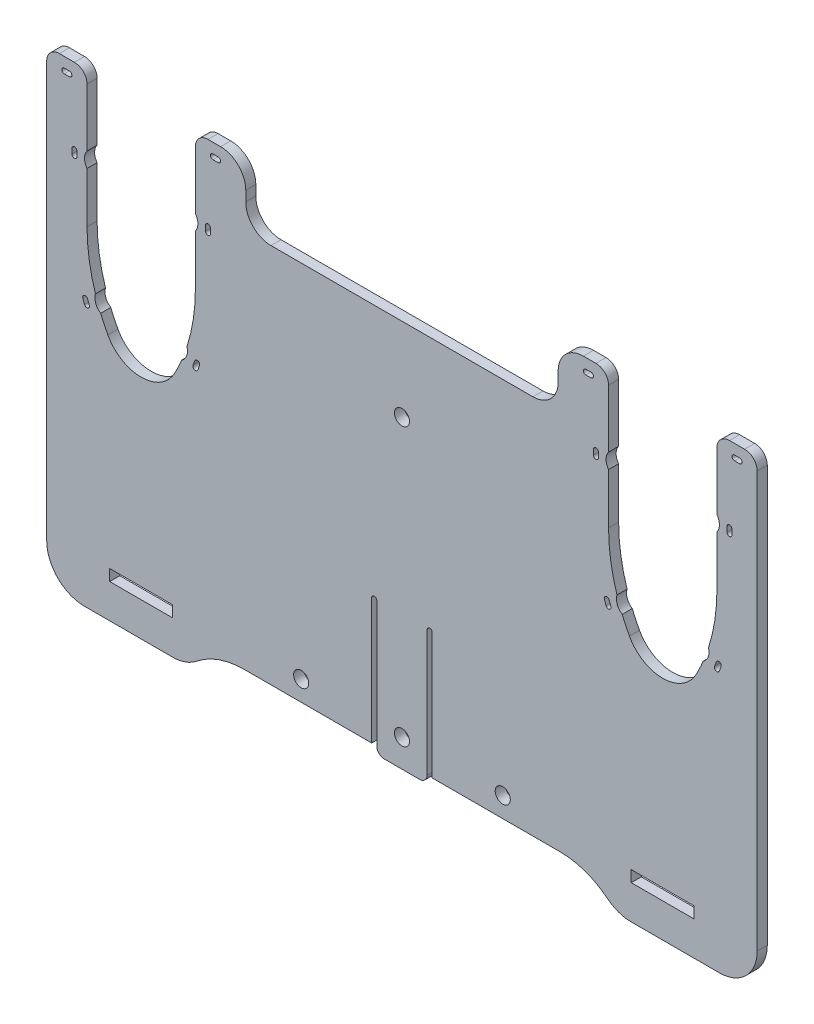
ISO-10303-21;
HEADER;
FILE_DESCRIPTION(('STEP AP214'),'2;1');
FILE_NAME('part.step','',(''),(''),'','','');
FILE_SCHEMA(('AUTOMOTIVE_DESIGN { 1 0 10303 214 1 1 1 1 }'));
ENDSEC;
DATA;
#1=APPLICATION_CONTEXT('core data for automotive mechanical design processes');
#2=APPLICATION_PROTOCOL_DEFINITION('international standard','automotive_design',2000,#1);
#3=PRODUCT_CONTEXT('',#1,'mechanical');
#4=PRODUCT('Part','Part','',(#3));
#5=PRODUCT_RELATED_PRODUCT_CATEGORY('part','',(#4));
#6=PRODUCT_DEFINITION_FORMATION('','',#4);
#7=PRODUCT_DEFINITION_CONTEXT('part definition',#1,'design');
#8=PRODUCT_DEFINITION('design','',#6,#7);
#9=PRODUCT_DEFINITION_SHAPE('','',#8);
#10=(LENGTH_UNIT() NAMED_UNIT(*) SI_UNIT(.MILLI.,.METRE.));
#11=(NAMED_UNIT(*) PLANE_ANGLE_UNIT() SI_UNIT($,.RADIAN.));
#12=(NAMED_UNIT(*) SI_UNIT($,.STERADIAN.) SOLID_ANGLE_UNIT());
#13=UNCERTAINTY_MEASURE_WITH_UNIT(LENGTH_MEASURE(1.E-05),#10,'distance_accuracy_value','');
#14=(GEOMETRIC_REPRESENTATION_CONTEXT(3) GLOBAL_UNCERTAINTY_ASSIGNED_CONTEXT((#13)) GLOBAL_UNIT_ASSIGNED_CONTEXT((#10,
#11,#12)) REPRESENTATION_CONTEXT('',''));
#15=CARTESIAN_POINT('',(0.,0.,0.));
#16=DIRECTION('',(0.,0.,1.));
#17=DIRECTION('',(1.,0.,0.));
#18=AXIS2_PLACEMENT_3D('',#15,#16,#17);
#19=CARTESIAN_POINT('',(130.,170.,4.));
#20=DIRECTION('',(0.,0.,1.));
#21=DIRECTION('',(1.,0.,0.));
#22=AXIS2_PLACEMENT_3D('',#19,#20,#21);
#23=PLANE('',#22);
#24=CARTESIAN_POINT('',(0.,118.,4.));
#25=DIRECTION('',(0.,0.,-1.));
#26=DIRECTION('',(1.,0.,0.));
#27=AXIS2_PLACEMENT_3D('',#24,#25,#26);
#28=CIRCLE('',#27,3.);
#29=CARTESIAN_POINT('',(3.,118.,4.));
#30=VERTEX_POINT('',#29);
#31=EDGE_CURVE('E1552',#30,#30,#28,.T.);
#32=ORIENTED_EDGE('',*,*,#31,.T.);
#33=EDGE_LOOP('',(#32));
#34=FACE_BOUND('',#33,.T.);
#35=CARTESIAN_POINT('',(0.,7.99999999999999,4.));
#36=DIRECTION('',(0.,0.,-1.));
#37=DIRECTION('',(1.,0.,0.));
#38=AXIS2_PLACEMENT_3D('',#35,#36,#37);
#39=CIRCLE('',#38,3.);
#40=CARTESIAN_POINT('',(3.,7.99999999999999,4.));
#41=VERTEX_POINT('',#40);
#42=EDGE_CURVE('E1555',#41,#41,#39,.T.);
#43=ORIENTED_EDGE('',*,*,#42,.T.);
#44=EDGE_LOOP('',(#43));
#45=FACE_BOUND('',#44,.T.);
#46=DIRECTION('',(1.,0.,0.));
#47=VECTOR('',#46,1.);
#48=CARTESIAN_POINT('',(132.,169.,4.));
#49=LINE('',#48,#47);
#50=CARTESIAN_POINT('',(132.,169.,4.));
#51=VERTEX_POINT('',#50);
#52=CARTESIAN_POINT('',(134.,169.,4.));
#53=VERTEX_POINT('',#52);
#54=EDGE_CURVE('E1320',#51,#53,#49,.T.);
#55=ORIENTED_EDGE('',*,*,#54,.F.);
#56=CARTESIAN_POINT('',(132.,170.,4.));
#57=DIRECTION('',(0.,0.,1.));
#58=DIRECTION('',(1.,0.,0.));
#59=AXIS2_PLACEMENT_3D('',#56,#57,#58);
#60=CIRCLE('',#59,0.999999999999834);
#61=CARTESIAN_POINT('',(132.,171.,4.));
#62=VERTEX_POINT('',#61);
#63=EDGE_CURVE('E1318',#62,#51,#60,.T.);
#64=ORIENTED_EDGE('',*,*,#63,.F.);
#65=DIRECTION('',(-1.,0.,0.));
#66=VECTOR('',#65,1.);
#67=CARTESIAN_POINT('',(132.,171.,4.));
#68=LINE('',#67,#66);
#69=CARTESIAN_POINT('',(134.,171.,4.));
#70=VERTEX_POINT('',#69);
#71=EDGE_CURVE('E1326',#70,#62,#68,.T.);
#72=ORIENTED_EDGE('',*,*,#71,.F.);
#73=CARTESIAN_POINT('',(134.,170.,4.));
#74=DIRECTION('',(0.,0.,1.));
#75=DIRECTION('',(1.,0.,0.));
#76=AXIS2_PLACEMENT_3D('',#73,#74,#75);
#77=CIRCLE('',#76,0.999999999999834);
#78=EDGE_CURVE('E1323',#53,#70,#77,.T.);
#79=ORIENTED_EDGE('',*,*,#78,.F.);
#80=EDGE_LOOP('',(#55,#64,#72,#79));
#81=FACE_BOUND('',#80,.T.);
#82=DIRECTION('',(0.345832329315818,0.93829632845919,0.));
#83=VECTOR('',#82,1.);
#84=CARTESIAN_POINT('',(125.964688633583,93.715871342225,4.));
#85=LINE('',#84,#83);
#86=CARTESIAN_POINT('',(125.964688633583,93.715871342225,4.));
#87=VERTEX_POINT('',#86);
#88=CARTESIAN_POINT('',(126.656353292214,95.5924639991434,4.));
#89=VERTEX_POINT('',#88);
#90=EDGE_CURVE('E1382',#87,#89,#85,.T.);
#91=ORIENTED_EDGE('',*,*,#90,.F.);
#92=CARTESIAN_POINT('',(125.026392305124,94.0617036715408,4.));
#93=DIRECTION('',(0.,0.,1.));
#94=DIRECTION('',(1.,0.,0.));
#95=AXIS2_PLACEMENT_3D('',#92,#93,#94);
#96=CIRCLE('',#95,0.999999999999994);
#97=CARTESIAN_POINT('',(124.088095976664,94.4075360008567,4.));
#98=VERTEX_POINT('',#97);
#99=EDGE_CURVE('E1380',#98,#87,#96,.T.);
#100=ORIENTED_EDGE('',*,*,#99,.F.);
#101=DIRECTION('',(-0.34583232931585,-0.938296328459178,0.));
#102=VECTOR('',#101,1.);
#103=CARTESIAN_POINT('',(124.088095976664,94.4075360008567,4.));
#104=LINE('',#103,#102);
#105=CARTESIAN_POINT('',(124.779760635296,96.284128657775,4.));
#106=VERTEX_POINT('',#105);
#107=EDGE_CURVE('E1388',#106,#98,#104,.T.);
#108=ORIENTED_EDGE('',*,*,#107,.F.);
#109=CARTESIAN_POINT('',(125.718056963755,95.9382963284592,4.));
#110=DIRECTION('',(0.,0.,1.));
#111=DIRECTION('',(1.,0.,0.));
#112=AXIS2_PLACEMENT_3D('',#109,#110,#111);
#113=CIRCLE('',#112,0.999999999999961);
#114=EDGE_CURVE('E1385',#89,#106,#113,.T.);
#115=ORIENTED_EDGE('',*,*,#114,.F.);
#116=EDGE_LOOP('',(#91,#100,#108,#115));
#117=FACE_BOUND('',#116,.T.);
#118=DIRECTION('',(0.,1.,0.));
#119=VECTOR('',#118,1.);
#120=CARTESIAN_POINT('',(78.,143.,4.));
#121=LINE('',#120,#119);
#122=CARTESIAN_POINT('',(78.,143.,4.));
#123=VERTEX_POINT('',#122);
#124=CARTESIAN_POINT('',(78.,145.,4.));
#125=VERTEX_POINT('',#124);
#126=EDGE_CURVE('E1444',#123,#125,#121,.T.);
#127=ORIENTED_EDGE('',*,*,#126,.F.);
#128=CARTESIAN_POINT('',(77.,143.,4.));
#129=DIRECTION('',(0.,0.,1.));
#130=DIRECTION('',(1.,0.,0.));
#131=AXIS2_PLACEMENT_3D('',#128,#129,#130);
#132=CIRCLE('',#131,0.999999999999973);
#133=CARTESIAN_POINT('',(76.,143.,4.));
#134=VERTEX_POINT('',#133);
#135=EDGE_CURVE('E1442',#134,#123,#132,.T.);
#136=ORIENTED_EDGE('',*,*,#135,.F.);
#137=DIRECTION('',(0.,-1.,0.));
#138=VECTOR('',#137,1.);
#139=CARTESIAN_POINT('',(76.,143.,4.));
#140=LINE('',#139,#138);
#141=CARTESIAN_POINT('',(76.,145.,4.));
#142=VERTEX_POINT('',#141);
#143=EDGE_CURVE('E1450',#142,#134,#140,.T.);
#144=ORIENTED_EDGE('',*,*,#143,.F.);
#145=CARTESIAN_POINT('',(77.,145.,4.));
#146=DIRECTION('',(0.,0.,1.));
#147=DIRECTION('',(1.,0.,0.));
#148=AXIS2_PLACEMENT_3D('',#145,#146,#147);
#149=CIRCLE('',#148,0.999999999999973);
#150=EDGE_CURVE('E1447',#125,#142,#149,.T.);
#151=ORIENTED_EDGE('',*,*,#150,.F.);
#152=EDGE_LOOP('',(#127,#136,#144,#151));
#153=FACE_BOUND('',#152,.T.);
#154=CARTESIAN_POINT('',(40.,7.99999999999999,4.));
#155=DIRECTION('',(0.,0.,1.));
#156=DIRECTION('',(1.,0.,0.));
#157=AXIS2_PLACEMENT_3D('',#154,#155,#156);
#158=CIRCLE('',#157,3.);
#159=CARTESIAN_POINT('',(43.,7.99999999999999,4.));
#160=VERTEX_POINT('',#159);
#161=EDGE_CURVE('E1504',#160,#160,#158,.T.);
#162=ORIENTED_EDGE('',*,*,#161,.F.);
#163=EDGE_LOOP('',(#162));
#164=FACE_BOUND('',#163,.T.);
#165=CARTESIAN_POINT('',(130.,170.,4.));
#166=DIRECTION('',(0.,0.,1.));
#167=DIRECTION('',(1.,0.,0.));
#168=AXIS2_PLACEMENT_3D('',#165,#166,#167);
#169=CIRCLE('',#168,4.99999999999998);
#170=CARTESIAN_POINT('',(130.,175.,4.));
#171=VERTEX_POINT('',#170);
#172=CARTESIAN_POINT('',(125.,170.,4.));
#173=VERTEX_POINT('',#172);
#174=EDGE_CURVE('E1510',#171,#173,#169,.T.);
#175=ORIENTED_EDGE('',*,*,#174,.T.);
#176=DIRECTION('',(0.,-1.,0.));
#177=VECTOR('',#176,1.);
#178=CARTESIAN_POINT('',(125.,170.,4.));
#179=LINE('',#178,#177);
#180=CARTESIAN_POINT('',(125.,147.,4.));
#181=VERTEX_POINT('',#180);
#182=EDGE_CURVE('E1513',#173,#181,#179,.T.);
#183=ORIENTED_EDGE('',*,*,#182,.T.);
#184=CARTESIAN_POINT('',(121.,144.,4.));
#185=DIRECTION('',(0.,0.,-1.));
#186=DIRECTION('',(1.,0.,0.));
#187=AXIS2_PLACEMENT_3D('',#184,#185,#186);
#188=CIRCLE('',#187,5.00000000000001);
#189=CARTESIAN_POINT('',(125.,141.,4.));
#190=VERTEX_POINT('',#189);
#191=EDGE_CURVE('E1516',#181,#190,#188,.T.);
#192=ORIENTED_EDGE('',*,*,#191,.T.);
#193=DIRECTION('',(0.,-1.,0.));
#194=VECTOR('',#193,1.);
#195=CARTESIAN_POINT('',(125.,141.,4.));
#196=LINE('',#195,#194);
#197=CARTESIAN_POINT('',(125.,120.937424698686,4.));
#198=VERTEX_POINT('',#197);
#199=EDGE_CURVE('E1518',#190,#198,#196,.T.);
#200=ORIENTED_EDGE('',*,*,#199,.T.);
#201=CARTESIAN_POINT('',(55.,120.937424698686,4.));
#202=DIRECTION('',(0.,0.,-1.));
#203=DIRECTION('',(1.,0.,0.));
#204=AXIS2_PLACEMENT_3D('',#201,#202,#203);
#205=CIRCLE('',#204,70.);
#206=CARTESIAN_POINT('',(121.657893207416,99.5662929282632,4.));
#207=VERTEX_POINT('',#206);
#208=EDGE_CURVE('E1520',#198,#207,#205,.T.);
#209=ORIENTED_EDGE('',*,*,#208,.T.);
#210=CARTESIAN_POINT('',(116.867210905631,98.1347332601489,4.));
#211=DIRECTION('',(0.,0.,-1.));
#212=DIRECTION('',(1.,0.,0.));
#213=AXIS2_PLACEMENT_3D('',#210,#211,#212);
#214=CIRCLE('',#213,5.00000000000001);
#215=CARTESIAN_POINT('',(119.582899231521,93.9365149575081,4.));
#216=VERTEX_POINT('',#215);
#217=EDGE_CURVE('E1522',#207,#216,#214,.T.);
#218=ORIENTED_EDGE('',*,*,#217,.T.);
#219=CARTESIAN_POINT('',(55.,120.937424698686,4.));
#220=DIRECTION('',(0.,0.,-1.));
#221=DIRECTION('',(1.,0.,0.));
#222=AXIS2_PLACEMENT_3D('',#219,#220,#221);
#223=CIRCLE('',#222,70.);
#224=CARTESIAN_POINT('',(116.727272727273,87.9261569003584,4.));
#225=VERTEX_POINT('',#224);
#226=EDGE_CURVE('E1524',#216,#225,#223,.T.);
#227=ORIENTED_EDGE('',*,*,#226,.T.);
#228=CARTESIAN_POINT('',(103.5,95.,4.));
#229=DIRECTION('',(0.,0.,-1.));
#230=DIRECTION('',(-1.,0.,0.));
#231=AXIS2_PLACEMENT_3D('',#228,#229,#230);
#232=CIRCLE('',#231,15.);
#233=CARTESIAN_POINT('',(90.2727272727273,87.9261569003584,4.));
#234=VERTEX_POINT('',#233);
#235=EDGE_CURVE('E1526',#225,#234,#232,.T.);
#236=ORIENTED_EDGE('',*,*,#235,.T.);
#237=CARTESIAN_POINT('',(152.,120.937424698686,4.));
#238=DIRECTION('',(0.,0.,-1.));
#239=DIRECTION('',(-1.,0.,0.));
#240=AXIS2_PLACEMENT_3D('',#237,#238,#239);
#241=CIRCLE('',#240,70.);
#242=CARTESIAN_POINT('',(87.4171007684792,93.9365149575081,4.));
#243=VERTEX_POINT('',#242);
#244=EDGE_CURVE('E1528',#234,#243,#241,.T.);
#245=ORIENTED_EDGE('',*,*,#244,.T.);
#246=CARTESIAN_POINT('',(90.1327890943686,98.1347332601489,4.));
#247=DIRECTION('',(0.,0.,-1.));
#248=DIRECTION('',(1.,0.,0.));
#249=AXIS2_PLACEMENT_3D('',#246,#247,#248);
#250=CIRCLE('',#249,4.99999999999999);
#251=CARTESIAN_POINT('',(85.3421067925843,99.5662929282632,4.));
#252=VERTEX_POINT('',#251);
#253=EDGE_CURVE('E1530',#243,#252,#250,.T.);
#254=ORIENTED_EDGE('',*,*,#253,.T.);
#255=CARTESIAN_POINT('',(152.,120.937424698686,4.));
#256=DIRECTION('',(0.,0.,-1.));
#257=DIRECTION('',(-1.,0.,0.));
#258=AXIS2_PLACEMENT_3D('',#255,#256,#257);
#259=CIRCLE('',#258,70.);
#260=CARTESIAN_POINT('',(82.,120.937424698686,4.));
#261=VERTEX_POINT('',#260);
#262=EDGE_CURVE('E1532',#252,#261,#259,.T.);
#263=ORIENTED_EDGE('',*,*,#262,.T.);
#264=DIRECTION('',(0.,1.,0.));
#265=VECTOR('',#264,1.);
#266=CARTESIAN_POINT('',(82.,141.,4.));
#267=LINE('',#266,#265);
#268=CARTESIAN_POINT('',(82.,141.,4.));
#269=VERTEX_POINT('',#268);
#270=EDGE_CURVE('E1534',#261,#269,#267,.T.);
#271=ORIENTED_EDGE('',*,*,#270,.T.);
#272=CARTESIAN_POINT('',(86.,144.,4.));
#273=DIRECTION('',(0.,0.,-1.));
#274=DIRECTION('',(1.,0.,0.));
#275=AXIS2_PLACEMENT_3D('',#272,#273,#274);
#276=CIRCLE('',#275,5.00000000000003);
#277=CARTESIAN_POINT('',(82.,147.,4.));
#278=VERTEX_POINT('',#277);
#279=EDGE_CURVE('E1536',#269,#278,#276,.T.);
#280=ORIENTED_EDGE('',*,*,#279,.T.);
#281=DIRECTION('',(0.,1.,0.));
#282=VECTOR('',#281,1.);
#283=CARTESIAN_POINT('',(82.,170.,4.));
#284=LINE('',#283,#282);
#285=CARTESIAN_POINT('',(82.,170.,4.));
#286=VERTEX_POINT('',#285);
#287=EDGE_CURVE('E1538',#278,#286,#284,.T.);
#288=ORIENTED_EDGE('',*,*,#287,.T.);
#289=CARTESIAN_POINT('',(77.,170.,4.));
#290=DIRECTION('',(0.,0.,1.));
#291=DIRECTION('',(-1.,0.,0.));
#292=AXIS2_PLACEMENT_3D('',#289,#290,#291);
#293=CIRCLE('',#292,4.99999999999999);
#294=CARTESIAN_POINT('',(77.,175.,4.));
#295=VERTEX_POINT('',#294);
#296=EDGE_CURVE('E1540',#286,#295,#293,.T.);
#297=ORIENTED_EDGE('',*,*,#296,.T.);
#298=DIRECTION('',(-1.,0.,0.));
#299=VECTOR('',#298,1.);
#300=CARTESIAN_POINT('',(72.,175.,4.));
#301=LINE('',#300,#299);
#302=CARTESIAN_POINT('',(72.,175.,4.));
#303=VERTEX_POINT('',#302);
#304=EDGE_CURVE('E1542',#295,#303,#301,.T.);
#305=ORIENTED_EDGE('',*,*,#304,.T.);
#306=CARTESIAN_POINT('',(72.,165.,4.));
#307=DIRECTION('',(0.,0.,1.));
#308=DIRECTION('',(1.,0.,0.));
#309=AXIS2_PLACEMENT_3D('',#306,#307,#308);
#310=CIRCLE('',#309,10.);
#311=CARTESIAN_POINT('',(62.,165.,4.));
#312=VERTEX_POINT('',#311);
#313=EDGE_CURVE('E1544',#303,#312,#310,.T.);
#314=ORIENTED_EDGE('',*,*,#313,.T.);
#315=DIRECTION('',(0.,-1.,0.));
#316=VECTOR('',#315,1.);
#317=CARTESIAN_POINT('',(62.,161.,4.));
#318=LINE('',#317,#316);
#319=CARTESIAN_POINT('',(62.,161.,4.));
#320=VERTEX_POINT('',#319);
#321=EDGE_CURVE('E1546',#312,#320,#318,.T.);
#322=ORIENTED_EDGE('',*,*,#321,.T.);
#323=CARTESIAN_POINT('',(52.,161.,4.));
#324=DIRECTION('',(0.,0.,-1.));
#325=DIRECTION('',(1.,0.,0.));
#326=AXIS2_PLACEMENT_3D('',#323,#324,#325);
#327=CIRCLE('',#326,10.);
#328=CARTESIAN_POINT('',(52.,151.,4.));
#329=VERTEX_POINT('',#328);
#330=EDGE_CURVE('E1548',#320,#329,#327,.T.);
#331=ORIENTED_EDGE('',*,*,#330,.T.);
#332=DIRECTION('',(-1.,0.,0.));
#333=VECTOR('',#332,1.);
#334=CARTESIAN_POINT('',(0.,151.,4.));
#335=LINE('',#334,#333);
#336=CARTESIAN_POINT('',(-52.,151.,4.));
#337=VERTEX_POINT('',#336);
#338=EDGE_CURVE('E1550',#329,#337,#335,.T.);
#339=ORIENTED_EDGE('',*,*,#338,.T.);
#340=CARTESIAN_POINT('',(-52.,161.,4.));
#341=DIRECTION('',(0.,0.,1.));
#342=DIRECTION('',(-1.,0.,0.));
#343=AXIS2_PLACEMENT_3D('',#340,#341,#342);
#344=CIRCLE('',#343,10.);
#345=CARTESIAN_POINT('',(-62.,161.,4.));
#346=VERTEX_POINT('',#345);
#347=EDGE_CURVE('E1074',#346,#337,#344,.T.);
#348=ORIENTED_EDGE('',*,*,#347,.F.);
#349=DIRECTION('',(0.,-1.,0.));
#350=VECTOR('',#349,1.);
#351=CARTESIAN_POINT('',(-62.,161.,4.));
#352=LINE('',#351,#350);
#353=CARTESIAN_POINT('',(-62.,165.,4.));
#354=VERTEX_POINT('',#353);
#355=EDGE_CURVE('E1077',#354,#346,#352,.T.);
#356=ORIENTED_EDGE('',*,*,#355,.F.);
#357=CARTESIAN_POINT('',(-72.,165.,4.));
#358=DIRECTION('',(0.,0.,-1.));
#359=DIRECTION('',(-1.,0.,0.));
#360=AXIS2_PLACEMENT_3D('',#357,#358,#359);
#361=CIRCLE('',#360,10.);
#362=CARTESIAN_POINT('',(-72.,175.,4.));
#363=VERTEX_POINT('',#362);
#364=EDGE_CURVE('E1080',#363,#354,#361,.T.);
#365=ORIENTED_EDGE('',*,*,#364,.F.);
#366=DIRECTION('',(1.,0.,0.));
#367=VECTOR('',#366,1.);
#368=CARTESIAN_POINT('',(-72.,175.,4.));
#369=LINE('',#368,#367);
#370=CARTESIAN_POINT('',(-77.,175.,4.));
#371=VERTEX_POINT('',#370);
#372=EDGE_CURVE('E1083',#371,#363,#369,.T.);
#373=ORIENTED_EDGE('',*,*,#372,.F.);
#374=CARTESIAN_POINT('',(-77.,170.,4.));
#375=DIRECTION('',(0.,0.,-1.));
#376=DIRECTION('',(1.,0.,0.));
#377=AXIS2_PLACEMENT_3D('',#374,#375,#376);
#378=CIRCLE('',#377,4.99999999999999);
#379=CARTESIAN_POINT('',(-82.,170.,4.));
#380=VERTEX_POINT('',#379);
#381=EDGE_CURVE('E1086',#380,#371,#378,.T.);
#382=ORIENTED_EDGE('',*,*,#381,.F.);
#383=DIRECTION('',(0.,1.,0.));
#384=VECTOR('',#383,1.);
#385=CARTESIAN_POINT('',(-82.,170.,4.));
#386=LINE('',#385,#384);
#387=CARTESIAN_POINT('',(-82.,147.,4.));
#388=VERTEX_POINT('',#387);
#389=EDGE_CURVE('E1089',#388,#380,#386,.T.);
#390=ORIENTED_EDGE('',*,*,#389,.F.);
#391=CARTESIAN_POINT('',(-86.,144.,4.));
#392=DIRECTION('',(0.,0.,1.));
#393=DIRECTION('',(-1.,0.,0.));
#394=AXIS2_PLACEMENT_3D('',#391,#392,#393);
#395=CIRCLE('',#394,5.00000000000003);
#396=CARTESIAN_POINT('',(-82.,141.,4.));
#397=VERTEX_POINT('',#396);
#398=EDGE_CURVE('E1092',#397,#388,#395,.T.);
#399=ORIENTED_EDGE('',*,*,#398,.F.);
#400=DIRECTION('',(0.,1.,0.));
#401=VECTOR('',#400,1.);
#402=CARTESIAN_POINT('',(-82.,141.,4.));
#403=LINE('',#402,#401);
#404=CARTESIAN_POINT('',(-82.,120.937424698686,4.));
#405=VERTEX_POINT('',#404);
#406=EDGE_CURVE('E1095',#405,#397,#403,.T.);
#407=ORIENTED_EDGE('',*,*,#406,.F.);
#408=CARTESIAN_POINT('',(-152.,120.937424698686,4.));
#409=DIRECTION('',(0.,0.,1.));
#410=DIRECTION('',(1.,0.,0.));
#411=AXIS2_PLACEMENT_3D('',#408,#409,#410);
#412=CIRCLE('',#411,70.);
#413=CARTESIAN_POINT('',(-85.3421067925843,99.5662929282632,4.));
#414=VERTEX_POINT('',#413);
#415=EDGE_CURVE('E1098',#414,#405,#412,.T.);
#416=ORIENTED_EDGE('',*,*,#415,.F.);
#417=CARTESIAN_POINT('',(-90.1327890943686,98.1347332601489,4.));
#418=DIRECTION('',(0.,0.,1.));
#419=DIRECTION('',(-1.,0.,0.));
#420=AXIS2_PLACEMENT_3D('',#417,#418,#419);
#421=CIRCLE('',#420,4.99999999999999);
#422=CARTESIAN_POINT('',(-87.4171007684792,93.9365149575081,4.));
#423=VERTEX_POINT('',#422);
#424=EDGE_CURVE('E1101',#423,#414,#421,.T.);
#425=ORIENTED_EDGE('',*,*,#424,.F.);
#426=CARTESIAN_POINT('',(-152.,120.937424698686,4.));
#427=DIRECTION('',(0.,0.,1.));
#428=DIRECTION('',(1.,0.,0.));
#429=AXIS2_PLACEMENT_3D('',#426,#427,#428);
#430=CIRCLE('',#429,70.);
#431=CARTESIAN_POINT('',(-90.2727272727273,87.9261569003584,4.));
#432=VERTEX_POINT('',#431);
#433=EDGE_CURVE('E1104',#432,#423,#430,.T.);
#434=ORIENTED_EDGE('',*,*,#433,.F.);
#435=CARTESIAN_POINT('',(-103.5,95.,4.));
#436=DIRECTION('',(0.,0.,1.));
#437=DIRECTION('',(1.,0.,0.));
#438=AXIS2_PLACEMENT_3D('',#435,#436,#437);
#439=CIRCLE('',#438,15.);
#440=CARTESIAN_POINT('',(-116.727272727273,87.9261569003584,4.));
#441=VERTEX_POINT('',#440);
#442=EDGE_CURVE('E1107',#441,#432,#439,.T.);
#443=ORIENTED_EDGE('',*,*,#442,.F.);
#444=CARTESIAN_POINT('',(-55.,120.937424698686,4.));
#445=DIRECTION('',(0.,0.,1.));
#446=DIRECTION('',(-1.,0.,0.));
#447=AXIS2_PLACEMENT_3D('',#444,#445,#446);
#448=CIRCLE('',#447,70.);
#449=CARTESIAN_POINT('',(-119.582899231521,93.9365149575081,4.));
#450=VERTEX_POINT('',#449);
#451=EDGE_CURVE('E1110',#450,#441,#448,.T.);
#452=ORIENTED_EDGE('',*,*,#451,.F.);
#453=CARTESIAN_POINT('',(-116.867210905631,98.1347332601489,4.));
#454=DIRECTION('',(0.,0.,1.));
#455=DIRECTION('',(-1.,0.,0.));
#456=AXIS2_PLACEMENT_3D('',#453,#454,#455);
#457=CIRCLE('',#456,5.00000000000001);
#458=CARTESIAN_POINT('',(-121.657893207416,99.5662929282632,4.));
#459=VERTEX_POINT('',#458);
#460=EDGE_CURVE('E1113',#459,#450,#457,.T.);
#461=ORIENTED_EDGE('',*,*,#460,.F.);
#462=CARTESIAN_POINT('',(-55.,120.937424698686,4.));
#463=DIRECTION('',(0.,0.,1.));
#464=DIRECTION('',(-1.,0.,0.));
#465=AXIS2_PLACEMENT_3D('',#462,#463,#464);
#466=CIRCLE('',#465,70.);
#467=CARTESIAN_POINT('',(-125.,120.937424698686,4.));
#468=VERTEX_POINT('',#467);
#469=EDGE_CURVE('E1116',#468,#459,#466,.T.);
#470=ORIENTED_EDGE('',*,*,#469,.F.);
#471=DIRECTION('',(0.,-1.,0.));
#472=VECTOR('',#471,1.);
#473=CARTESIAN_POINT('',(-125.,141.,4.));
#474=LINE('',#473,#472);
#475=CARTESIAN_POINT('',(-125.,141.,4.));
#476=VERTEX_POINT('',#475);
#477=EDGE_CURVE('E1119',#476,#468,#474,.T.);
#478=ORIENTED_EDGE('',*,*,#477,.F.);
#479=CARTESIAN_POINT('',(-121.,144.,4.));
#480=DIRECTION('',(0.,0.,1.));
#481=DIRECTION('',(-1.,0.,0.));
#482=AXIS2_PLACEMENT_3D('',#479,#480,#481);
#483=CIRCLE('',#482,5.00000000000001);
#484=CARTESIAN_POINT('',(-125.,147.,4.));
#485=VERTEX_POINT('',#484);
#486=EDGE_CURVE('E1122',#485,#476,#483,.T.);
#487=ORIENTED_EDGE('',*,*,#486,.F.);
#488=DIRECTION('',(0.,-1.,0.));
#489=VECTOR('',#488,1.);
#490=CARTESIAN_POINT('',(-125.,170.,4.));
#491=LINE('',#490,#489);
#492=CARTESIAN_POINT('',(-125.,170.,4.));
#493=VERTEX_POINT('',#492);
#494=EDGE_CURVE('E1125',#493,#485,#491,.T.);
#495=ORIENTED_EDGE('',*,*,#494,.F.);
#496=CARTESIAN_POINT('',(-130.,170.,4.));
#497=DIRECTION('',(0.,0.,-1.));
#498=DIRECTION('',(-1.,0.,0.));
#499=AXIS2_PLACEMENT_3D('',#496,#497,#498);
#500=CIRCLE('',#499,4.99999999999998);
#501=CARTESIAN_POINT('',(-130.,175.,4.));
#502=VERTEX_POINT('',#501);
#503=EDGE_CURVE('E1030',#502,#493,#500,.T.);
#504=ORIENTED_EDGE('',*,*,#503,.F.);
#505=DIRECTION('',(1.,0.,0.));
#506=VECTOR('',#505,1.);
#507=CARTESIAN_POINT('',(-130.,175.,4.));
#508=LINE('',#507,#506);
#509=CARTESIAN_POINT('',(-136.,175.,4.));
#510=VERTEX_POINT('',#509);
#511=EDGE_CURVE('E1033',#510,#502,#508,.T.);
#512=ORIENTED_EDGE('',*,*,#511,.F.);
#513=CARTESIAN_POINT('',(-136.,170.,4.));
#514=DIRECTION('',(0.,0.,-1.));
#515=DIRECTION('',(-1.,0.,0.));
#516=AXIS2_PLACEMENT_3D('',#513,#514,#515);
#517=CIRCLE('',#516,5.);
#518=CARTESIAN_POINT('',(-141.,170.,4.));
#519=VERTEX_POINT('',#518);
#520=EDGE_CURVE('E1037',#519,#510,#517,.T.);
#521=ORIENTED_EDGE('',*,*,#520,.F.);
#522=DIRECTION('',(0.,1.,0.));
#523=VECTOR('',#522,1.);
#524=CARTESIAN_POINT('',(-141.,170.,4.));
#525=LINE('',#524,#523);
#526=CARTESIAN_POINT('',(-141.,5.00000000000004,4.));
#527=VERTEX_POINT('',#526);
#528=EDGE_CURVE('E1040',#527,#519,#525,.T.);
#529=ORIENTED_EDGE('',*,*,#528,.F.);
#530=CARTESIAN_POINT('',(-126.,5.00000000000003,4.));
#531=DIRECTION('',(0.,0.,-1.));
#532=DIRECTION('',(-1.,0.,0.));
#533=AXIS2_PLACEMENT_3D('',#530,#531,#532);
#534=CIRCLE('',#533,15.);
#535=CARTESIAN_POINT('',(-126.,-9.99999999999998,4.));
#536=VERTEX_POINT('',#535);
#537=EDGE_CURVE('E1043',#536,#527,#534,.T.);
#538=ORIENTED_EDGE('',*,*,#537,.F.);
#539=DIRECTION('',(-1.,0.,0.));
#540=VECTOR('',#539,1.);
#541=CARTESIAN_POINT('',(-91.,-9.99999999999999,4.));
#542=LINE('',#541,#540);
#543=CARTESIAN_POINT('',(-91.,-9.99999999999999,4.));
#544=VERTEX_POINT('',#543);
#545=EDGE_CURVE('E1046',#544,#536,#542,.T.);
#546=ORIENTED_EDGE('',*,*,#545,.F.);
#547=CARTESIAN_POINT('',(-91.,5.,4.));
#548=DIRECTION('',(0.,0.,-1.));
#549=DIRECTION('',(1.,0.,0.));
#550=AXIS2_PLACEMENT_3D('',#547,#548,#549);
#551=CIRCLE('',#550,15.);
#552=CARTESIAN_POINT('',(-81.5719095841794,-6.66666666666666,4.));
#553=VERTEX_POINT('',#552);
#554=EDGE_CURVE('E1049',#553,#544,#551,.T.);
#555=ORIENTED_EDGE('',*,*,#554,.F.);
#556=CARTESIAN_POINT('',(-62.7157287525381,-30.,4.));
#557=DIRECTION('',(0.,0.,1.));
#558=DIRECTION('',(-1.,0.,0.));
#559=AXIS2_PLACEMENT_3D('',#556,#557,#558);
#560=CIRCLE('',#559,30.);
#561=CARTESIAN_POINT('',(-62.7157287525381,0.,4.));
#562=VERTEX_POINT('',#561);
#563=EDGE_CURVE('E1052',#562,#553,#560,.T.);
#564=ORIENTED_EDGE('',*,*,#563,.F.);
#565=DIRECTION('',(-1.,0.,0.));
#566=VECTOR('',#565,1.);
#567=CARTESIAN_POINT('',(-12.,0.,4.));
#568=LINE('',#567,#566);
#569=CARTESIAN_POINT('',(-12.,0.,4.));
#570=VERTEX_POINT('',#569);
#571=EDGE_CURVE('E1055',#570,#562,#568,.T.);
#572=ORIENTED_EDGE('',*,*,#571,.F.);
#573=DIRECTION('',(0.,-1.,0.));
#574=VECTOR('',#573,1.);
#575=CARTESIAN_POINT('',(-12.,0.,4.));
#576=LINE('',#575,#574);
#577=CARTESIAN_POINT('',(-12.,50.,4.));
#578=VERTEX_POINT('',#577);
#579=EDGE_CURVE('E1059',#578,#570,#576,.T.);
#580=ORIENTED_EDGE('',*,*,#579,.F.);
#581=CARTESIAN_POINT('',(-11.,50.,4.));
#582=DIRECTION('',(0.,0.,1.));
#583=DIRECTION('',(1.,0.,0.));
#584=AXIS2_PLACEMENT_3D('',#581,#582,#583);
#585=CIRCLE('',#584,1.);
#586=CARTESIAN_POINT('',(-10.,50.,4.));
#587=VERTEX_POINT('',#586);
#588=EDGE_CURVE('E1063',#587,#578,#585,.T.);
#589=ORIENTED_EDGE('',*,*,#588,.F.);
#590=DIRECTION('',(0.,1.,0.));
#591=VECTOR('',#590,1.);
#592=CARTESIAN_POINT('',(-10.,0.,4.));
#593=LINE('',#592,#591);
#594=CARTESIAN_POINT('',(-10.,0.,4.));
#595=VERTEX_POINT('',#594);
#596=EDGE_CURVE('E1066',#595,#587,#593,.T.);
#597=ORIENTED_EDGE('',*,*,#596,.F.);
#598=CARTESIAN_POINT('',(-7.,0.,4.));
#599=DIRECTION('',(0.,0.,-1.));
#600=DIRECTION('',(1.,0.,0.));
#601=AXIS2_PLACEMENT_3D('',#598,#599,#600);
#602=CIRCLE('',#601,3.);
#603=CARTESIAN_POINT('',(-7.,-3.,4.));
#604=VERTEX_POINT('',#603);
#605=EDGE_CURVE('E1070',#604,#595,#602,.T.);
#606=ORIENTED_EDGE('',*,*,#605,.F.);
#607=DIRECTION('',(1.,0.,0.));
#608=VECTOR('',#607,1.);
#609=CARTESIAN_POINT('',(7.,-3.,4.));
#610=LINE('',#609,#608);
#611=CARTESIAN_POINT('',(7.,-3.,4.));
#612=VERTEX_POINT('',#611);
#613=EDGE_CURVE('E1559',#604,#612,#610,.T.);
#614=ORIENTED_EDGE('',*,*,#613,.T.);
#615=CARTESIAN_POINT('',(7.,0.,4.));
#616=DIRECTION('',(0.,0.,1.));
#617=DIRECTION('',(-1.,0.,0.));
#618=AXIS2_PLACEMENT_3D('',#615,#616,#617);
#619=CIRCLE('',#618,3.);
#620=CARTESIAN_POINT('',(10.,0.,4.));
#621=VERTEX_POINT('',#620);
#622=EDGE_CURVE('E1562',#612,#621,#619,.T.);
#623=ORIENTED_EDGE('',*,*,#622,.T.);
#624=DIRECTION('',(0.,1.,0.));
#625=VECTOR('',#624,1.);
#626=CARTESIAN_POINT('',(10.,0.,4.));
#627=LINE('',#626,#625);
#628=CARTESIAN_POINT('',(10.,50.,4.));
#629=VERTEX_POINT('',#628);
#630=EDGE_CURVE('E1565',#621,#629,#627,.T.);
#631=ORIENTED_EDGE('',*,*,#630,.T.);
#632=CARTESIAN_POINT('',(11.,50.,4.));
#633=DIRECTION('',(0.,0.,-1.));
#634=DIRECTION('',(-1.,0.,0.));
#635=AXIS2_PLACEMENT_3D('',#632,#633,#634);
#636=CIRCLE('',#635,1.);
#637=CARTESIAN_POINT('',(12.,50.,4.));
#638=VERTEX_POINT('',#637);
#639=EDGE_CURVE('E1568',#629,#638,#636,.T.);
#640=ORIENTED_EDGE('',*,*,#639,.T.);
#641=DIRECTION('',(0.,-1.,0.));
#642=VECTOR('',#641,1.);
#643=CARTESIAN_POINT('',(12.,0.,4.));
#644=LINE('',#643,#642);
#645=CARTESIAN_POINT('',(12.,0.,4.));
#646=VERTEX_POINT('',#645);
#647=EDGE_CURVE('E1570',#638,#646,#644,.T.);
#648=ORIENTED_EDGE('',*,*,#647,.T.);
#649=DIRECTION('',(1.,0.,0.));
#650=VECTOR('',#649,1.);
#651=CARTESIAN_POINT('',(12.,0.,4.));
#652=LINE('',#651,#650);
#653=CARTESIAN_POINT('',(62.7157287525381,0.,4.));
#654=VERTEX_POINT('',#653);
#655=EDGE_CURVE('E1573',#646,#654,#652,.T.);
#656=ORIENTED_EDGE('',*,*,#655,.T.);
#657=CARTESIAN_POINT('',(62.7157287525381,-30.,4.));
#658=DIRECTION('',(0.,0.,-1.));
#659=DIRECTION('',(1.,0.,0.));
#660=AXIS2_PLACEMENT_3D('',#657,#658,#659);
#661=CIRCLE('',#660,30.);
#662=CARTESIAN_POINT('',(81.5719095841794,-6.66666666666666,4.));
#663=VERTEX_POINT('',#662);
#664=EDGE_CURVE('E1576',#654,#663,#661,.T.);
#665=ORIENTED_EDGE('',*,*,#664,.T.);
#666=CARTESIAN_POINT('',(91.,5.,4.));
#667=DIRECTION('',(0.,0.,1.));
#668=DIRECTION('',(-1.,0.,0.));
#669=AXIS2_PLACEMENT_3D('',#666,#667,#668);
#670=CIRCLE('',#669,15.);
#671=CARTESIAN_POINT('',(91.,-9.99999999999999,4.));
#672=VERTEX_POINT('',#671);
#673=EDGE_CURVE('E1578',#663,#672,#670,.T.);
#674=ORIENTED_EDGE('',*,*,#673,.T.);
#675=DIRECTION('',(1.,0.,0.));
#676=VECTOR('',#675,1.);
#677=CARTESIAN_POINT('',(91.,-9.99999999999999,4.));
#678=LINE('',#677,#676);
#679=CARTESIAN_POINT('',(126.,-9.99999999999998,4.));
#680=VERTEX_POINT('',#679);
#681=EDGE_CURVE('E1580',#672,#680,#678,.T.);
#682=ORIENTED_EDGE('',*,*,#681,.T.);
#683=CARTESIAN_POINT('',(126.,5.00000000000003,4.));
#684=DIRECTION('',(0.,0.,1.));
#685=DIRECTION('',(1.,0.,0.));
#686=AXIS2_PLACEMENT_3D('',#683,#684,#685);
#687=CIRCLE('',#686,15.);
#688=CARTESIAN_POINT('',(141.,5.00000000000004,4.));
#689=VERTEX_POINT('',#688);
#690=EDGE_CURVE('E1582',#680,#689,#687,.T.);
#691=ORIENTED_EDGE('',*,*,#690,.T.);
#692=DIRECTION('',(0.,1.,0.));
#693=VECTOR('',#692,1.);
#694=CARTESIAN_POINT('',(141.,170.,4.));
#695=LINE('',#694,#693);
#696=CARTESIAN_POINT('',(141.,170.,4.));
#697=VERTEX_POINT('',#696);
#698=EDGE_CURVE('E1584',#689,#697,#695,.T.);
#699=ORIENTED_EDGE('',*,*,#698,.T.);
#700=CARTESIAN_POINT('',(136.,170.,4.));
#701=DIRECTION('',(0.,0.,1.));
#702=DIRECTION('',(1.,0.,0.));
#703=AXIS2_PLACEMENT_3D('',#700,#701,#702);
#704=CIRCLE('',#703,5.);
#705=CARTESIAN_POINT('',(136.,175.,4.));
#706=VERTEX_POINT('',#705);
#707=EDGE_CURVE('E1586',#697,#706,#704,.T.);
#708=ORIENTED_EDGE('',*,*,#707,.T.);
#709=DIRECTION('',(-1.,0.,0.));
#710=VECTOR('',#709,1.);
#711=CARTESIAN_POINT('',(130.,175.,4.));
#712=LINE('',#711,#710);
#713=EDGE_CURVE('E1588',#706,#171,#712,.T.);
#714=ORIENTED_EDGE('',*,*,#713,.T.);
#715=EDGE_LOOP('',(#175,#183,#192,#200,#209,#218,#227,#236,#245,#254,#263,#271,#280,#288,#297,
#305,#314,#322,#331,#339,#348,#356,#365,#373,#382,#390,#399,#407,#416,#425,#434,#443,#452,#461,
#470,#478,#487,#495,#504,#512,#521,#529,#538,#546,#555,#564,#572,#580,#589,#597,#606,#614,#623,
#631,#640,#648,#656,#665,#674,#682,#691,#699,#708,#714));
#716=FACE_BOUND('',#715,.T.);
#717=DIRECTION('',(0.,1.,0.));
#718=VECTOR('',#717,1.);
#719=CARTESIAN_POINT('',(131.,143.,4.));
#720=LINE('',#719,#718);
#721=CARTESIAN_POINT('',(131.,143.,4.));
#722=VERTEX_POINT('',#721);
#723=CARTESIAN_POINT('',(131.,145.,4.));
#724=VERTEX_POINT('',#723);
#725=EDGE_CURVE('E1475',#722,#724,#720,.T.);
#726=ORIENTED_EDGE('',*,*,#725,.F.);
#727=CARTESIAN_POINT('',(130.,143.,4.));
#728=DIRECTION('',(0.,0.,1.));
#729=DIRECTION('',(1.,0.,0.));
#730=AXIS2_PLACEMENT_3D('',#727,#728,#729);
#731=CIRCLE('',#730,1.);
#732=CARTESIAN_POINT('',(129.,143.,4.));
#733=VERTEX_POINT('',#732);
#734=EDGE_CURVE('E1473',#733,#722,#731,.T.);
#735=ORIENTED_EDGE('',*,*,#734,.F.);
#736=DIRECTION('',(0.,-1.,0.));
#737=VECTOR('',#736,1.);
#738=CARTESIAN_POINT('',(129.,143.,4.));
#739=LINE('',#738,#737);
#740=CARTESIAN_POINT('',(129.,145.,4.));
#741=VERTEX_POINT('',#740);
#742=EDGE_CURVE('E1481',#741,#733,#739,.T.);
#743=ORIENTED_EDGE('',*,*,#742,.F.);
#744=CARTESIAN_POINT('',(130.,145.,4.));
#745=DIRECTION('',(0.,0.,1.));
#746=DIRECTION('',(1.,0.,0.));
#747=AXIS2_PLACEMENT_3D('',#744,#745,#746);
#748=CIRCLE('',#747,1.);
#749=EDGE_CURVE('E1478',#724,#741,#748,.T.);
#750=ORIENTED_EDGE('',*,*,#749,.F.);
#751=EDGE_LOOP('',(#726,#735,#743,#750));
#752=FACE_BOUND('',#751,.T.);
#753=DIRECTION('',(-0.345832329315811,0.938296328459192,0.));
#754=VECTOR('',#753,1.);
#755=CARTESIAN_POINT('',(82.9119040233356,94.4075360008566,4.));
#756=LINE('',#755,#754);
#757=CARTESIAN_POINT('',(82.9119040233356,94.4075360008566,4.));
#758=VERTEX_POINT('',#757);
#759=CARTESIAN_POINT('',(82.220239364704,96.2841286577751,4.));
#760=VERTEX_POINT('',#759);
#761=EDGE_CURVE('E1413',#758,#760,#756,.T.);
#762=ORIENTED_EDGE('',*,*,#761,.F.);
#763=CARTESIAN_POINT('',(81.9736076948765,94.0617036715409,4.));
#764=DIRECTION('',(0.,0.,1.));
#765=DIRECTION('',(1.,0.,0.));
#766=AXIS2_PLACEMENT_3D('',#763,#764,#765);
#767=CIRCLE('',#766,0.999999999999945);
#768=CARTESIAN_POINT('',(81.0353113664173,93.715871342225,4.));
#769=VERTEX_POINT('',#768);
#770=EDGE_CURVE('E1411',#769,#758,#767,.T.);
#771=ORIENTED_EDGE('',*,*,#770,.F.);
#772=DIRECTION('',(0.345832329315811,-0.938296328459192,0.));
#773=VECTOR('',#772,1.);
#774=CARTESIAN_POINT('',(81.0353113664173,93.715871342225,4.));
#775=LINE('',#774,#773);
#776=CARTESIAN_POINT('',(80.3436467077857,95.5924639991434,4.));
#777=VERTEX_POINT('',#776);
#778=EDGE_CURVE('E1419',#777,#769,#775,.T.);
#779=ORIENTED_EDGE('',*,*,#778,.F.);
#780=CARTESIAN_POINT('',(81.2819430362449,95.9382963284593,4.));
#781=DIRECTION('',(0.,0.,1.));
#782=DIRECTION('',(1.,0.,0.));
#783=AXIS2_PLACEMENT_3D('',#780,#781,#782);
#784=CIRCLE('',#783,0.999999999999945);
#785=EDGE_CURVE('E1416',#760,#777,#784,.T.);
#786=ORIENTED_EDGE('',*,*,#785,.F.);
#787=EDGE_LOOP('',(#762,#771,#779,#786));
#788=FACE_BOUND('',#787,.T.);
#789=DIRECTION('',(-1.,0.,0.));
#790=VECTOR('',#789,1.);
#791=CARTESIAN_POINT('',(75.,171.,4.));
#792=LINE('',#791,#790);
#793=CARTESIAN_POINT('',(75.,171.,4.));
#794=VERTEX_POINT('',#793);
#795=CARTESIAN_POINT('',(73.0000000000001,171.,4.));
#796=VERTEX_POINT('',#795);
#797=EDGE_CURVE('E1351',#794,#796,#792,.T.);
#798=ORIENTED_EDGE('',*,*,#797,.F.);
#799=CARTESIAN_POINT('',(74.9999999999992,170.,4.));
#800=DIRECTION('',(0.,0.,1.));
#801=DIRECTION('',(1.,0.,0.));
#802=AXIS2_PLACEMENT_3D('',#799,#800,#801);
#803=CIRCLE('',#802,0.999999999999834);
#804=CARTESIAN_POINT('',(75.,169.,4.));
#805=VERTEX_POINT('',#804);
#806=EDGE_CURVE('E1349',#805,#794,#803,.T.);
#807=ORIENTED_EDGE('',*,*,#806,.F.);
#808=DIRECTION('',(1.,0.,0.));
#809=VECTOR('',#808,1.);
#810=CARTESIAN_POINT('',(75.,169.,4.));
#811=LINE('',#810,#809);
#812=CARTESIAN_POINT('',(73.0000000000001,169.,4.));
#813=VERTEX_POINT('',#812);
#814=EDGE_CURVE('E1357',#813,#805,#811,.T.);
#815=ORIENTED_EDGE('',*,*,#814,.F.);
#816=CARTESIAN_POINT('',(72.9999999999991,170.,4.));
#817=DIRECTION('',(0.,0.,1.));
#818=DIRECTION('',(1.,0.,0.));
#819=AXIS2_PLACEMENT_3D('',#816,#817,#818);
#820=CIRCLE('',#819,0.999999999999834);
#821=EDGE_CURVE('E1354',#796,#813,#820,.T.);
#822=ORIENTED_EDGE('',*,*,#821,.F.);
#823=EDGE_LOOP('',(#798,#807,#815,#822));
#824=FACE_BOUND('',#823,.T.);
#825=DIRECTION('',(1.,0.,0.));
#826=VECTOR('',#825,1.);
#827=CARTESIAN_POINT('',(91.,3.50000000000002,4.));
#828=LINE('',#827,#826);
#829=CARTESIAN_POINT('',(91.,3.50000000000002,4.));
#830=VERTEX_POINT('',#829);
#831=CARTESIAN_POINT('',(116.,3.50000000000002,4.));
#832=VERTEX_POINT('',#831);
#833=EDGE_CURVE('E1294',#830,#832,#828,.T.);
#834=ORIENTED_EDGE('',*,*,#833,.F.);
#835=DIRECTION('',(0.,-1.,0.));
#836=VECTOR('',#835,1.);
#837=CARTESIAN_POINT('',(91.,8.00000000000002,4.));
#838=LINE('',#837,#836);
#839=CARTESIAN_POINT('',(91.,8.00000000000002,4.));
#840=VERTEX_POINT('',#839);
#841=EDGE_CURVE('E1292',#840,#830,#838,.T.);
#842=ORIENTED_EDGE('',*,*,#841,.F.);
#843=DIRECTION('',(-1.,0.,0.));
#844=VECTOR('',#843,1.);
#845=CARTESIAN_POINT('',(91.,8.00000000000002,4.));
#846=LINE('',#845,#844);
#847=CARTESIAN_POINT('',(116.,8.,4.));
#848=VERTEX_POINT('',#847);
#849=EDGE_CURVE('E1299',#848,#840,#846,.T.);
#850=ORIENTED_EDGE('',*,*,#849,.F.);
#851=DIRECTION('',(0.,1.,0.));
#852=VECTOR('',#851,1.);
#853=CARTESIAN_POINT('',(116.,8.00000000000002,4.));
#854=LINE('',#853,#852);
#855=EDGE_CURVE('E1297',#832,#848,#854,.T.);
#856=ORIENTED_EDGE('',*,*,#855,.F.);
#857=EDGE_LOOP('',(#834,#842,#850,#856));
#858=FACE_BOUND('',#857,.T.);
#859=DIRECTION('',(0.,-1.,0.));
#860=VECTOR('',#859,1.);
#861=CARTESIAN_POINT('',(-91.,8.00000000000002,4.));
#862=LINE('',#861,#860);
#863=CARTESIAN_POINT('',(-91.,8.00000000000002,4.));
#864=VERTEX_POINT('',#863);
#865=CARTESIAN_POINT('',(-91.,3.50000000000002,4.));
#866=VERTEX_POINT('',#865);
#867=EDGE_CURVE('E804',#864,#866,#862,.T.);
#868=ORIENTED_EDGE('',*,*,#867,.T.);
#869=DIRECTION('',(-1.,0.,0.));
#870=VECTOR('',#869,1.);
#871=CARTESIAN_POINT('',(-91.,3.50000000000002,4.));
#872=LINE('',#871,#870);
#873=CARTESIAN_POINT('',(-116.,3.50000000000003,4.));
#874=VERTEX_POINT('',#873);
#875=EDGE_CURVE('E816',#866,#874,#872,.T.);
#876=ORIENTED_EDGE('',*,*,#875,.T.);
#877=DIRECTION('',(0.,1.,0.));
#878=VECTOR('',#877,1.);
#879=CARTESIAN_POINT('',(-116.,8.00000000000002,4.));
#880=LINE('',#879,#878);
#881=CARTESIAN_POINT('',(-116.,8.00000000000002,4.));
#882=VERTEX_POINT('',#881);
#883=EDGE_CURVE('E814',#874,#882,#880,.T.);
#884=ORIENTED_EDGE('',*,*,#883,.T.);
#885=DIRECTION('',(1.,0.,0.));
#886=VECTOR('',#885,1.);
#887=CARTESIAN_POINT('',(-91.,8.00000000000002,4.));
#888=LINE('',#887,#886);
#889=EDGE_CURVE('E794',#882,#864,#888,.T.);
#890=ORIENTED_EDGE('',*,*,#889,.T.);
#891=EDGE_LOOP('',(#868,#876,#884,#890));
#892=FACE_BOUND('',#891,.T.);
#893=CARTESIAN_POINT('',(-132.,170.,4.));
#894=DIRECTION('',(0.,0.,-1.));
#895=DIRECTION('',(-1.,0.,0.));
#896=AXIS2_PLACEMENT_3D('',#893,#894,#895);
#897=CIRCLE('',#896,0.999999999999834);
#898=CARTESIAN_POINT('',(-132.,171.,4.));
#899=VERTEX_POINT('',#898);
#900=CARTESIAN_POINT('',(-132.,169.,4.));
#901=VERTEX_POINT('',#900);
#902=EDGE_CURVE('E832',#899,#901,#897,.T.);
#903=ORIENTED_EDGE('',*,*,#902,.T.);
#904=DIRECTION('',(-1.,0.,0.));
#905=VECTOR('',#904,1.);
#906=CARTESIAN_POINT('',(-132.,169.,4.));
#907=LINE('',#906,#905);
#908=CARTESIAN_POINT('',(-134.,169.,4.));
#909=VERTEX_POINT('',#908);
#910=EDGE_CURVE('E842',#901,#909,#907,.T.);
#911=ORIENTED_EDGE('',*,*,#910,.T.);
#912=CARTESIAN_POINT('',(-134.,170.,4.));
#913=DIRECTION('',(0.,0.,-1.));
#914=DIRECTION('',(-1.,0.,0.));
#915=AXIS2_PLACEMENT_3D('',#912,#913,#914);
#916=CIRCLE('',#915,0.999999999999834);
#917=CARTESIAN_POINT('',(-134.,171.,4.));
#918=VERTEX_POINT('',#917);
#919=EDGE_CURVE('E839',#909,#918,#916,.T.);
#920=ORIENTED_EDGE('',*,*,#919,.T.);
#921=DIRECTION('',(1.,0.,0.));
#922=VECTOR('',#921,1.);
#923=CARTESIAN_POINT('',(-132.,171.,4.));
#924=LINE('',#923,#922);
#925=EDGE_CURVE('E835',#918,#899,#924,.T.);
#926=ORIENTED_EDGE('',*,*,#925,.T.);
#927=EDGE_LOOP('',(#903,#911,#920,#926));
#928=FACE_BOUND('',#927,.T.);
#929=CARTESIAN_POINT('',(-74.9999999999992,170.,4.));
#930=DIRECTION('',(0.,0.,-1.));
#931=DIRECTION('',(-1.,0.,0.));
#932=AXIS2_PLACEMENT_3D('',#929,#930,#931);
#933=CIRCLE('',#932,0.999999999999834);
#934=CARTESIAN_POINT('',(-75.,169.,4.));
#935=VERTEX_POINT('',#934);
#936=CARTESIAN_POINT('',(-75.,171.,4.));
#937=VERTEX_POINT('',#936);
#938=EDGE_CURVE('E864',#935,#937,#933,.T.);
#939=ORIENTED_EDGE('',*,*,#938,.T.);
#940=DIRECTION('',(1.,0.,0.));
#941=VECTOR('',#940,1.);
#942=CARTESIAN_POINT('',(-75.,171.,4.));
#943=LINE('',#942,#941);
#944=CARTESIAN_POINT('',(-73.0000000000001,171.,4.));
#945=VERTEX_POINT('',#944);
#946=EDGE_CURVE('E874',#937,#945,#943,.T.);
#947=ORIENTED_EDGE('',*,*,#946,.T.);
#948=CARTESIAN_POINT('',(-72.9999999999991,170.,4.));
#949=DIRECTION('',(0.,0.,-1.));
#950=DIRECTION('',(-1.,0.,0.));
#951=AXIS2_PLACEMENT_3D('',#948,#949,#950);
#952=CIRCLE('',#951,0.999999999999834);
#953=CARTESIAN_POINT('',(-73.0000000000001,169.,4.));
#954=VERTEX_POINT('',#953);
#955=EDGE_CURVE('E871',#945,#954,#952,.T.);
#956=ORIENTED_EDGE('',*,*,#955,.T.);
#957=DIRECTION('',(-1.,0.,0.));
#958=VECTOR('',#957,1.);
#959=CARTESIAN_POINT('',(-75.,169.,4.));
#960=LINE('',#959,#958);
#961=EDGE_CURVE('E867',#954,#935,#960,.T.);
#962=ORIENTED_EDGE('',*,*,#961,.T.);
#963=EDGE_LOOP('',(#939,#947,#956,#962));
#964=FACE_BOUND('',#963,.T.);
#965=CARTESIAN_POINT('',(-125.026392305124,94.0617036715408,4.));
#966=DIRECTION('',(0.,0.,-1.));
#967=DIRECTION('',(-1.,0.,0.));
#968=AXIS2_PLACEMENT_3D('',#965,#966,#967);
#969=CIRCLE('',#968,0.999999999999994);
#970=CARTESIAN_POINT('',(-124.088095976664,94.4075360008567,4.));
#971=VERTEX_POINT('',#970);
#972=CARTESIAN_POINT('',(-125.964688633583,93.715871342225,4.));
#973=VERTEX_POINT('',#972);
#974=EDGE_CURVE('E896',#971,#973,#969,.T.);
#975=ORIENTED_EDGE('',*,*,#974,.T.);
#976=DIRECTION('',(-0.345832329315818,0.93829632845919,0.));
#977=VECTOR('',#976,1.);
#978=CARTESIAN_POINT('',(-125.964688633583,93.715871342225,4.));
#979=LINE('',#978,#977);
#980=CARTESIAN_POINT('',(-126.656353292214,95.5924639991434,4.));
#981=VERTEX_POINT('',#980);
#982=EDGE_CURVE('E906',#973,#981,#979,.T.);
#983=ORIENTED_EDGE('',*,*,#982,.T.);
#984=CARTESIAN_POINT('',(-125.718056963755,95.9382963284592,4.));
#985=DIRECTION('',(0.,0.,-1.));
#986=DIRECTION('',(-1.,0.,0.));
#987=AXIS2_PLACEMENT_3D('',#984,#985,#986);
#988=CIRCLE('',#987,0.999999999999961);
#989=CARTESIAN_POINT('',(-124.779760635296,96.284128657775,4.));
#990=VERTEX_POINT('',#989);
#991=EDGE_CURVE('E903',#981,#990,#988,.T.);
#992=ORIENTED_EDGE('',*,*,#991,.T.);
#993=DIRECTION('',(0.34583232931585,-0.938296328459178,0.));
#994=VECTOR('',#993,1.);
#995=CARTESIAN_POINT('',(-124.088095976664,94.4075360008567,4.));
#996=LINE('',#995,#994);
#997=EDGE_CURVE('E899',#990,#971,#996,.T.);
#998=ORIENTED_EDGE('',*,*,#997,.T.);
#999=EDGE_LOOP('',(#975,#983,#992,#998));
#1000=FACE_BOUND('',#999,.T.);
#1001=CARTESIAN_POINT('',(-81.9736076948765,94.0617036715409,4.));
#1002=DIRECTION('',(0.,0.,-1.));
#1003=DIRECTION('',(-1.,0.,0.));
#1004=AXIS2_PLACEMENT_3D('',#1001,#1002,#1003);
#1005=CIRCLE('',#1004,0.999999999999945);
#1006=CARTESIAN_POINT('',(-81.0353113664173,93.715871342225,4.));
#1007=VERTEX_POINT('',#1006);
#1008=CARTESIAN_POINT('',(-82.9119040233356,94.4075360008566,4.));
#1009=VERTEX_POINT('',#1008);
#1010=EDGE_CURVE('E928',#1007,#1009,#1005,.T.);
#1011=ORIENTED_EDGE('',*,*,#1010,.T.);
#1012=DIRECTION('',(0.345832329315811,0.938296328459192,0.));
#1013=VECTOR('',#1012,1.);
#1014=CARTESIAN_POINT('',(-82.9119040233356,94.4075360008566,4.));
#1015=LINE('',#1014,#1013);
#1016=CARTESIAN_POINT('',(-82.220239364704,96.2841286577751,4.));
#1017=VERTEX_POINT('',#1016);
#1018=EDGE_CURVE('E938',#1009,#1017,#1015,.T.);
#1019=ORIENTED_EDGE('',*,*,#1018,.T.);
#1020=CARTESIAN_POINT('',(-81.2819430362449,95.9382963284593,4.));
#1021=DIRECTION('',(0.,0.,-1.));
#1022=DIRECTION('',(-1.,0.,0.));
#1023=AXIS2_PLACEMENT_3D('',#1020,#1021,#1022);
#1024=CIRCLE('',#1023,0.999999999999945);
#1025=CARTESIAN_POINT('',(-80.3436467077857,95.5924639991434,4.));
#1026=VERTEX_POINT('',#1025);
#1027=EDGE_CURVE('E935',#1017,#1026,#1024,.T.);
#1028=ORIENTED_EDGE('',*,*,#1027,.T.);
#1029=DIRECTION('',(-0.345832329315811,-0.938296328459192,0.));
#1030=VECTOR('',#1029,1.);
#1031=CARTESIAN_POINT('',(-81.0353113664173,93.715871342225,4.));
#1032=LINE('',#1031,#1030);
#1033=EDGE_CURVE('E931',#1026,#1007,#1032,.T.);
#1034=ORIENTED_EDGE('',*,*,#1033,.T.);
#1035=EDGE_LOOP('',(#1011,#1019,#1028,#1034));
#1036=FACE_BOUND('',#1035,.T.);
#1037=CARTESIAN_POINT('',(-77.,143.,4.));
#1038=DIRECTION('',(0.,0.,-1.));
#1039=DIRECTION('',(-1.,0.,0.));
#1040=AXIS2_PLACEMENT_3D('',#1037,#1038,#1039);
#1041=CIRCLE('',#1040,0.999999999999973);
#1042=CARTESIAN_POINT('',(-76.,143.,4.));
#1043=VERTEX_POINT('',#1042);
#1044=CARTESIAN_POINT('',(-78.,143.,4.));
#1045=VERTEX_POINT('',#1044);
#1046=EDGE_CURVE('E960',#1043,#1045,#1041,.T.);
#1047=ORIENTED_EDGE('',*,*,#1046,.T.);
#1048=DIRECTION('',(0.,1.,0.));
#1049=VECTOR('',#1048,1.);
#1050=CARTESIAN_POINT('',(-78.,143.,4.));
#1051=LINE('',#1050,#1049);
#1052=CARTESIAN_POINT('',(-78.,145.,4.));
#1053=VERTEX_POINT('',#1052);
#1054=EDGE_CURVE('E970',#1045,#1053,#1051,.T.);
#1055=ORIENTED_EDGE('',*,*,#1054,.T.);
#1056=CARTESIAN_POINT('',(-77.,145.,4.));
#1057=DIRECTION('',(0.,0.,-1.));
#1058=DIRECTION('',(-1.,0.,0.));
#1059=AXIS2_PLACEMENT_3D('',#1056,#1057,#1058);
#1060=CIRCLE('',#1059,0.999999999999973);
#1061=CARTESIAN_POINT('',(-76.,145.,4.));
#1062=VERTEX_POINT('',#1061);
#1063=EDGE_CURVE('E967',#1053,#1062,#1060,.T.);
#1064=ORIENTED_EDGE('',*,*,#1063,.T.);
#1065=DIRECTION('',(0.,-1.,0.));
#1066=VECTOR('',#1065,1.);
#1067=CARTESIAN_POINT('',(-76.,143.,4.));
#1068=LINE('',#1067,#1066);
#1069=EDGE_CURVE('E963',#1062,#1043,#1068,.T.);
#1070=ORIENTED_EDGE('',*,*,#1069,.T.);
#1071=EDGE_LOOP('',(#1047,#1055,#1064,#1070));
#1072=FACE_BOUND('',#1071,.T.);
#1073=CARTESIAN_POINT('',(-130.,143.,4.));
#1074=DIRECTION('',(0.,0.,-1.));
#1075=DIRECTION('',(-1.,0.,0.));
#1076=AXIS2_PLACEMENT_3D('',#1073,#1074,#1075);
#1077=CIRCLE('',#1076,1.);
#1078=CARTESIAN_POINT('',(-129.,143.,4.));
#1079=VERTEX_POINT('',#1078);
#1080=CARTESIAN_POINT('',(-131.,143.,4.));
#1081=VERTEX_POINT('',#1080);
#1082=EDGE_CURVE('E992',#1079,#1081,#1077,.T.);
#1083=ORIENTED_EDGE('',*,*,#1082,.T.);
#1084=DIRECTION('',(0.,1.,0.));
#1085=VECTOR('',#1084,1.);
#1086=CARTESIAN_POINT('',(-131.,143.,4.));
#1087=LINE('',#1086,#1085);
#1088=CARTESIAN_POINT('',(-131.,145.,4.));
#1089=VERTEX_POINT('',#1088);
#1090=EDGE_CURVE('E1002',#1081,#1089,#1087,.T.);
#1091=ORIENTED_EDGE('',*,*,#1090,.T.);
#1092=CARTESIAN_POINT('',(-130.,145.,4.));
#1093=DIRECTION('',(0.,0.,-1.));
#1094=DIRECTION('',(-1.,0.,0.));
#1095=AXIS2_PLACEMENT_3D('',#1092,#1093,#1094);
#1096=CIRCLE('',#1095,1.);
#1097=CARTESIAN_POINT('',(-129.,145.,4.));
#1098=VERTEX_POINT('',#1097);
#1099=EDGE_CURVE('E999',#1089,#1098,#1096,.T.);
#1100=ORIENTED_EDGE('',*,*,#1099,.T.);
#1101=DIRECTION('',(0.,-1.,0.));
#1102=VECTOR('',#1101,1.);
#1103=CARTESIAN_POINT('',(-129.,143.,4.));
#1104=LINE('',#1103,#1102);
#1105=EDGE_CURVE('E995',#1098,#1079,#1104,.T.);
#1106=ORIENTED_EDGE('',*,*,#1105,.T.);
#1107=EDGE_LOOP('',(#1083,#1091,#1100,#1106));
#1108=FACE_BOUND('',#1107,.T.);
#1109=CARTESIAN_POINT('',(-40.,7.99999999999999,4.));
#1110=DIRECTION('',(0.,0.,-1.));
#1111=DIRECTION('',(-1.,0.,0.));
#1112=AXIS2_PLACEMENT_3D('',#1109,#1110,#1111);
#1113=CIRCLE('',#1112,3.);
#1114=CARTESIAN_POINT('',(-43.,7.99999999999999,4.));
#1115=VERTEX_POINT('',#1114);
#1116=EDGE_CURVE('E1024',#1115,#1115,#1113,.T.);
#1117=ORIENTED_EDGE('',*,*,#1116,.T.);
#1118=EDGE_LOOP('',(#1117));
#1119=FACE_BOUND('',#1118,.T.);
#1120=ADVANCED_FACE('F39',(#34,#45,#81,#117,#153,#164,#716,#752,#788,#824,#858,#892,#928,#964,
#1000,#1036,#1072,#1108,#1119),#23,.T.);
#1121=CARTESIAN_POINT('',(130.,170.,0.));
#1122=DIRECTION('',(0.,0.,1.));
#1123=DIRECTION('',(1.,0.,0.));
#1124=AXIS2_PLACEMENT_3D('',#1121,#1122,#1123);
#1125=PLANE('',#1124);
#1126=CARTESIAN_POINT('',(0.,118.,0.));
#1127=DIRECTION('',(0.,0.,-1.));
#1128=DIRECTION('',(1.,0.,0.));
#1129=AXIS2_PLACEMENT_3D('',#1126,#1127,#1128);
#1130=CIRCLE('',#1129,3.);
#1131=CARTESIAN_POINT('',(3.,118.,0.));
#1132=VERTEX_POINT('',#1131);
#1133=EDGE_CURVE('E1631',#1132,#1132,#1130,.T.);
#1134=ORIENTED_EDGE('',*,*,#1133,.F.);
#1135=EDGE_LOOP('',(#1134));
#1136=FACE_BOUND('',#1135,.T.);
#1137=CARTESIAN_POINT('',(0.,7.99999999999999,0.));
#1138=DIRECTION('',(0.,0.,-1.));
#1139=DIRECTION('',(1.,0.,0.));
#1140=AXIS2_PLACEMENT_3D('',#1137,#1138,#1139);
#1141=CIRCLE('',#1140,3.);
#1142=CARTESIAN_POINT('',(3.,7.99999999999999,0.));
#1143=VERTEX_POINT('',#1142);
#1144=EDGE_CURVE('E1634',#1143,#1143,#1141,.T.);
#1145=ORIENTED_EDGE('',*,*,#1144,.F.);
#1146=EDGE_LOOP('',(#1145));
#1147=FACE_BOUND('',#1146,.T.);
#1148=CARTESIAN_POINT('',(132.,170.,0.));
#1149=DIRECTION('',(0.,0.,1.));
#1150=DIRECTION('',(1.,0.,0.));
#1151=AXIS2_PLACEMENT_3D('',#1148,#1149,#1150);
#1152=CIRCLE('',#1151,0.999999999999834);
#1153=CARTESIAN_POINT('',(132.,171.,0.));
#1154=VERTEX_POINT('',#1153);
#1155=CARTESIAN_POINT('',(132.,169.,0.));
#1156=VERTEX_POINT('',#1155);
#1157=EDGE_CURVE('E1317',#1154,#1156,#1152,.T.);
#1158=ORIENTED_EDGE('',*,*,#1157,.T.);
#1159=DIRECTION('',(1.,0.,0.));
#1160=VECTOR('',#1159,1.);
#1161=CARTESIAN_POINT('',(132.,169.,0.));
#1162=LINE('',#1161,#1160);
#1163=CARTESIAN_POINT('',(134.,169.,0.));
#1164=VERTEX_POINT('',#1163);
#1165=EDGE_CURVE('E1331',#1156,#1164,#1162,.T.);
#1166=ORIENTED_EDGE('',*,*,#1165,.T.);
#1167=CARTESIAN_POINT('',(134.,170.,0.));
#1168=DIRECTION('',(0.,0.,1.));
#1169=DIRECTION('',(1.,0.,0.));
#1170=AXIS2_PLACEMENT_3D('',#1167,#1168,#1169);
#1171=CIRCLE('',#1170,0.999999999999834);
#1172=CARTESIAN_POINT('',(134.,171.,0.));
#1173=VERTEX_POINT('',#1172);
#1174=EDGE_CURVE('E1334',#1164,#1173,#1171,.T.);
#1175=ORIENTED_EDGE('',*,*,#1174,.T.);
#1176=DIRECTION('',(-1.,0.,0.));
#1177=VECTOR('',#1176,1.);
#1178=CARTESIAN_POINT('',(132.,171.,0.));
#1179=LINE('',#1178,#1177);
#1180=EDGE_CURVE('E1321',#1173,#1154,#1179,.T.);
#1181=ORIENTED_EDGE('',*,*,#1180,.T.);
#1182=EDGE_LOOP('',(#1158,#1166,#1175,#1181));
#1183=FACE_BOUND('',#1182,.T.);
#1184=CARTESIAN_POINT('',(125.026392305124,94.0617036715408,0.));
#1185=DIRECTION('',(0.,0.,1.));
#1186=DIRECTION('',(1.,0.,0.));
#1187=AXIS2_PLACEMENT_3D('',#1184,#1185,#1186);
#1188=CIRCLE('',#1187,0.999999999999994);
#1189=CARTESIAN_POINT('',(124.088095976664,94.4075360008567,0.));
#1190=VERTEX_POINT('',#1189);
#1191=CARTESIAN_POINT('',(125.964688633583,93.715871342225,0.));
#1192=VERTEX_POINT('',#1191);
#1193=EDGE_CURVE('E1379',#1190,#1192,#1188,.T.);
#1194=ORIENTED_EDGE('',*,*,#1193,.T.);
#1195=DIRECTION('',(0.345832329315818,0.93829632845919,0.));
#1196=VECTOR('',#1195,1.);
#1197=CARTESIAN_POINT('',(125.964688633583,93.715871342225,0.));
#1198=LINE('',#1197,#1196);
#1199=CARTESIAN_POINT('',(126.656353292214,95.5924639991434,0.));
#1200=VERTEX_POINT('',#1199);
#1201=EDGE_CURVE('E1393',#1192,#1200,#1198,.T.);
#1202=ORIENTED_EDGE('',*,*,#1201,.T.);
#1203=CARTESIAN_POINT('',(125.718056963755,95.9382963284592,0.));
#1204=DIRECTION('',(0.,0.,1.));
#1205=DIRECTION('',(1.,0.,0.));
#1206=AXIS2_PLACEMENT_3D('',#1203,#1204,#1205);
#1207=CIRCLE('',#1206,0.999999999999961);
#1208=CARTESIAN_POINT('',(124.779760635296,96.284128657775,0.));
#1209=VERTEX_POINT('',#1208);
#1210=EDGE_CURVE('E1396',#1200,#1209,#1207,.T.);
#1211=ORIENTED_EDGE('',*,*,#1210,.T.);
#1212=DIRECTION('',(-0.34583232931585,-0.938296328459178,0.));
#1213=VECTOR('',#1212,1.);
#1214=CARTESIAN_POINT('',(124.088095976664,94.4075360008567,0.));
#1215=LINE('',#1214,#1213);
#1216=EDGE_CURVE('E1383',#1209,#1190,#1215,.T.);
#1217=ORIENTED_EDGE('',*,*,#1216,.T.);
#1218=EDGE_LOOP('',(#1194,#1202,#1211,#1217));
#1219=FACE_BOUND('',#1218,.T.);
#1220=CARTESIAN_POINT('',(77.,143.,0.));
#1221=DIRECTION('',(0.,0.,1.));
#1222=DIRECTION('',(1.,0.,0.));
#1223=AXIS2_PLACEMENT_3D('',#1220,#1221,#1222);
#1224=CIRCLE('',#1223,0.999999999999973);
#1225=CARTESIAN_POINT('',(76.,143.,0.));
#1226=VERTEX_POINT('',#1225);
#1227=CARTESIAN_POINT('',(78.,143.,0.));
#1228=VERTEX_POINT('',#1227);
#1229=EDGE_CURVE('E1441',#1226,#1228,#1224,.T.);
#1230=ORIENTED_EDGE('',*,*,#1229,.T.);
#1231=DIRECTION('',(0.,1.,0.));
#1232=VECTOR('',#1231,1.);
#1233=CARTESIAN_POINT('',(78.,143.,0.));
#1234=LINE('',#1233,#1232);
#1235=CARTESIAN_POINT('',(78.,145.,0.));
#1236=VERTEX_POINT('',#1235);
#1237=EDGE_CURVE('E1455',#1228,#1236,#1234,.T.);
#1238=ORIENTED_EDGE('',*,*,#1237,.T.);
#1239=CARTESIAN_POINT('',(77.,145.,0.));
#1240=DIRECTION('',(0.,0.,1.));
#1241=DIRECTION('',(1.,0.,0.));
#1242=AXIS2_PLACEMENT_3D('',#1239,#1240,#1241);
#1243=CIRCLE('',#1242,0.999999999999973);
#1244=CARTESIAN_POINT('',(76.,145.,0.));
#1245=VERTEX_POINT('',#1244);
#1246=EDGE_CURVE('E1458',#1236,#1245,#1243,.T.);
#1247=ORIENTED_EDGE('',*,*,#1246,.T.);
#1248=DIRECTION('',(0.,-1.,0.));
#1249=VECTOR('',#1248,1.);
#1250=CARTESIAN_POINT('',(76.,143.,0.));
#1251=LINE('',#1250,#1249);
#1252=EDGE_CURVE('E1445',#1245,#1226,#1251,.T.);
#1253=ORIENTED_EDGE('',*,*,#1252,.T.);
#1254=EDGE_LOOP('',(#1230,#1238,#1247,#1253));
#1255=FACE_BOUND('',#1254,.T.);
#1256=CARTESIAN_POINT('',(40.,7.99999999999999,0.));
#1257=DIRECTION('',(0.,0.,1.));
#1258=DIRECTION('',(1.,0.,0.));
#1259=AXIS2_PLACEMENT_3D('',#1256,#1257,#1258);
#1260=CIRCLE('',#1259,3.);
#1261=CARTESIAN_POINT('',(43.,7.99999999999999,0.));
#1262=VERTEX_POINT('',#1261);
#1263=EDGE_CURVE('E1503',#1262,#1262,#1260,.T.);
#1264=ORIENTED_EDGE('',*,*,#1263,.T.);
#1265=EDGE_LOOP('',(#1264));
#1266=FACE_BOUND('',#1265,.T.);
#1267=CARTESIAN_POINT('',(130.,170.,0.));
#1268=DIRECTION('',(0.,0.,1.));
#1269=DIRECTION('',(1.,0.,0.));
#1270=AXIS2_PLACEMENT_3D('',#1267,#1268,#1269);
#1271=CIRCLE('',#1270,4.99999999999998);
#1272=CARTESIAN_POINT('',(130.,175.,0.));
#1273=VERTEX_POINT('',#1272);
#1274=CARTESIAN_POINT('',(125.,170.,0.));
#1275=VERTEX_POINT('',#1274);
#1276=EDGE_CURVE('E1507',#1273,#1275,#1271,.T.);
#1277=ORIENTED_EDGE('',*,*,#1276,.F.);
#1278=DIRECTION('',(-1.,0.,0.));
#1279=VECTOR('',#1278,1.);
#1280=CARTESIAN_POINT('',(130.,175.,0.));
#1281=LINE('',#1280,#1279);
#1282=CARTESIAN_POINT('',(136.,175.,0.));
#1283=VERTEX_POINT('',#1282);
#1284=EDGE_CURVE('E1514',#1283,#1273,#1281,.T.);
#1285=ORIENTED_EDGE('',*,*,#1284,.F.);
#1286=CARTESIAN_POINT('',(136.,170.,0.));
#1287=DIRECTION('',(0.,0.,1.));
#1288=DIRECTION('',(1.,0.,0.));
#1289=AXIS2_PLACEMENT_3D('',#1286,#1287,#1288);
#1290=CIRCLE('',#1289,5.);
#1291=CARTESIAN_POINT('',(141.,170.,0.));
#1292=VERTEX_POINT('',#1291);
#1293=EDGE_CURVE('E1665',#1292,#1283,#1290,.T.);
#1294=ORIENTED_EDGE('',*,*,#1293,.F.);
#1295=DIRECTION('',(0.,1.,0.));
#1296=VECTOR('',#1295,1.);
#1297=CARTESIAN_POINT('',(141.,170.,0.));
#1298=LINE('',#1297,#1296);
#1299=CARTESIAN_POINT('',(141.,5.00000000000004,0.));
#1300=VERTEX_POINT('',#1299);
#1301=EDGE_CURVE('E1663',#1300,#1292,#1298,.T.);
#1302=ORIENTED_EDGE('',*,*,#1301,.F.);
#1303=CARTESIAN_POINT('',(126.,5.00000000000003,0.));
#1304=DIRECTION('',(0.,0.,1.));
#1305=DIRECTION('',(1.,0.,0.));
#1306=AXIS2_PLACEMENT_3D('',#1303,#1304,#1305);
#1307=CIRCLE('',#1306,15.);
#1308=CARTESIAN_POINT('',(126.,-9.99999999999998,0.));
#1309=VERTEX_POINT('',#1308);
#1310=EDGE_CURVE('E1661',#1309,#1300,#1307,.T.);
#1311=ORIENTED_EDGE('',*,*,#1310,.F.);
#1312=DIRECTION('',(1.,0.,0.));
#1313=VECTOR('',#1312,1.);
#1314=CARTESIAN_POINT('',(91.,-9.99999999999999,0.));
#1315=LINE('',#1314,#1313);
#1316=CARTESIAN_POINT('',(91.,-9.99999999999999,0.));
#1317=VERTEX_POINT('',#1316);
#1318=EDGE_CURVE('E1659',#1317,#1309,#1315,.T.);
#1319=ORIENTED_EDGE('',*,*,#1318,.F.);
#1320=CARTESIAN_POINT('',(91.,5.,0.));
#1321=DIRECTION('',(0.,0.,1.));
#1322=DIRECTION('',(-1.,0.,0.));
#1323=AXIS2_PLACEMENT_3D('',#1320,#1321,#1322);
#1324=CIRCLE('',#1323,15.);
#1325=CARTESIAN_POINT('',(81.5719095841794,-6.66666666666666,0.));
#1326=VERTEX_POINT('',#1325);
#1327=EDGE_CURVE('E1657',#1326,#1317,#1324,.T.);
#1328=ORIENTED_EDGE('',*,*,#1327,.F.);
#1329=CARTESIAN_POINT('',(62.7157287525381,-30.,0.));
#1330=DIRECTION('',(0.,0.,-1.));
#1331=DIRECTION('',(1.,0.,0.));
#1332=AXIS2_PLACEMENT_3D('',#1329,#1330,#1331);
#1333=CIRCLE('',#1332,30.);
#1334=CARTESIAN_POINT('',(62.7157287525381,0.,0.));
#1335=VERTEX_POINT('',#1334);
#1336=EDGE_CURVE('E1655',#1335,#1326,#1333,.T.);
#1337=ORIENTED_EDGE('',*,*,#1336,.F.);
#1338=DIRECTION('',(1.,0.,0.));
#1339=VECTOR('',#1338,1.);
#1340=CARTESIAN_POINT('',(12.,0.,0.));
#1341=LINE('',#1340,#1339);
#1342=CARTESIAN_POINT('',(12.,0.,0.));
#1343=VERTEX_POINT('',#1342);
#1344=EDGE_CURVE('E1652',#1343,#1335,#1341,.T.);
#1345=ORIENTED_EDGE('',*,*,#1344,.F.);
#1346=DIRECTION('',(0.,-1.,0.));
#1347=VECTOR('',#1346,1.);
#1348=CARTESIAN_POINT('',(12.,0.,0.));
#1349=LINE('',#1348,#1347);
#1350=CARTESIAN_POINT('',(12.,50.,0.));
#1351=VERTEX_POINT('',#1350);
#1352=EDGE_CURVE('E1649',#1351,#1343,#1349,.T.);
#1353=ORIENTED_EDGE('',*,*,#1352,.F.);
#1354=CARTESIAN_POINT('',(11.,50.,0.));
#1355=DIRECTION('',(0.,0.,-1.));
#1356=DIRECTION('',(-1.,0.,0.));
#1357=AXIS2_PLACEMENT_3D('',#1354,#1355,#1356);
#1358=CIRCLE('',#1357,1.);
#1359=CARTESIAN_POINT('',(10.,50.,0.));
#1360=VERTEX_POINT('',#1359);
#1361=EDGE_CURVE('E1647',#1360,#1351,#1358,.T.);
#1362=ORIENTED_EDGE('',*,*,#1361,.F.);
#1363=DIRECTION('',(0.,1.,0.));
#1364=VECTOR('',#1363,1.);
#1365=CARTESIAN_POINT('',(10.,0.,0.));
#1366=LINE('',#1365,#1364);
#1367=CARTESIAN_POINT('',(10.,0.,0.));
#1368=VERTEX_POINT('',#1367);
#1369=EDGE_CURVE('E1644',#1368,#1360,#1366,.T.);
#1370=ORIENTED_EDGE('',*,*,#1369,.F.);
#1371=CARTESIAN_POINT('',(7.,0.,0.));
#1372=DIRECTION('',(0.,0.,1.));
#1373=DIRECTION('',(-1.,0.,0.));
#1374=AXIS2_PLACEMENT_3D('',#1371,#1372,#1373);
#1375=CIRCLE('',#1374,3.);
#1376=CARTESIAN_POINT('',(7.,-3.,0.));
#1377=VERTEX_POINT('',#1376);
#1378=EDGE_CURVE('E1641',#1377,#1368,#1375,.T.);
#1379=ORIENTED_EDGE('',*,*,#1378,.F.);
#1380=DIRECTION('',(1.,0.,0.));
#1381=VECTOR('',#1380,1.);
#1382=CARTESIAN_POINT('',(7.,-3.,0.));
#1383=LINE('',#1382,#1381);
#1384=CARTESIAN_POINT('',(-7.,-3.,0.));
#1385=VERTEX_POINT('',#1384);
#1386=EDGE_CURVE('E1638',#1385,#1377,#1383,.T.);
#1387=ORIENTED_EDGE('',*,*,#1386,.F.);
#1388=CARTESIAN_POINT('',(-7.,0.,0.));
#1389=DIRECTION('',(0.,0.,-1.));
#1390=DIRECTION('',(1.,0.,0.));
#1391=AXIS2_PLACEMENT_3D('',#1388,#1389,#1390);
#1392=CIRCLE('',#1391,3.);
#1393=CARTESIAN_POINT('',(-10.,0.,0.));
#1394=VERTEX_POINT('',#1393);
#1395=EDGE_CURVE('E1167',#1385,#1394,#1392,.T.);
#1396=ORIENTED_EDGE('',*,*,#1395,.T.);
#1397=DIRECTION('',(0.,1.,0.));
#1398=VECTOR('',#1397,1.);
#1399=CARTESIAN_POINT('',(-10.,0.,0.));
#1400=LINE('',#1399,#1398);
#1401=CARTESIAN_POINT('',(-10.,50.,0.));
#1402=VERTEX_POINT('',#1401);
#1403=EDGE_CURVE('E1163',#1394,#1402,#1400,.T.);
#1404=ORIENTED_EDGE('',*,*,#1403,.T.);
#1405=CARTESIAN_POINT('',(-11.,50.,0.));
#1406=DIRECTION('',(0.,0.,1.));
#1407=DIRECTION('',(1.,0.,0.));
#1408=AXIS2_PLACEMENT_3D('',#1405,#1406,#1407);
#1409=CIRCLE('',#1408,1.);
#1410=CARTESIAN_POINT('',(-12.,50.,0.));
#1411=VERTEX_POINT('',#1410);
#1412=EDGE_CURVE('E1160',#1402,#1411,#1409,.T.);
#1413=ORIENTED_EDGE('',*,*,#1412,.T.);
#1414=DIRECTION('',(0.,-1.,0.));
#1415=VECTOR('',#1414,1.);
#1416=CARTESIAN_POINT('',(-12.,0.,0.));
#1417=LINE('',#1416,#1415);
#1418=CARTESIAN_POINT('',(-12.,0.,0.));
#1419=VERTEX_POINT('',#1418);
#1420=EDGE_CURVE('E1156',#1411,#1419,#1417,.T.);
#1421=ORIENTED_EDGE('',*,*,#1420,.T.);
#1422=DIRECTION('',(-1.,0.,0.));
#1423=VECTOR('',#1422,1.);
#1424=CARTESIAN_POINT('',(-12.,0.,0.));
#1425=LINE('',#1424,#1423);
#1426=CARTESIAN_POINT('',(-62.7157287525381,0.,0.));
#1427=VERTEX_POINT('',#1426);
#1428=EDGE_CURVE('E1152',#1419,#1427,#1425,.T.);
#1429=ORIENTED_EDGE('',*,*,#1428,.T.);
#1430=CARTESIAN_POINT('',(-62.7157287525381,-30.,0.));
#1431=DIRECTION('',(0.,0.,1.));
#1432=DIRECTION('',(-1.,0.,0.));
#1433=AXIS2_PLACEMENT_3D('',#1430,#1431,#1432);
#1434=CIRCLE('',#1433,30.);
#1435=CARTESIAN_POINT('',(-81.5719095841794,-6.66666666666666,0.));
#1436=VERTEX_POINT('',#1435);
#1437=EDGE_CURVE('E1149',#1427,#1436,#1434,.T.);
#1438=ORIENTED_EDGE('',*,*,#1437,.T.);
#1439=CARTESIAN_POINT('',(-91.,5.,0.));
#1440=DIRECTION('',(0.,0.,-1.));
#1441=DIRECTION('',(1.,0.,0.));
#1442=AXIS2_PLACEMENT_3D('',#1439,#1440,#1441);
#1443=CIRCLE('',#1442,15.);
#1444=CARTESIAN_POINT('',(-91.,-9.99999999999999,0.));
#1445=VERTEX_POINT('',#1444);
#1446=EDGE_CURVE('E1146',#1436,#1445,#1443,.T.);
#1447=ORIENTED_EDGE('',*,*,#1446,.T.);
#1448=DIRECTION('',(-1.,0.,0.));
#1449=VECTOR('',#1448,1.);
#1450=CARTESIAN_POINT('',(-91.,-9.99999999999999,0.));
#1451=LINE('',#1450,#1449);
#1452=CARTESIAN_POINT('',(-126.,-9.99999999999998,0.));
#1453=VERTEX_POINT('',#1452);
#1454=EDGE_CURVE('E1143',#1445,#1453,#1451,.T.);
#1455=ORIENTED_EDGE('',*,*,#1454,.T.);
#1456=CARTESIAN_POINT('',(-126.,5.00000000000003,0.));
#1457=DIRECTION('',(0.,0.,-1.));
#1458=DIRECTION('',(-1.,0.,0.));
#1459=AXIS2_PLACEMENT_3D('',#1456,#1457,#1458);
#1460=CIRCLE('',#1459,15.);
#1461=CARTESIAN_POINT('',(-141.,5.00000000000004,0.));
#1462=VERTEX_POINT('',#1461);
#1463=EDGE_CURVE('E1140',#1453,#1462,#1460,.T.);
#1464=ORIENTED_EDGE('',*,*,#1463,.T.);
#1465=DIRECTION('',(0.,1.,0.));
#1466=VECTOR('',#1465,1.);
#1467=CARTESIAN_POINT('',(-141.,170.,0.));
#1468=LINE('',#1467,#1466);
#1469=CARTESIAN_POINT('',(-141.,170.,0.));
#1470=VERTEX_POINT('',#1469);
#1471=EDGE_CURVE('E1137',#1462,#1470,#1468,.T.);
#1472=ORIENTED_EDGE('',*,*,#1471,.T.);
#1473=CARTESIAN_POINT('',(-136.,170.,0.));
#1474=DIRECTION('',(0.,0.,-1.));
#1475=DIRECTION('',(-1.,0.,0.));
#1476=AXIS2_PLACEMENT_3D('',#1473,#1474,#1475);
#1477=CIRCLE('',#1476,5.);
#1478=CARTESIAN_POINT('',(-136.,175.,0.));
#1479=VERTEX_POINT('',#1478);
#1480=EDGE_CURVE('E1134',#1470,#1479,#1477,.T.);
#1481=ORIENTED_EDGE('',*,*,#1480,.T.);
#1482=DIRECTION('',(1.,0.,0.));
#1483=VECTOR('',#1482,1.);
#1484=CARTESIAN_POINT('',(-130.,175.,0.));
#1485=LINE('',#1484,#1483);
#1486=CARTESIAN_POINT('',(-130.,175.,0.));
#1487=VERTEX_POINT('',#1486);
#1488=EDGE_CURVE('E1131',#1479,#1487,#1485,.T.);
#1489=ORIENTED_EDGE('',*,*,#1488,.T.);
#1490=CARTESIAN_POINT('',(-130.,170.,0.));
#1491=DIRECTION('',(0.,0.,-1.));
#1492=DIRECTION('',(-1.,0.,0.));
#1493=AXIS2_PLACEMENT_3D('',#1490,#1491,#1492);
#1494=CIRCLE('',#1493,4.99999999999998);
#1495=CARTESIAN_POINT('',(-125.,170.,0.));
#1496=VERTEX_POINT('',#1495);
#1497=EDGE_CURVE('E1027',#1487,#1496,#1494,.T.);
#1498=ORIENTED_EDGE('',*,*,#1497,.T.);
#1499=DIRECTION('',(0.,-1.,0.));
#1500=VECTOR('',#1499,1.);
#1501=CARTESIAN_POINT('',(-125.,170.,0.));
#1502=LINE('',#1501,#1500);
#1503=CARTESIAN_POINT('',(-125.,147.,0.));
#1504=VERTEX_POINT('',#1503);
#1505=EDGE_CURVE('E1034',#1496,#1504,#1502,.T.);
#1506=ORIENTED_EDGE('',*,*,#1505,.T.);
#1507=CARTESIAN_POINT('',(-121.,144.,0.));
#1508=DIRECTION('',(0.,0.,1.));
#1509=DIRECTION('',(-1.,0.,0.));
#1510=AXIS2_PLACEMENT_3D('',#1507,#1508,#1509);
#1511=CIRCLE('',#1510,5.00000000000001);
#1512=CARTESIAN_POINT('',(-125.,141.,0.));
#1513=VERTEX_POINT('',#1512);
#1514=EDGE_CURVE('E1219',#1504,#1513,#1511,.T.);
#1515=ORIENTED_EDGE('',*,*,#1514,.T.);
#1516=DIRECTION('',(0.,-1.,0.));
#1517=VECTOR('',#1516,1.);
#1518=CARTESIAN_POINT('',(-125.,141.,0.));
#1519=LINE('',#1518,#1517);
#1520=CARTESIAN_POINT('',(-125.,120.937424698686,0.));
#1521=VERTEX_POINT('',#1520);
#1522=EDGE_CURVE('E1216',#1513,#1521,#1519,.T.);
#1523=ORIENTED_EDGE('',*,*,#1522,.T.);
#1524=CARTESIAN_POINT('',(-55.,120.937424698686,0.));
#1525=DIRECTION('',(0.,0.,1.));
#1526=DIRECTION('',(-1.,0.,0.));
#1527=AXIS2_PLACEMENT_3D('',#1524,#1525,#1526);
#1528=CIRCLE('',#1527,70.);
#1529=CARTESIAN_POINT('',(-121.657893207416,99.5662929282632,0.));
#1530=VERTEX_POINT('',#1529);
#1531=EDGE_CURVE('E1213',#1521,#1530,#1528,.T.);
#1532=ORIENTED_EDGE('',*,*,#1531,.T.);
#1533=CARTESIAN_POINT('',(-116.867210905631,98.1347332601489,0.));
#1534=DIRECTION('',(0.,0.,1.));
#1535=DIRECTION('',(-1.,0.,0.));
#1536=AXIS2_PLACEMENT_3D('',#1533,#1534,#1535);
#1537=CIRCLE('',#1536,5.00000000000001);
#1538=CARTESIAN_POINT('',(-119.582899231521,93.9365149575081,0.));
#1539=VERTEX_POINT('',#1538);
#1540=EDGE_CURVE('E1210',#1530,#1539,#1537,.T.);
#1541=ORIENTED_EDGE('',*,*,#1540,.T.);
#1542=CARTESIAN_POINT('',(-55.,120.937424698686,0.));
#1543=DIRECTION('',(0.,0.,1.));
#1544=DIRECTION('',(-1.,0.,0.));
#1545=AXIS2_PLACEMENT_3D('',#1542,#1543,#1544);
#1546=CIRCLE('',#1545,70.);
#1547=CARTESIAN_POINT('',(-116.727272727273,87.9261569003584,0.));
#1548=VERTEX_POINT('',#1547);
#1549=EDGE_CURVE('E1207',#1539,#1548,#1546,.T.);
#1550=ORIENTED_EDGE('',*,*,#1549,.T.);
#1551=CARTESIAN_POINT('',(-103.5,95.,0.));
#1552=DIRECTION('',(0.,0.,1.));
#1553=DIRECTION('',(1.,0.,0.));
#1554=AXIS2_PLACEMENT_3D('',#1551,#1552,#1553);
#1555=CIRCLE('',#1554,15.);
#1556=CARTESIAN_POINT('',(-90.2727272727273,87.9261569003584,0.));
#1557=VERTEX_POINT('',#1556);
#1558=EDGE_CURVE('E1204',#1548,#1557,#1555,.T.);
#1559=ORIENTED_EDGE('',*,*,#1558,.T.);
#1560=CARTESIAN_POINT('',(-152.,120.937424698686,0.));
#1561=DIRECTION('',(0.,0.,1.));
#1562=DIRECTION('',(1.,0.,0.));
#1563=AXIS2_PLACEMENT_3D('',#1560,#1561,#1562);
#1564=CIRCLE('',#1563,70.);
#1565=CARTESIAN_POINT('',(-87.4171007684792,93.9365149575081,0.));
#1566=VERTEX_POINT('',#1565);
#1567=EDGE_CURVE('E1201',#1557,#1566,#1564,.T.);
#1568=ORIENTED_EDGE('',*,*,#1567,.T.);
#1569=CARTESIAN_POINT('',(-90.1327890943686,98.1347332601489,0.));
#1570=DIRECTION('',(0.,0.,1.));
#1571=DIRECTION('',(-1.,0.,0.));
#1572=AXIS2_PLACEMENT_3D('',#1569,#1570,#1571);
#1573=CIRCLE('',#1572,4.99999999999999);
#1574=CARTESIAN_POINT('',(-85.3421067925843,99.5662929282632,0.));
#1575=VERTEX_POINT('',#1574);
#1576=EDGE_CURVE('E1198',#1566,#1575,#1573,.T.);
#1577=ORIENTED_EDGE('',*,*,#1576,.T.);
#1578=CARTESIAN_POINT('',(-152.,120.937424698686,0.));
#1579=DIRECTION('',(0.,0.,1.));
#1580=DIRECTION('',(1.,0.,0.));
#1581=AXIS2_PLACEMENT_3D('',#1578,#1579,#1580);
#1582=CIRCLE('',#1581,70.);
#1583=CARTESIAN_POINT('',(-82.,120.937424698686,0.));
#1584=VERTEX_POINT('',#1583);
#1585=EDGE_CURVE('E1195',#1575,#1584,#1582,.T.);
#1586=ORIENTED_EDGE('',*,*,#1585,.T.);
#1587=DIRECTION('',(0.,1.,0.));
#1588=VECTOR('',#1587,1.);
#1589=CARTESIAN_POINT('',(-82.,141.,0.));
#1590=LINE('',#1589,#1588);
#1591=CARTESIAN_POINT('',(-82.,141.,0.));
#1592=VERTEX_POINT('',#1591);
#1593=EDGE_CURVE('E1192',#1584,#1592,#1590,.T.);
#1594=ORIENTED_EDGE('',*,*,#1593,.T.);
#1595=CARTESIAN_POINT('',(-86.,144.,0.));
#1596=DIRECTION('',(0.,0.,1.));
#1597=DIRECTION('',(-1.,0.,0.));
#1598=AXIS2_PLACEMENT_3D('',#1595,#1596,#1597);
#1599=CIRCLE('',#1598,5.00000000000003);
#1600=CARTESIAN_POINT('',(-82.,147.,0.));
#1601=VERTEX_POINT('',#1600);
#1602=EDGE_CURVE('E1189',#1592,#1601,#1599,.T.);
#1603=ORIENTED_EDGE('',*,*,#1602,.T.);
#1604=DIRECTION('',(0.,1.,0.));
#1605=VECTOR('',#1604,1.);
#1606=CARTESIAN_POINT('',(-82.,170.,0.));
#1607=LINE('',#1606,#1605);
#1608=CARTESIAN_POINT('',(-82.,170.,0.));
#1609=VERTEX_POINT('',#1608);
#1610=EDGE_CURVE('E1186',#1601,#1609,#1607,.T.);
#1611=ORIENTED_EDGE('',*,*,#1610,.T.);
#1612=CARTESIAN_POINT('',(-77.,170.,0.));
#1613=DIRECTION('',(0.,0.,-1.));
#1614=DIRECTION('',(1.,0.,0.));
#1615=AXIS2_PLACEMENT_3D('',#1612,#1613,#1614);
#1616=CIRCLE('',#1615,4.99999999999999);
#1617=CARTESIAN_POINT('',(-77.,175.,0.));
#1618=VERTEX_POINT('',#1617);
#1619=EDGE_CURVE('E1183',#1609,#1618,#1616,.T.);
#1620=ORIENTED_EDGE('',*,*,#1619,.T.);
#1621=DIRECTION('',(1.,0.,0.));
#1622=VECTOR('',#1621,1.);
#1623=CARTESIAN_POINT('',(-72.,175.,0.));
#1624=LINE('',#1623,#1622);
#1625=CARTESIAN_POINT('',(-72.,175.,0.));
#1626=VERTEX_POINT('',#1625);
#1627=EDGE_CURVE('E1180',#1618,#1626,#1624,.T.);
#1628=ORIENTED_EDGE('',*,*,#1627,.T.);
#1629=CARTESIAN_POINT('',(-72.,165.,0.));
#1630=DIRECTION('',(0.,0.,-1.));
#1631=DIRECTION('',(-1.,0.,0.));
#1632=AXIS2_PLACEMENT_3D('',#1629,#1630,#1631);
#1633=CIRCLE('',#1632,10.);
#1634=CARTESIAN_POINT('',(-62.,165.,0.));
#1635=VERTEX_POINT('',#1634);
#1636=EDGE_CURVE('E1177',#1626,#1635,#1633,.T.);
#1637=ORIENTED_EDGE('',*,*,#1636,.T.);
#1638=DIRECTION('',(0.,-1.,0.));
#1639=VECTOR('',#1638,1.);
#1640=CARTESIAN_POINT('',(-62.,161.,0.));
#1641=LINE('',#1640,#1639);
#1642=CARTESIAN_POINT('',(-62.,161.,0.));
#1643=VERTEX_POINT('',#1642);
#1644=EDGE_CURVE('E1174',#1635,#1643,#1641,.T.);
#1645=ORIENTED_EDGE('',*,*,#1644,.T.);
#1646=CARTESIAN_POINT('',(-52.,161.,0.));
#1647=DIRECTION('',(0.,0.,1.));
#1648=DIRECTION('',(-1.,0.,0.));
#1649=AXIS2_PLACEMENT_3D('',#1646,#1647,#1648);
#1650=CIRCLE('',#1649,10.);
#1651=CARTESIAN_POINT('',(-52.,151.,0.));
#1652=VERTEX_POINT('',#1651);
#1653=EDGE_CURVE('E1171',#1643,#1652,#1650,.T.);
#1654=ORIENTED_EDGE('',*,*,#1653,.T.);
#1655=DIRECTION('',(-1.,0.,0.));
#1656=VECTOR('',#1655,1.);
#1657=CARTESIAN_POINT('',(0.,151.,0.));
#1658=LINE('',#1657,#1656);
#1659=CARTESIAN_POINT('',(52.,151.,0.));
#1660=VERTEX_POINT('',#1659);
#1661=EDGE_CURVE('E1629',#1660,#1652,#1658,.T.);
#1662=ORIENTED_EDGE('',*,*,#1661,.F.);
#1663=CARTESIAN_POINT('',(52.,161.,0.));
#1664=DIRECTION('',(0.,0.,-1.));
#1665=DIRECTION('',(1.,0.,0.));
#1666=AXIS2_PLACEMENT_3D('',#1663,#1664,#1665);
#1667=CIRCLE('',#1666,10.);
#1668=CARTESIAN_POINT('',(62.,161.,0.));
#1669=VERTEX_POINT('',#1668);
#1670=EDGE_CURVE('E1627',#1669,#1660,#1667,.T.);
#1671=ORIENTED_EDGE('',*,*,#1670,.F.);
#1672=DIRECTION('',(0.,-1.,0.));
#1673=VECTOR('',#1672,1.);
#1674=CARTESIAN_POINT('',(62.,161.,0.));
#1675=LINE('',#1674,#1673);
#1676=CARTESIAN_POINT('',(62.,165.,0.));
#1677=VERTEX_POINT('',#1676);
#1678=EDGE_CURVE('E1625',#1677,#1669,#1675,.T.);
#1679=ORIENTED_EDGE('',*,*,#1678,.F.);
#1680=CARTESIAN_POINT('',(72.,165.,0.));
#1681=DIRECTION('',(0.,0.,1.));
#1682=DIRECTION('',(1.,0.,0.));
#1683=AXIS2_PLACEMENT_3D('',#1680,#1681,#1682);
#1684=CIRCLE('',#1683,10.);
#1685=CARTESIAN_POINT('',(72.,175.,0.));
#1686=VERTEX_POINT('',#1685);
#1687=EDGE_CURVE('E1623',#1686,#1677,#1684,.T.);
#1688=ORIENTED_EDGE('',*,*,#1687,.F.);
#1689=DIRECTION('',(-1.,0.,0.));
#1690=VECTOR('',#1689,1.);
#1691=CARTESIAN_POINT('',(72.,175.,0.));
#1692=LINE('',#1691,#1690);
#1693=CARTESIAN_POINT('',(77.,175.,0.));
#1694=VERTEX_POINT('',#1693);
#1695=EDGE_CURVE('E1621',#1694,#1686,#1692,.T.);
#1696=ORIENTED_EDGE('',*,*,#1695,.F.);
#1697=CARTESIAN_POINT('',(77.,170.,0.));
#1698=DIRECTION('',(0.,0.,1.));
#1699=DIRECTION('',(-1.,0.,0.));
#1700=AXIS2_PLACEMENT_3D('',#1697,#1698,#1699);
#1701=CIRCLE('',#1700,4.99999999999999);
#1702=CARTESIAN_POINT('',(82.,170.,0.));
#1703=VERTEX_POINT('',#1702);
#1704=EDGE_CURVE('E1619',#1703,#1694,#1701,.T.);
#1705=ORIENTED_EDGE('',*,*,#1704,.F.);
#1706=DIRECTION('',(0.,1.,0.));
#1707=VECTOR('',#1706,1.);
#1708=CARTESIAN_POINT('',(82.,170.,0.));
#1709=LINE('',#1708,#1707);
#1710=CARTESIAN_POINT('',(82.,147.,0.));
#1711=VERTEX_POINT('',#1710);
#1712=EDGE_CURVE('E1617',#1711,#1703,#1709,.T.);
#1713=ORIENTED_EDGE('',*,*,#1712,.F.);
#1714=CARTESIAN_POINT('',(86.,144.,0.));
#1715=DIRECTION('',(0.,0.,-1.));
#1716=DIRECTION('',(1.,0.,0.));
#1717=AXIS2_PLACEMENT_3D('',#1714,#1715,#1716);
#1718=CIRCLE('',#1717,5.00000000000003);
#1719=CARTESIAN_POINT('',(82.,141.,0.));
#1720=VERTEX_POINT('',#1719);
#1721=EDGE_CURVE('E1615',#1720,#1711,#1718,.T.);
#1722=ORIENTED_EDGE('',*,*,#1721,.F.);
#1723=DIRECTION('',(0.,1.,0.));
#1724=VECTOR('',#1723,1.);
#1725=CARTESIAN_POINT('',(82.,141.,0.));
#1726=LINE('',#1725,#1724);
#1727=CARTESIAN_POINT('',(82.,120.937424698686,0.));
#1728=VERTEX_POINT('',#1727);
#1729=EDGE_CURVE('E1613',#1728,#1720,#1726,.T.);
#1730=ORIENTED_EDGE('',*,*,#1729,.F.);
#1731=CARTESIAN_POINT('',(152.,120.937424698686,0.));
#1732=DIRECTION('',(0.,0.,-1.));
#1733=DIRECTION('',(-1.,0.,0.));
#1734=AXIS2_PLACEMENT_3D('',#1731,#1732,#1733);
#1735=CIRCLE('',#1734,70.);
#1736=CARTESIAN_POINT('',(85.3421067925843,99.5662929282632,0.));
#1737=VERTEX_POINT('',#1736);
#1738=EDGE_CURVE('E1611',#1737,#1728,#1735,.T.);
#1739=ORIENTED_EDGE('',*,*,#1738,.F.);
#1740=CARTESIAN_POINT('',(90.1327890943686,98.1347332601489,0.));
#1741=DIRECTION('',(0.,0.,-1.));
#1742=DIRECTION('',(1.,0.,0.));
#1743=AXIS2_PLACEMENT_3D('',#1740,#1741,#1742);
#1744=CIRCLE('',#1743,4.99999999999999);
#1745=CARTESIAN_POINT('',(87.4171007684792,93.9365149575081,0.));
#1746=VERTEX_POINT('',#1745);
#1747=EDGE_CURVE('E1609',#1746,#1737,#1744,.T.);
#1748=ORIENTED_EDGE('',*,*,#1747,.F.);
#1749=CARTESIAN_POINT('',(152.,120.937424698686,0.));
#1750=DIRECTION('',(0.,0.,-1.));
#1751=DIRECTION('',(-1.,0.,0.));
#1752=AXIS2_PLACEMENT_3D('',#1749,#1750,#1751);
#1753=CIRCLE('',#1752,70.);
#1754=CARTESIAN_POINT('',(90.2727272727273,87.9261569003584,0.));
#1755=VERTEX_POINT('',#1754);
#1756=EDGE_CURVE('E1607',#1755,#1746,#1753,.T.);
#1757=ORIENTED_EDGE('',*,*,#1756,.F.);
#1758=CARTESIAN_POINT('',(103.5,95.,0.));
#1759=DIRECTION('',(0.,0.,-1.));
#1760=DIRECTION('',(-1.,0.,0.));
#1761=AXIS2_PLACEMENT_3D('',#1758,#1759,#1760);
#1762=CIRCLE('',#1761,15.);
#1763=CARTESIAN_POINT('',(116.727272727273,87.9261569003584,0.));
#1764=VERTEX_POINT('',#1763);
#1765=EDGE_CURVE('E1605',#1764,#1755,#1762,.T.);
#1766=ORIENTED_EDGE('',*,*,#1765,.F.);
#1767=CARTESIAN_POINT('',(55.,120.937424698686,0.));
#1768=DIRECTION('',(0.,0.,-1.));
#1769=DIRECTION('',(1.,0.,0.));
#1770=AXIS2_PLACEMENT_3D('',#1767,#1768,#1769);
#1771=CIRCLE('',#1770,70.);
#1772=CARTESIAN_POINT('',(119.582899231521,93.9365149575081,0.));
#1773=VERTEX_POINT('',#1772);
#1774=EDGE_CURVE('E1603',#1773,#1764,#1771,.T.);
#1775=ORIENTED_EDGE('',*,*,#1774,.F.);
#1776=CARTESIAN_POINT('',(116.867210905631,98.1347332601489,0.));
#1777=DIRECTION('',(0.,0.,-1.));
#1778=DIRECTION('',(1.,0.,0.));
#1779=AXIS2_PLACEMENT_3D('',#1776,#1777,#1778);
#1780=CIRCLE('',#1779,5.00000000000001);
#1781=CARTESIAN_POINT('',(121.657893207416,99.5662929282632,0.));
#1782=VERTEX_POINT('',#1781);
#1783=EDGE_CURVE('E1601',#1782,#1773,#1780,.T.);
#1784=ORIENTED_EDGE('',*,*,#1783,.F.);
#1785=CARTESIAN_POINT('',(55.,120.937424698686,0.));
#1786=DIRECTION('',(0.,0.,-1.));
#1787=DIRECTION('',(1.,0.,0.));
#1788=AXIS2_PLACEMENT_3D('',#1785,#1786,#1787);
#1789=CIRCLE('',#1788,70.);
#1790=CARTESIAN_POINT('',(125.,120.937424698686,0.));
#1791=VERTEX_POINT('',#1790);
#1792=EDGE_CURVE('E1599',#1791,#1782,#1789,.T.);
#1793=ORIENTED_EDGE('',*,*,#1792,.F.);
#1794=DIRECTION('',(0.,-1.,0.));
#1795=VECTOR('',#1794,1.);
#1796=CARTESIAN_POINT('',(125.,141.,0.));
#1797=LINE('',#1796,#1795);
#1798=CARTESIAN_POINT('',(125.,141.,0.));
#1799=VERTEX_POINT('',#1798);
#1800=EDGE_CURVE('E1597',#1799,#1791,#1797,.T.);
#1801=ORIENTED_EDGE('',*,*,#1800,.F.);
#1802=CARTESIAN_POINT('',(121.,144.,0.));
#1803=DIRECTION('',(0.,0.,-1.));
#1804=DIRECTION('',(1.,0.,0.));
#1805=AXIS2_PLACEMENT_3D('',#1802,#1803,#1804);
#1806=CIRCLE('',#1805,5.00000000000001);
#1807=CARTESIAN_POINT('',(125.,147.,0.));
#1808=VERTEX_POINT('',#1807);
#1809=EDGE_CURVE('E1595',#1808,#1799,#1806,.T.);
#1810=ORIENTED_EDGE('',*,*,#1809,.F.);
#1811=DIRECTION('',(0.,-1.,0.));
#1812=VECTOR('',#1811,1.);
#1813=CARTESIAN_POINT('',(125.,170.,0.));
#1814=LINE('',#1813,#1812);
#1815=EDGE_CURVE('E1593',#1275,#1808,#1814,.T.);
#1816=ORIENTED_EDGE('',*,*,#1815,.F.);
#1817=EDGE_LOOP('',(#1277,#1285,#1294,#1302,#1311,#1319,#1328,#1337,#1345,#1353,#1362,#1370,
#1379,#1387,#1396,#1404,#1413,#1421,#1429,#1438,#1447,#1455,#1464,#1472,#1481,#1489,#1498,#1506,
#1515,#1523,#1532,#1541,#1550,#1559,#1568,#1577,#1586,#1594,#1603,#1611,#1620,#1628,#1637,#1645,
#1654,#1662,#1671,#1679,#1688,#1696,#1705,#1713,#1722,#1730,#1739,#1748,#1757,#1766,#1775,#1784,
#1793,#1801,#1810,#1816));
#1818=FACE_BOUND('',#1817,.T.);
#1819=CARTESIAN_POINT('',(130.,143.,0.));
#1820=DIRECTION('',(0.,0.,1.));
#1821=DIRECTION('',(1.,0.,0.));
#1822=AXIS2_PLACEMENT_3D('',#1819,#1820,#1821);
#1823=CIRCLE('',#1822,1.);
#1824=CARTESIAN_POINT('',(129.,143.,0.));
#1825=VERTEX_POINT('',#1824);
#1826=CARTESIAN_POINT('',(131.,143.,0.));
#1827=VERTEX_POINT('',#1826);
#1828=EDGE_CURVE('E1472',#1825,#1827,#1823,.T.);
#1829=ORIENTED_EDGE('',*,*,#1828,.T.);
#1830=DIRECTION('',(0.,1.,0.));
#1831=VECTOR('',#1830,1.);
#1832=CARTESIAN_POINT('',(131.,143.,0.));
#1833=LINE('',#1832,#1831);
#1834=CARTESIAN_POINT('',(131.,145.,0.));
#1835=VERTEX_POINT('',#1834);
#1836=EDGE_CURVE('E1486',#1827,#1835,#1833,.T.);
#1837=ORIENTED_EDGE('',*,*,#1836,.T.);
#1838=CARTESIAN_POINT('',(130.,145.,0.));
#1839=DIRECTION('',(0.,0.,1.));
#1840=DIRECTION('',(1.,0.,0.));
#1841=AXIS2_PLACEMENT_3D('',#1838,#1839,#1840);
#1842=CIRCLE('',#1841,1.);
#1843=CARTESIAN_POINT('',(129.,145.,0.));
#1844=VERTEX_POINT('',#1843);
#1845=EDGE_CURVE('E1489',#1835,#1844,#1842,.T.);
#1846=ORIENTED_EDGE('',*,*,#1845,.T.);
#1847=DIRECTION('',(0.,-1.,0.));
#1848=VECTOR('',#1847,1.);
#1849=CARTESIAN_POINT('',(129.,143.,0.));
#1850=LINE('',#1849,#1848);
#1851=EDGE_CURVE('E1476',#1844,#1825,#1850,.T.);
#1852=ORIENTED_EDGE('',*,*,#1851,.T.);
#1853=EDGE_LOOP('',(#1829,#1837,#1846,#1852));
#1854=FACE_BOUND('',#1853,.T.);
#1855=CARTESIAN_POINT('',(81.9736076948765,94.0617036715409,0.));
#1856=DIRECTION('',(0.,0.,1.));
#1857=DIRECTION('',(1.,0.,0.));
#1858=AXIS2_PLACEMENT_3D('',#1855,#1856,#1857);
#1859=CIRCLE('',#1858,0.999999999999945);
#1860=CARTESIAN_POINT('',(81.0353113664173,93.715871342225,0.));
#1861=VERTEX_POINT('',#1860);
#1862=CARTESIAN_POINT('',(82.9119040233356,94.4075360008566,0.));
#1863=VERTEX_POINT('',#1862);
#1864=EDGE_CURVE('E1410',#1861,#1863,#1859,.T.);
#1865=ORIENTED_EDGE('',*,*,#1864,.T.);
#1866=DIRECTION('',(-0.345832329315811,0.938296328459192,0.));
#1867=VECTOR('',#1866,1.);
#1868=CARTESIAN_POINT('',(82.9119040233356,94.4075360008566,0.));
#1869=LINE('',#1868,#1867);
#1870=CARTESIAN_POINT('',(82.220239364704,96.2841286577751,0.));
#1871=VERTEX_POINT('',#1870);
#1872=EDGE_CURVE('E1424',#1863,#1871,#1869,.T.);
#1873=ORIENTED_EDGE('',*,*,#1872,.T.);
#1874=CARTESIAN_POINT('',(81.2819430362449,95.9382963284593,0.));
#1875=DIRECTION('',(0.,0.,1.));
#1876=DIRECTION('',(1.,0.,0.));
#1877=AXIS2_PLACEMENT_3D('',#1874,#1875,#1876);
#1878=CIRCLE('',#1877,0.999999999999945);
#1879=CARTESIAN_POINT('',(80.3436467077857,95.5924639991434,0.));
#1880=VERTEX_POINT('',#1879);
#1881=EDGE_CURVE('E1427',#1871,#1880,#1878,.T.);
#1882=ORIENTED_EDGE('',*,*,#1881,.T.);
#1883=DIRECTION('',(0.345832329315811,-0.938296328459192,0.));
#1884=VECTOR('',#1883,1.);
#1885=CARTESIAN_POINT('',(81.0353113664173,93.715871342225,0.));
#1886=LINE('',#1885,#1884);
#1887=EDGE_CURVE('E1414',#1880,#1861,#1886,.T.);
#1888=ORIENTED_EDGE('',*,*,#1887,.T.);
#1889=EDGE_LOOP('',(#1865,#1873,#1882,#1888));
#1890=FACE_BOUND('',#1889,.T.);
#1891=CARTESIAN_POINT('',(74.9999999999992,170.,0.));
#1892=DIRECTION('',(0.,0.,1.));
#1893=DIRECTION('',(1.,0.,0.));
#1894=AXIS2_PLACEMENT_3D('',#1891,#1892,#1893);
#1895=CIRCLE('',#1894,0.999999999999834);
#1896=CARTESIAN_POINT('',(75.,169.,0.));
#1897=VERTEX_POINT('',#1896);
#1898=CARTESIAN_POINT('',(75.,171.,0.));
#1899=VERTEX_POINT('',#1898);
#1900=EDGE_CURVE('E1348',#1897,#1899,#1895,.T.);
#1901=ORIENTED_EDGE('',*,*,#1900,.T.);
#1902=DIRECTION('',(-1.,0.,0.));
#1903=VECTOR('',#1902,1.);
#1904=CARTESIAN_POINT('',(75.,171.,0.));
#1905=LINE('',#1904,#1903);
#1906=CARTESIAN_POINT('',(73.0000000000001,171.,0.));
#1907=VERTEX_POINT('',#1906);
#1908=EDGE_CURVE('E1362',#1899,#1907,#1905,.T.);
#1909=ORIENTED_EDGE('',*,*,#1908,.T.);
#1910=CARTESIAN_POINT('',(72.9999999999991,170.,0.));
#1911=DIRECTION('',(0.,0.,1.));
#1912=DIRECTION('',(1.,0.,0.));
#1913=AXIS2_PLACEMENT_3D('',#1910,#1911,#1912);
#1914=CIRCLE('',#1913,0.999999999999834);
#1915=CARTESIAN_POINT('',(73.0000000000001,169.,0.));
#1916=VERTEX_POINT('',#1915);
#1917=EDGE_CURVE('E1365',#1907,#1916,#1914,.T.);
#1918=ORIENTED_EDGE('',*,*,#1917,.T.);
#1919=DIRECTION('',(1.,0.,0.));
#1920=VECTOR('',#1919,1.);
#1921=CARTESIAN_POINT('',(75.,169.,0.));
#1922=LINE('',#1921,#1920);
#1923=EDGE_CURVE('E1352',#1916,#1897,#1922,.T.);
#1924=ORIENTED_EDGE('',*,*,#1923,.T.);
#1925=EDGE_LOOP('',(#1901,#1909,#1918,#1924));
#1926=FACE_BOUND('',#1925,.T.);
#1927=DIRECTION('',(0.,-1.,0.));
#1928=VECTOR('',#1927,1.);
#1929=CARTESIAN_POINT('',(91.,8.00000000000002,0.));
#1930=LINE('',#1929,#1928);
#1931=CARTESIAN_POINT('',(91.,8.,0.));
#1932=VERTEX_POINT('',#1931);
#1933=CARTESIAN_POINT('',(91.,3.50000000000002,0.));
#1934=VERTEX_POINT('',#1933);
#1935=EDGE_CURVE('E62',#1932,#1934,#1930,.T.);
#1936=ORIENTED_EDGE('',*,*,#1935,.T.);
#1937=DIRECTION('',(1.,0.,0.));
#1938=VECTOR('',#1937,1.);
#1939=CARTESIAN_POINT('',(91.,3.50000000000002,0.));
#1940=LINE('',#1939,#1938);
#1941=CARTESIAN_POINT('',(116.,3.50000000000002,0.));
#1942=VERTEX_POINT('',#1941);
#1943=EDGE_CURVE('E1303',#1934,#1942,#1940,.T.);
#1944=ORIENTED_EDGE('',*,*,#1943,.T.);
#1945=DIRECTION('',(0.,1.,0.));
#1946=VECTOR('',#1945,1.);
#1947=CARTESIAN_POINT('',(116.,8.00000000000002,0.));
#1948=LINE('',#1947,#1946);
#1949=CARTESIAN_POINT('',(116.,8.00000000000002,0.));
#1950=VERTEX_POINT('',#1949);
#1951=EDGE_CURVE('E1306',#1942,#1950,#1948,.T.);
#1952=ORIENTED_EDGE('',*,*,#1951,.T.);
#1953=DIRECTION('',(-1.,0.,0.));
#1954=VECTOR('',#1953,1.);
#1955=CARTESIAN_POINT('',(91.,8.00000000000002,0.));
#1956=LINE('',#1955,#1954);
#1957=EDGE_CURVE('E1295',#1950,#1932,#1956,.T.);
#1958=ORIENTED_EDGE('',*,*,#1957,.T.);
#1959=EDGE_LOOP('',(#1936,#1944,#1952,#1958));
#1960=FACE_BOUND('',#1959,.T.);
#1961=DIRECTION('',(-1.,0.,0.));
#1962=VECTOR('',#1961,1.);
#1963=CARTESIAN_POINT('',(-91.,3.50000000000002,0.));
#1964=LINE('',#1963,#1962);
#1965=CARTESIAN_POINT('',(-91.,3.50000000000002,0.));
#1966=VERTEX_POINT('',#1965);
#1967=CARTESIAN_POINT('',(-116.,3.50000000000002,0.));
#1968=VERTEX_POINT('',#1967);
#1969=EDGE_CURVE('E811',#1966,#1968,#1964,.T.);
#1970=ORIENTED_EDGE('',*,*,#1969,.F.);
#1971=DIRECTION('',(0.,-1.,0.));
#1972=VECTOR('',#1971,1.);
#1973=CARTESIAN_POINT('',(-91.,8.00000000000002,0.));
#1974=LINE('',#1973,#1972);
#1975=CARTESIAN_POINT('',(-91.,8.00000000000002,0.));
#1976=VERTEX_POINT('',#1975);
#1977=EDGE_CURVE('E820',#1976,#1966,#1974,.T.);
#1978=ORIENTED_EDGE('',*,*,#1977,.F.);
#1979=DIRECTION('',(1.,0.,0.));
#1980=VECTOR('',#1979,1.);
#1981=CARTESIAN_POINT('',(-91.,8.00000000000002,0.));
#1982=LINE('',#1981,#1980);
#1983=CARTESIAN_POINT('',(-116.,8.00000000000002,0.));
#1984=VERTEX_POINT('',#1983);
#1985=EDGE_CURVE('E797',#1984,#1976,#1982,.T.);
#1986=ORIENTED_EDGE('',*,*,#1985,.F.);
#1987=DIRECTION('',(0.,1.,0.));
#1988=VECTOR('',#1987,1.);
#1989=CARTESIAN_POINT('',(-116.,8.00000000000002,0.));
#1990=LINE('',#1989,#1988);
#1991=EDGE_CURVE('E823',#1968,#1984,#1990,.T.);
#1992=ORIENTED_EDGE('',*,*,#1991,.F.);
#1993=EDGE_LOOP('',(#1970,#1978,#1986,#1992));
#1994=FACE_BOUND('',#1993,.T.);
#1995=DIRECTION('',(-1.,0.,0.));
#1996=VECTOR('',#1995,1.);
#1997=CARTESIAN_POINT('',(-132.,169.,0.));
#1998=LINE('',#1997,#1996);
#1999=CARTESIAN_POINT('',(-132.,169.,0.));
#2000=VERTEX_POINT('',#1999);
#2001=CARTESIAN_POINT('',(-134.,169.,0.));
#2002=VERTEX_POINT('',#2001);
#2003=EDGE_CURVE('E836',#2000,#2002,#1998,.T.);
#2004=ORIENTED_EDGE('',*,*,#2003,.F.);
#2005=CARTESIAN_POINT('',(-132.,170.,0.));
#2006=DIRECTION('',(0.,0.,-1.));
#2007=DIRECTION('',(-1.,0.,0.));
#2008=AXIS2_PLACEMENT_3D('',#2005,#2006,#2007);
#2009=CIRCLE('',#2008,0.999999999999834);
#2010=CARTESIAN_POINT('',(-132.,171.,0.));
#2011=VERTEX_POINT('',#2010);
#2012=EDGE_CURVE('E800',#2011,#2000,#2009,.T.);
#2013=ORIENTED_EDGE('',*,*,#2012,.F.);
#2014=DIRECTION('',(1.,0.,0.));
#2015=VECTOR('',#2014,1.);
#2016=CARTESIAN_POINT('',(-132.,171.,0.));
#2017=LINE('',#2016,#2015);
#2018=CARTESIAN_POINT('',(-134.,171.,0.));
#2019=VERTEX_POINT('',#2018);
#2020=EDGE_CURVE('E847',#2019,#2011,#2017,.T.);
#2021=ORIENTED_EDGE('',*,*,#2020,.F.);
#2022=CARTESIAN_POINT('',(-134.,170.,0.));
#2023=DIRECTION('',(0.,0.,-1.));
#2024=DIRECTION('',(-1.,0.,0.));
#2025=AXIS2_PLACEMENT_3D('',#2022,#2023,#2024);
#2026=CIRCLE('',#2025,0.999999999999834);
#2027=EDGE_CURVE('E850',#2002,#2019,#2026,.T.);
#2028=ORIENTED_EDGE('',*,*,#2027,.F.);
#2029=EDGE_LOOP('',(#2004,#2013,#2021,#2028));
#2030=FACE_BOUND('',#2029,.T.);
#2031=DIRECTION('',(1.,0.,0.));
#2032=VECTOR('',#2031,1.);
#2033=CARTESIAN_POINT('',(-75.,171.,0.));
#2034=LINE('',#2033,#2032);
#2035=CARTESIAN_POINT('',(-75.,171.,0.));
#2036=VERTEX_POINT('',#2035);
#2037=CARTESIAN_POINT('',(-73.0000000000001,171.,0.));
#2038=VERTEX_POINT('',#2037);
#2039=EDGE_CURVE('E868',#2036,#2038,#2034,.T.);
#2040=ORIENTED_EDGE('',*,*,#2039,.F.);
#2041=CARTESIAN_POINT('',(-74.9999999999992,170.,0.));
#2042=DIRECTION('',(0.,0.,-1.));
#2043=DIRECTION('',(-1.,0.,0.));
#2044=AXIS2_PLACEMENT_3D('',#2041,#2042,#2043);
#2045=CIRCLE('',#2044,0.999999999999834);
#2046=CARTESIAN_POINT('',(-75.,169.,0.));
#2047=VERTEX_POINT('',#2046);
#2048=EDGE_CURVE('E863',#2047,#2036,#2045,.T.);
#2049=ORIENTED_EDGE('',*,*,#2048,.F.);
#2050=DIRECTION('',(-1.,0.,0.));
#2051=VECTOR('',#2050,1.);
#2052=CARTESIAN_POINT('',(-75.,169.,0.));
#2053=LINE('',#2052,#2051);
#2054=CARTESIAN_POINT('',(-73.0000000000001,169.,0.));
#2055=VERTEX_POINT('',#2054);
#2056=EDGE_CURVE('E879',#2055,#2047,#2053,.T.);
#2057=ORIENTED_EDGE('',*,*,#2056,.F.);
#2058=CARTESIAN_POINT('',(-72.9999999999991,170.,0.));
#2059=DIRECTION('',(0.,0.,-1.));
#2060=DIRECTION('',(-1.,0.,0.));
#2061=AXIS2_PLACEMENT_3D('',#2058,#2059,#2060);
#2062=CIRCLE('',#2061,0.999999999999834);
#2063=EDGE_CURVE('E882',#2038,#2055,#2062,.T.);
#2064=ORIENTED_EDGE('',*,*,#2063,.F.);
#2065=EDGE_LOOP('',(#2040,#2049,#2057,#2064));
#2066=FACE_BOUND('',#2065,.T.);
#2067=DIRECTION('',(-0.345832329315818,0.93829632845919,0.));
#2068=VECTOR('',#2067,1.);
#2069=CARTESIAN_POINT('',(-125.964688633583,93.715871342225,0.));
#2070=LINE('',#2069,#2068);
#2071=CARTESIAN_POINT('',(-125.964688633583,93.715871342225,0.));
#2072=VERTEX_POINT('',#2071);
#2073=CARTESIAN_POINT('',(-126.656353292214,95.5924639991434,0.));
#2074=VERTEX_POINT('',#2073);
#2075=EDGE_CURVE('E900',#2072,#2074,#2070,.T.);
#2076=ORIENTED_EDGE('',*,*,#2075,.F.);
#2077=CARTESIAN_POINT('',(-125.026392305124,94.0617036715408,0.));
#2078=DIRECTION('',(0.,0.,-1.));
#2079=DIRECTION('',(-1.,0.,0.));
#2080=AXIS2_PLACEMENT_3D('',#2077,#2078,#2079);
#2081=CIRCLE('',#2080,0.999999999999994);
#2082=CARTESIAN_POINT('',(-124.088095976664,94.4075360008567,0.));
#2083=VERTEX_POINT('',#2082);
#2084=EDGE_CURVE('E895',#2083,#2072,#2081,.T.);
#2085=ORIENTED_EDGE('',*,*,#2084,.F.);
#2086=DIRECTION('',(0.34583232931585,-0.938296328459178,0.));
#2087=VECTOR('',#2086,1.);
#2088=CARTESIAN_POINT('',(-124.088095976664,94.4075360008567,0.));
#2089=LINE('',#2088,#2087);
#2090=CARTESIAN_POINT('',(-124.779760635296,96.284128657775,0.));
#2091=VERTEX_POINT('',#2090);
#2092=EDGE_CURVE('E911',#2091,#2083,#2089,.T.);
#2093=ORIENTED_EDGE('',*,*,#2092,.F.);
#2094=CARTESIAN_POINT('',(-125.718056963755,95.9382963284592,0.));
#2095=DIRECTION('',(0.,0.,-1.));
#2096=DIRECTION('',(-1.,0.,0.));
#2097=AXIS2_PLACEMENT_3D('',#2094,#2095,#2096);
#2098=CIRCLE('',#2097,0.999999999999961);
#2099=EDGE_CURVE('E914',#2074,#2091,#2098,.T.);
#2100=ORIENTED_EDGE('',*,*,#2099,.F.);
#2101=EDGE_LOOP('',(#2076,#2085,#2093,#2100));
#2102=FACE_BOUND('',#2101,.T.);
#2103=DIRECTION('',(0.345832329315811,0.938296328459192,0.));
#2104=VECTOR('',#2103,1.);
#2105=CARTESIAN_POINT('',(-82.9119040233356,94.4075360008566,0.));
#2106=LINE('',#2105,#2104);
#2107=CARTESIAN_POINT('',(-82.9119040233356,94.4075360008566,0.));
#2108=VERTEX_POINT('',#2107);
#2109=CARTESIAN_POINT('',(-82.220239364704,96.2841286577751,0.));
#2110=VERTEX_POINT('',#2109);
#2111=EDGE_CURVE('E932',#2108,#2110,#2106,.T.);
#2112=ORIENTED_EDGE('',*,*,#2111,.F.);
#2113=CARTESIAN_POINT('',(-81.9736076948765,94.0617036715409,0.));
#2114=DIRECTION('',(0.,0.,-1.));
#2115=DIRECTION('',(-1.,0.,0.));
#2116=AXIS2_PLACEMENT_3D('',#2113,#2114,#2115);
#2117=CIRCLE('',#2116,0.999999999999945);
#2118=CARTESIAN_POINT('',(-81.0353113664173,93.715871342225,0.));
#2119=VERTEX_POINT('',#2118);
#2120=EDGE_CURVE('E927',#2119,#2108,#2117,.T.);
#2121=ORIENTED_EDGE('',*,*,#2120,.F.);
#2122=DIRECTION('',(-0.345832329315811,-0.938296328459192,0.));
#2123=VECTOR('',#2122,1.);
#2124=CARTESIAN_POINT('',(-81.0353113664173,93.715871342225,0.));
#2125=LINE('',#2124,#2123);
#2126=CARTESIAN_POINT('',(-80.3436467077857,95.5924639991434,0.));
#2127=VERTEX_POINT('',#2126);
#2128=EDGE_CURVE('E943',#2127,#2119,#2125,.T.);
#2129=ORIENTED_EDGE('',*,*,#2128,.F.);
#2130=CARTESIAN_POINT('',(-81.2819430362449,95.9382963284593,0.));
#2131=DIRECTION('',(0.,0.,-1.));
#2132=DIRECTION('',(-1.,0.,0.));
#2133=AXIS2_PLACEMENT_3D('',#2130,#2131,#2132);
#2134=CIRCLE('',#2133,0.999999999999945);
#2135=EDGE_CURVE('E946',#2110,#2127,#2134,.T.);
#2136=ORIENTED_EDGE('',*,*,#2135,.F.);
#2137=EDGE_LOOP('',(#2112,#2121,#2129,#2136));
#2138=FACE_BOUND('',#2137,.T.);
#2139=DIRECTION('',(0.,1.,0.));
#2140=VECTOR('',#2139,1.);
#2141=CARTESIAN_POINT('',(-78.,143.,0.));
#2142=LINE('',#2141,#2140);
#2143=CARTESIAN_POINT('',(-78.,143.,0.));
#2144=VERTEX_POINT('',#2143);
#2145=CARTESIAN_POINT('',(-78.,145.,0.));
#2146=VERTEX_POINT('',#2145);
#2147=EDGE_CURVE('E964',#2144,#2146,#2142,.T.);
#2148=ORIENTED_EDGE('',*,*,#2147,.F.);
#2149=CARTESIAN_POINT('',(-77.,143.,0.));
#2150=DIRECTION('',(0.,0.,-1.));
#2151=DIRECTION('',(-1.,0.,0.));
#2152=AXIS2_PLACEMENT_3D('',#2149,#2150,#2151);
#2153=CIRCLE('',#2152,0.999999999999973);
#2154=CARTESIAN_POINT('',(-76.,143.,0.));
#2155=VERTEX_POINT('',#2154);
#2156=EDGE_CURVE('E959',#2155,#2144,#2153,.T.);
#2157=ORIENTED_EDGE('',*,*,#2156,.F.);
#2158=DIRECTION('',(0.,-1.,0.));
#2159=VECTOR('',#2158,1.);
#2160=CARTESIAN_POINT('',(-76.,143.,0.));
#2161=LINE('',#2160,#2159);
#2162=CARTESIAN_POINT('',(-76.,145.,0.));
#2163=VERTEX_POINT('',#2162);
#2164=EDGE_CURVE('E975',#2163,#2155,#2161,.T.);
#2165=ORIENTED_EDGE('',*,*,#2164,.F.);
#2166=CARTESIAN_POINT('',(-77.,145.,0.));
#2167=DIRECTION('',(0.,0.,-1.));
#2168=DIRECTION('',(-1.,0.,0.));
#2169=AXIS2_PLACEMENT_3D('',#2166,#2167,#2168);
#2170=CIRCLE('',#2169,0.999999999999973);
#2171=EDGE_CURVE('E978',#2146,#2163,#2170,.T.);
#2172=ORIENTED_EDGE('',*,*,#2171,.F.);
#2173=EDGE_LOOP('',(#2148,#2157,#2165,#2172));
#2174=FACE_BOUND('',#2173,.T.);
#2175=DIRECTION('',(0.,1.,0.));
#2176=VECTOR('',#2175,1.);
#2177=CARTESIAN_POINT('',(-131.,143.,0.));
#2178=LINE('',#2177,#2176);
#2179=CARTESIAN_POINT('',(-131.,143.,0.));
#2180=VERTEX_POINT('',#2179);
#2181=CARTESIAN_POINT('',(-131.,145.,0.));
#2182=VERTEX_POINT('',#2181);
#2183=EDGE_CURVE('E996',#2180,#2182,#2178,.T.);
#2184=ORIENTED_EDGE('',*,*,#2183,.F.);
#2185=CARTESIAN_POINT('',(-130.,143.,0.));
#2186=DIRECTION('',(0.,0.,-1.));
#2187=DIRECTION('',(-1.,0.,0.));
#2188=AXIS2_PLACEMENT_3D('',#2185,#2186,#2187);
#2189=CIRCLE('',#2188,1.);
#2190=CARTESIAN_POINT('',(-129.,143.,0.));
#2191=VERTEX_POINT('',#2190);
#2192=EDGE_CURVE('E991',#2191,#2180,#2189,.T.);
#2193=ORIENTED_EDGE('',*,*,#2192,.F.);
#2194=DIRECTION('',(0.,-1.,0.));
#2195=VECTOR('',#2194,1.);
#2196=CARTESIAN_POINT('',(-129.,143.,0.));
#2197=LINE('',#2196,#2195);
#2198=CARTESIAN_POINT('',(-129.,145.,0.));
#2199=VERTEX_POINT('',#2198);
#2200=EDGE_CURVE('E1007',#2199,#2191,#2197,.T.);
#2201=ORIENTED_EDGE('',*,*,#2200,.F.);
#2202=CARTESIAN_POINT('',(-130.,145.,0.));
#2203=DIRECTION('',(0.,0.,-1.));
#2204=DIRECTION('',(-1.,0.,0.));
#2205=AXIS2_PLACEMENT_3D('',#2202,#2203,#2204);
#2206=CIRCLE('',#2205,1.);
#2207=EDGE_CURVE('E1010',#2182,#2199,#2206,.T.);
#2208=ORIENTED_EDGE('',*,*,#2207,.F.);
#2209=EDGE_LOOP('',(#2184,#2193,#2201,#2208));
#2210=FACE_BOUND('',#2209,.T.);
#2211=CARTESIAN_POINT('',(-40.,7.99999999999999,0.));
#2212=DIRECTION('',(0.,0.,-1.));
#2213=DIRECTION('',(-1.,0.,0.));
#2214=AXIS2_PLACEMENT_3D('',#2211,#2212,#2213);
#2215=CIRCLE('',#2214,3.);
#2216=CARTESIAN_POINT('',(-43.,7.99999999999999,0.));
#2217=VERTEX_POINT('',#2216);
#2218=EDGE_CURVE('E1023',#2217,#2217,#2215,.T.);
#2219=ORIENTED_EDGE('',*,*,#2218,.F.);
#2220=EDGE_LOOP('',(#2219));
#2221=FACE_BOUND('',#2220,.T.);
#2222=ADVANCED_FACE('F1770',(#1136,#1147,#1183,#1219,#1255,#1266,#1818,#1854,#1890,#1926,#1960,
#1994,#2030,#2066,#2102,#2138,#2174,#2210,#2221),#1125,.F.);
#2223=CARTESIAN_POINT('',(130.,170.,4.));
#2224=DIRECTION('',(0.,0.,-1.));
#2225=DIRECTION('',(-1.,0.,0.));
#2226=AXIS2_PLACEMENT_3D('',#2223,#2224,#2225);
#2227=CYLINDRICAL_SURFACE('',#2226,4.99999999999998);
#2228=ORIENTED_EDGE('',*,*,#1276,.T.);
#2229=DIRECTION('',(0.,0.,-1.));
#2230=VECTOR('',#2229,1.);
#2231=CARTESIAN_POINT('',(125.,170.,4.));
#2232=LINE('',#2231,#2230);
#2233=EDGE_CURVE('E11',#173,#1275,#2232,.T.);
#2234=ORIENTED_EDGE('',*,*,#2233,.F.);
#2235=ORIENTED_EDGE('',*,*,#174,.F.);
#2236=DIRECTION('',(0.,0.,-1.));
#2237=VECTOR('',#2236,1.);
#2238=CARTESIAN_POINT('',(130.,175.,4.));
#2239=LINE('',#2238,#2237);
#2240=EDGE_CURVE('E1590',#171,#1273,#2239,.T.);
#2241=ORIENTED_EDGE('',*,*,#2240,.T.);
#2242=EDGE_LOOP('',(#2228,#2234,#2235,#2241));
#2243=FACE_BOUND('',#2242,.T.);
#2244=ADVANCED_FACE('F41',(#2243),#2227,.T.);
#2245=CARTESIAN_POINT('',(125.,170.,4.));
#2246=DIRECTION('',(1.,0.,0.));
#2247=DIRECTION('',(0.,1.,0.));
#2248=AXIS2_PLACEMENT_3D('',#2245,#2246,#2247);
#2249=PLANE('',#2248);
#2250=ORIENTED_EDGE('',*,*,#1815,.T.);
#2251=DIRECTION('',(0.,0.,-1.));
#2252=VECTOR('',#2251,1.);
#2253=CARTESIAN_POINT('',(125.,147.,4.));
#2254=LINE('',#2253,#2252);
#2255=EDGE_CURVE('E47',#181,#1808,#2254,.T.);
#2256=ORIENTED_EDGE('',*,*,#2255,.F.);
#2257=ORIENTED_EDGE('',*,*,#182,.F.);
#2258=ORIENTED_EDGE('',*,*,#2233,.T.);
#2259=EDGE_LOOP('',(#2250,#2256,#2257,#2258));
#2260=FACE_BOUND('',#2259,.T.);
#2261=ADVANCED_FACE('F1788',(#2260),#2249,.F.);
#2262=CARTESIAN_POINT('',(121.,144.,4.));
#2263=DIRECTION('',(0.,0.,-1.));
#2264=DIRECTION('',(-1.,0.,0.));
#2265=AXIS2_PLACEMENT_3D('',#2262,#2263,#2264);
#2266=CYLINDRICAL_SURFACE('',#2265,5.00000000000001);
#2267=ORIENTED_EDGE('',*,*,#1809,.T.);
#2268=DIRECTION('',(0.,0.,-1.));
#2269=VECTOR('',#2268,1.);
#2270=CARTESIAN_POINT('',(125.,141.,4.));
#2271=LINE('',#2270,#2269);
#2272=EDGE_CURVE('E1757',#190,#1799,#2271,.T.);
#2273=ORIENTED_EDGE('',*,*,#2272,.F.);
#2274=ORIENTED_EDGE('',*,*,#191,.F.);
#2275=ORIENTED_EDGE('',*,*,#2255,.T.);
#2276=EDGE_LOOP('',(#2267,#2273,#2274,#2275));
#2277=FACE_BOUND('',#2276,.T.);
#2278=ADVANCED_FACE('F1764',(#2277),#2266,.F.);
#2279=CARTESIAN_POINT('',(125.,141.,4.));
#2280=DIRECTION('',(1.,0.,0.));
#2281=DIRECTION('',(0.,0.,-1.));
#2282=AXIS2_PLACEMENT_3D('',#2279,#2280,#2281);
#2283=PLANE('',#2282);
#2284=ORIENTED_EDGE('',*,*,#1800,.T.);
#2285=DIRECTION('',(0.,0.,-1.));
#2286=VECTOR('',#2285,1.);
#2287=CARTESIAN_POINT('',(125.,120.937424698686,4.));
#2288=LINE('',#2287,#2286);
#2289=EDGE_CURVE('E1754',#198,#1791,#2288,.T.);
#2290=ORIENTED_EDGE('',*,*,#2289,.F.);
#2291=ORIENTED_EDGE('',*,*,#199,.F.);
#2292=ORIENTED_EDGE('',*,*,#2272,.T.);
#2293=EDGE_LOOP('',(#2284,#2290,#2291,#2292));
#2294=FACE_BOUND('',#2293,.T.);
#2295=ADVANCED_FACE('F1776',(#2294),#2283,.F.);
#2296=CARTESIAN_POINT('',(55.,120.937424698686,4.));
#2297=DIRECTION('',(0.,0.,-1.));
#2298=DIRECTION('',(-1.,0.,0.));
#2299=AXIS2_PLACEMENT_3D('',#2296,#2297,#2298);
#2300=CYLINDRICAL_SURFACE('',#2299,70.);
#2301=ORIENTED_EDGE('',*,*,#1792,.T.);
#2302=DIRECTION('',(0.,0.,-1.));
#2303=VECTOR('',#2302,1.);
#2304=CARTESIAN_POINT('',(121.657893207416,99.5662929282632,4.));
#2305=LINE('',#2304,#2303);
#2306=EDGE_CURVE('E1751',#207,#1782,#2305,.T.);
#2307=ORIENTED_EDGE('',*,*,#2306,.F.);
#2308=ORIENTED_EDGE('',*,*,#208,.F.);
#2309=ORIENTED_EDGE('',*,*,#2289,.T.);
#2310=EDGE_LOOP('',(#2301,#2307,#2308,#2309));
#2311=FACE_BOUND('',#2310,.T.);
#2312=ADVANCED_FACE('F1780',(#2311),#2300,.F.);
#2313=CARTESIAN_POINT('',(116.867210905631,98.1347332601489,4.));
#2314=DIRECTION('',(0.,0.,-1.));
#2315=DIRECTION('',(-1.,0.,0.));
#2316=AXIS2_PLACEMENT_3D('',#2313,#2314,#2315);
#2317=CYLINDRICAL_SURFACE('',#2316,5.00000000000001);
#2318=ORIENTED_EDGE('',*,*,#1783,.T.);
#2319=DIRECTION('',(0.,0.,-1.));
#2320=VECTOR('',#2319,1.);
#2321=CARTESIAN_POINT('',(119.582899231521,93.9365149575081,4.));
#2322=LINE('',#2321,#2320);
#2323=EDGE_CURVE('E1748',#216,#1773,#2322,.T.);
#2324=ORIENTED_EDGE('',*,*,#2323,.F.);
#2325=ORIENTED_EDGE('',*,*,#217,.F.);
#2326=ORIENTED_EDGE('',*,*,#2306,.T.);
#2327=EDGE_LOOP('',(#2318,#2324,#2325,#2326));
#2328=FACE_BOUND('',#2327,.T.);
#2329=ADVANCED_FACE('F2049',(#2328),#2317,.F.);
#2330=CARTESIAN_POINT('',(55.,120.937424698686,4.));
#2331=DIRECTION('',(0.,0.,-1.));
#2332=DIRECTION('',(-1.,0.,0.));
#2333=AXIS2_PLACEMENT_3D('',#2330,#2331,#2332);
#2334=CYLINDRICAL_SURFACE('',#2333,70.);
#2335=ORIENTED_EDGE('',*,*,#1774,.T.);
#2336=DIRECTION('',(0.,0.,-1.));
#2337=VECTOR('',#2336,1.);
#2338=CARTESIAN_POINT('',(116.727272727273,87.9261569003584,4.));
#2339=LINE('',#2338,#2337);
#2340=EDGE_CURVE('E1745',#225,#1764,#2339,.T.);
#2341=ORIENTED_EDGE('',*,*,#2340,.F.);
#2342=ORIENTED_EDGE('',*,*,#226,.F.);
#2343=ORIENTED_EDGE('',*,*,#2323,.T.);
#2344=EDGE_LOOP('',(#2335,#2341,#2342,#2343));
#2345=FACE_BOUND('',#2344,.T.);
#2346=ADVANCED_FACE('F2046',(#2345),#2334,.F.);
#2347=CARTESIAN_POINT('',(103.5,95.,4.));
#2348=DIRECTION('',(0.,0.,-1.));
#2349=DIRECTION('',(-1.,0.,0.));
#2350=AXIS2_PLACEMENT_3D('',#2347,#2348,#2349);
#2351=CYLINDRICAL_SURFACE('',#2350,15.);
#2352=ORIENTED_EDGE('',*,*,#1765,.T.);
#2353=DIRECTION('',(0.,0.,-1.));
#2354=VECTOR('',#2353,1.);
#2355=CARTESIAN_POINT('',(90.2727272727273,87.9261569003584,4.));
#2356=LINE('',#2355,#2354);
#2357=EDGE_CURVE('E1742',#234,#1755,#2356,.T.);
#2358=ORIENTED_EDGE('',*,*,#2357,.F.);
#2359=ORIENTED_EDGE('',*,*,#235,.F.);
#2360=ORIENTED_EDGE('',*,*,#2340,.T.);
#2361=EDGE_LOOP('',(#2352,#2358,#2359,#2360));
#2362=FACE_BOUND('',#2361,.T.);
#2363=ADVANCED_FACE('F2042',(#2362),#2351,.F.);
#2364=CARTESIAN_POINT('',(152.,120.937424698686,4.));
#2365=DIRECTION('',(0.,0.,-1.));
#2366=DIRECTION('',(-1.,0.,0.));
#2367=AXIS2_PLACEMENT_3D('',#2364,#2365,#2366);
#2368=CYLINDRICAL_SURFACE('',#2367,70.);
#2369=ORIENTED_EDGE('',*,*,#1756,.T.);
#2370=DIRECTION('',(0.,0.,-1.));
#2371=VECTOR('',#2370,1.);
#2372=CARTESIAN_POINT('',(87.4171007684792,93.9365149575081,4.));
#2373=LINE('',#2372,#2371);
#2374=EDGE_CURVE('E1739',#243,#1746,#2373,.T.);
#2375=ORIENTED_EDGE('',*,*,#2374,.F.);
#2376=ORIENTED_EDGE('',*,*,#244,.F.);
#2377=ORIENTED_EDGE('',*,*,#2357,.T.);
#2378=EDGE_LOOP('',(#2369,#2375,#2376,#2377));
#2379=FACE_BOUND('',#2378,.T.);
#2380=ADVANCED_FACE('F2038',(#2379),#2368,.F.);
#2381=CARTESIAN_POINT('',(90.1327890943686,98.1347332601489,4.));
#2382=DIRECTION('',(0.,0.,-1.));
#2383=DIRECTION('',(-1.,0.,0.));
#2384=AXIS2_PLACEMENT_3D('',#2381,#2382,#2383);
#2385=CYLINDRICAL_SURFACE('',#2384,4.99999999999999);
#2386=ORIENTED_EDGE('',*,*,#1747,.T.);
#2387=DIRECTION('',(0.,0.,-1.));
#2388=VECTOR('',#2387,1.);
#2389=CARTESIAN_POINT('',(85.3421067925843,99.5662929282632,4.));
#2390=LINE('',#2389,#2388);
#2391=EDGE_CURVE('E1736',#252,#1737,#2390,.T.);
#2392=ORIENTED_EDGE('',*,*,#2391,.F.);
#2393=ORIENTED_EDGE('',*,*,#253,.F.);
#2394=ORIENTED_EDGE('',*,*,#2374,.T.);
#2395=EDGE_LOOP('',(#2386,#2392,#2393,#2394));
#2396=FACE_BOUND('',#2395,.T.);
#2397=ADVANCED_FACE('F2033',(#2396),#2385,.F.);
#2398=CARTESIAN_POINT('',(152.,120.937424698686,4.));
#2399=DIRECTION('',(0.,0.,-1.));
#2400=DIRECTION('',(-1.,0.,0.));
#2401=AXIS2_PLACEMENT_3D('',#2398,#2399,#2400);
#2402=CYLINDRICAL_SURFACE('',#2401,70.);
#2403=ORIENTED_EDGE('',*,*,#1738,.T.);
#2404=DIRECTION('',(0.,0.,-1.));
#2405=VECTOR('',#2404,1.);
#2406=CARTESIAN_POINT('',(82.,120.937424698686,4.));
#2407=LINE('',#2406,#2405);
#2408=EDGE_CURVE('E1733',#261,#1728,#2407,.T.);
#2409=ORIENTED_EDGE('',*,*,#2408,.F.);
#2410=ORIENTED_EDGE('',*,*,#262,.F.);
#2411=ORIENTED_EDGE('',*,*,#2391,.T.);
#2412=EDGE_LOOP('',(#2403,#2409,#2410,#2411));
#2413=FACE_BOUND('',#2412,.T.);
#2414=ADVANCED_FACE('F2027',(#2413),#2402,.F.);
#2415=CARTESIAN_POINT('',(82.,141.,4.));
#2416=DIRECTION('',(-1.,0.,0.));
#2417=DIRECTION('',(0.,-1.,0.));
#2418=AXIS2_PLACEMENT_3D('',#2415,#2416,#2417);
#2419=PLANE('',#2418);
#2420=ORIENTED_EDGE('',*,*,#1729,.T.);
#2421=DIRECTION('',(0.,0.,-1.));
#2422=VECTOR('',#2421,1.);
#2423=CARTESIAN_POINT('',(82.,141.,4.));
#2424=LINE('',#2423,#2422);
#2425=EDGE_CURVE('E1730',#269,#1720,#2424,.T.);
#2426=ORIENTED_EDGE('',*,*,#2425,.F.);
#2427=ORIENTED_EDGE('',*,*,#270,.F.);
#2428=ORIENTED_EDGE('',*,*,#2408,.T.);
#2429=EDGE_LOOP('',(#2420,#2426,#2427,#2428));
#2430=FACE_BOUND('',#2429,.T.);
#2431=ADVANCED_FACE('F2023',(#2430),#2419,.F.);
#2432=CARTESIAN_POINT('',(86.,144.,4.));
#2433=DIRECTION('',(0.,0.,-1.));
#2434=DIRECTION('',(-1.,0.,0.));
#2435=AXIS2_PLACEMENT_3D('',#2432,#2433,#2434);
#2436=CYLINDRICAL_SURFACE('',#2435,5.00000000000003);
#2437=ORIENTED_EDGE('',*,*,#1721,.T.);
#2438=DIRECTION('',(0.,0.,-1.));
#2439=VECTOR('',#2438,1.);
#2440=CARTESIAN_POINT('',(82.,147.,4.));
#2441=LINE('',#2440,#2439);
#2442=EDGE_CURVE('E1727',#278,#1711,#2441,.T.);
#2443=ORIENTED_EDGE('',*,*,#2442,.F.);
#2444=ORIENTED_EDGE('',*,*,#279,.F.);
#2445=ORIENTED_EDGE('',*,*,#2425,.T.);
#2446=EDGE_LOOP('',(#2437,#2443,#2444,#2445));
#2447=FACE_BOUND('',#2446,.T.);
#2448=ADVANCED_FACE('F2018',(#2447),#2436,.F.);
#2449=CARTESIAN_POINT('',(82.,170.,4.));
#2450=DIRECTION('',(-1.,0.,0.));
#2451=DIRECTION('',(0.,0.,1.));
#2452=AXIS2_PLACEMENT_3D('',#2449,#2450,#2451);
#2453=PLANE('',#2452);
#2454=ORIENTED_EDGE('',*,*,#1712,.T.);
#2455=DIRECTION('',(0.,0.,-1.));
#2456=VECTOR('',#2455,1.);
#2457=CARTESIAN_POINT('',(82.,170.,4.));
#2458=LINE('',#2457,#2456);
#2459=EDGE_CURVE('E1724',#286,#1703,#2458,.T.);
#2460=ORIENTED_EDGE('',*,*,#2459,.F.);
#2461=ORIENTED_EDGE('',*,*,#287,.F.);
#2462=ORIENTED_EDGE('',*,*,#2442,.T.);
#2463=EDGE_LOOP('',(#2454,#2460,#2461,#2462));
#2464=FACE_BOUND('',#2463,.T.);
#2465=ADVANCED_FACE('F2012',(#2464),#2453,.F.);
#2466=CARTESIAN_POINT('',(77.,170.,4.));
#2467=DIRECTION('',(0.,0.,-1.));
#2468=DIRECTION('',(-1.,0.,0.));
#2469=AXIS2_PLACEMENT_3D('',#2466,#2467,#2468);
#2470=CYLINDRICAL_SURFACE('',#2469,4.99999999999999);
#2471=ORIENTED_EDGE('',*,*,#1704,.T.);
#2472=DIRECTION('',(0.,0.,-1.));
#2473=VECTOR('',#2472,1.);
#2474=CARTESIAN_POINT('',(77.,175.,4.));
#2475=LINE('',#2474,#2473);
#2476=EDGE_CURVE('E1721',#295,#1694,#2475,.T.);
#2477=ORIENTED_EDGE('',*,*,#2476,.F.);
#2478=ORIENTED_EDGE('',*,*,#296,.F.);
#2479=ORIENTED_EDGE('',*,*,#2459,.T.);
#2480=EDGE_LOOP('',(#2471,#2477,#2478,#2479));
#2481=FACE_BOUND('',#2480,.T.);
#2482=ADVANCED_FACE('F2008',(#2481),#2470,.T.);
#2483=CARTESIAN_POINT('',(72.,175.,4.));
#2484=DIRECTION('',(0.,-1.,0.));
#2485=DIRECTION('',(1.,0.,0.));
#2486=AXIS2_PLACEMENT_3D('',#2483,#2484,#2485);
#2487=PLANE('',#2486);
#2488=ORIENTED_EDGE('',*,*,#1695,.T.);
#2489=DIRECTION('',(0.,0.,-1.));
#2490=VECTOR('',#2489,1.);
#2491=CARTESIAN_POINT('',(72.,175.,4.));
#2492=LINE('',#2491,#2490);
#2493=EDGE_CURVE('E1718',#303,#1686,#2492,.T.);
#2494=ORIENTED_EDGE('',*,*,#2493,.F.);
#2495=ORIENTED_EDGE('',*,*,#304,.F.);
#2496=ORIENTED_EDGE('',*,*,#2476,.T.);
#2497=EDGE_LOOP('',(#2488,#2494,#2495,#2496));
#2498=FACE_BOUND('',#2497,.T.);
#2499=ADVANCED_FACE('F2003',(#2498),#2487,.F.);
#2500=CARTESIAN_POINT('',(72.,165.,4.));
#2501=DIRECTION('',(0.,0.,-1.));
#2502=DIRECTION('',(-1.,0.,0.));
#2503=AXIS2_PLACEMENT_3D('',#2500,#2501,#2502);
#2504=CYLINDRICAL_SURFACE('',#2503,10.);
#2505=ORIENTED_EDGE('',*,*,#1687,.T.);
#2506=DIRECTION('',(0.,0.,-1.));
#2507=VECTOR('',#2506,1.);
#2508=CARTESIAN_POINT('',(62.,165.,4.));
#2509=LINE('',#2508,#2507);
#2510=EDGE_CURVE('E1715',#312,#1677,#2509,.T.);
#2511=ORIENTED_EDGE('',*,*,#2510,.F.);
#2512=ORIENTED_EDGE('',*,*,#313,.F.);
#2513=ORIENTED_EDGE('',*,*,#2493,.T.);
#2514=EDGE_LOOP('',(#2505,#2511,#2512,#2513));
#2515=FACE_BOUND('',#2514,.T.);
#2516=ADVANCED_FACE('F1997',(#2515),#2504,.T.);
#2517=CARTESIAN_POINT('',(62.,161.,4.));
#2518=DIRECTION('',(1.,0.,0.));
#2519=DIRECTION('',(0.,1.,0.));
#2520=AXIS2_PLACEMENT_3D('',#2517,#2518,#2519);
#2521=PLANE('',#2520);
#2522=ORIENTED_EDGE('',*,*,#1678,.T.);
#2523=DIRECTION('',(0.,0.,-1.));
#2524=VECTOR('',#2523,1.);
#2525=CARTESIAN_POINT('',(62.,161.,4.));
#2526=LINE('',#2525,#2524);
#2527=EDGE_CURVE('E1712',#320,#1669,#2526,.T.);
#2528=ORIENTED_EDGE('',*,*,#2527,.F.);
#2529=ORIENTED_EDGE('',*,*,#321,.F.);
#2530=ORIENTED_EDGE('',*,*,#2510,.T.);
#2531=EDGE_LOOP('',(#2522,#2528,#2529,#2530));
#2532=FACE_BOUND('',#2531,.T.);
#2533=ADVANCED_FACE('F1993',(#2532),#2521,.F.);
#2534=CARTESIAN_POINT('',(52.,161.,4.));
#2535=DIRECTION('',(0.,0.,-1.));
#2536=DIRECTION('',(-1.,0.,0.));
#2537=AXIS2_PLACEMENT_3D('',#2534,#2535,#2536);
#2538=CYLINDRICAL_SURFACE('',#2537,10.);
#2539=ORIENTED_EDGE('',*,*,#1670,.T.);
#2540=DIRECTION('',(0.,0.,-1.));
#2541=VECTOR('',#2540,1.);
#2542=CARTESIAN_POINT('',(52.,151.,4.));
#2543=LINE('',#2542,#2541);
#2544=EDGE_CURVE('E1709',#329,#1660,#2543,.T.);
#2545=ORIENTED_EDGE('',*,*,#2544,.F.);
#2546=ORIENTED_EDGE('',*,*,#330,.F.);
#2547=ORIENTED_EDGE('',*,*,#2527,.T.);
#2548=EDGE_LOOP('',(#2539,#2545,#2546,#2547));
#2549=FACE_BOUND('',#2548,.T.);
#2550=ADVANCED_FACE('F1988',(#2549),#2538,.F.);
#2551=CARTESIAN_POINT('',(0.,151.,4.));
#2552=DIRECTION('',(0.,-1.,0.));
#2553=DIRECTION('',(0.,0.,-1.));
#2554=AXIS2_PLACEMENT_3D('',#2551,#2552,#2553);
#2555=PLANE('',#2554);
#2556=ORIENTED_EDGE('',*,*,#1661,.T.);
#2557=DIRECTION('',(0.,0.,-1.));
#2558=VECTOR('',#2557,1.);
#2559=CARTESIAN_POINT('',(-52.,151.,4.));
#2560=LINE('',#2559,#2558);
#2561=EDGE_CURVE('E1259',#337,#1652,#2560,.T.);
#2562=ORIENTED_EDGE('',*,*,#2561,.F.);
#2563=ORIENTED_EDGE('',*,*,#338,.F.);
#2564=ORIENTED_EDGE('',*,*,#2544,.T.);
#2565=EDGE_LOOP('',(#2556,#2562,#2563,#2564));
#2566=FACE_BOUND('',#2565,.T.);
#2567=ADVANCED_FACE('F1982',(#2566),#2555,.F.);
#2568=CARTESIAN_POINT('',(0.,118.,4.));
#2569=DIRECTION('',(0.,0.,-1.));
#2570=DIRECTION('',(-1.,0.,0.));
#2571=AXIS2_PLACEMENT_3D('',#2568,#2569,#2570);
#2572=CYLINDRICAL_SURFACE('',#2571,3.);
#2573=ORIENTED_EDGE('',*,*,#1133,.T.);
#2574=EDGE_LOOP('',(#2573));
#2575=FACE_BOUND('',#2574,.T.);
#2576=ORIENTED_EDGE('',*,*,#31,.F.);
#2577=EDGE_LOOP('',(#2576));
#2578=FACE_BOUND('',#2577,.T.);
#2579=ADVANCED_FACE('F2100',(#2575,#2578),#2572,.F.);
#2580=CARTESIAN_POINT('',(0.,7.99999999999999,4.));
#2581=DIRECTION('',(0.,0.,-1.));
#2582=DIRECTION('',(-1.,0.,0.));
#2583=AXIS2_PLACEMENT_3D('',#2580,#2581,#2582);
#2584=CYLINDRICAL_SURFACE('',#2583,3.);
#2585=ORIENTED_EDGE('',*,*,#1144,.T.);
#2586=EDGE_LOOP('',(#2585));
#2587=FACE_BOUND('',#2586,.T.);
#2588=ORIENTED_EDGE('',*,*,#42,.F.);
#2589=EDGE_LOOP('',(#2588));
#2590=FACE_BOUND('',#2589,.T.);
#2591=ADVANCED_FACE('F2097',(#2587,#2590),#2584,.F.);
#2592=CARTESIAN_POINT('',(7.,-3.,4.));
#2593=DIRECTION('',(0.,1.,0.));
#2594=DIRECTION('',(-1.,0.,0.));
#2595=AXIS2_PLACEMENT_3D('',#2592,#2593,#2594);
#2596=PLANE('',#2595);
#2597=ORIENTED_EDGE('',*,*,#1386,.T.);
#2598=DIRECTION('',(0.,0.,-1.));
#2599=VECTOR('',#2598,1.);
#2600=CARTESIAN_POINT('',(7.,-3.,4.));
#2601=LINE('',#2600,#2599);
#2602=EDGE_CURVE('E1705',#612,#1377,#2601,.T.);
#2603=ORIENTED_EDGE('',*,*,#2602,.F.);
#2604=ORIENTED_EDGE('',*,*,#613,.F.);
#2605=DIRECTION('',(0.,0.,-1.));
#2606=VECTOR('',#2605,1.);
#2607=CARTESIAN_POINT('',(-7.,-3.,4.));
#2608=LINE('',#2607,#2606);
#2609=EDGE_CURVE('E1262',#604,#1385,#2608,.T.);
#2610=ORIENTED_EDGE('',*,*,#2609,.T.);
#2611=EDGE_LOOP('',(#2597,#2603,#2604,#2610));
#2612=FACE_BOUND('',#2611,.T.);
#2613=ADVANCED_FACE('F1854',(#2612),#2596,.F.);
#2614=CARTESIAN_POINT('',(7.,0.,4.));
#2615=DIRECTION('',(0.,0.,-1.));
#2616=DIRECTION('',(-1.,0.,0.));
#2617=AXIS2_PLACEMENT_3D('',#2614,#2615,#2616);
#2618=CYLINDRICAL_SURFACE('',#2617,3.);
#2619=ORIENTED_EDGE('',*,*,#1378,.T.);
#2620=DIRECTION('',(0.,0.,-1.));
#2621=VECTOR('',#2620,1.);
#2622=CARTESIAN_POINT('',(10.,0.,4.));
#2623=LINE('',#2622,#2621);
#2624=EDGE_CURVE('E1701',#621,#1368,#2623,.T.);
#2625=ORIENTED_EDGE('',*,*,#2624,.F.);
#2626=ORIENTED_EDGE('',*,*,#622,.F.);
#2627=ORIENTED_EDGE('',*,*,#2602,.T.);
#2628=EDGE_LOOP('',(#2619,#2625,#2626,#2627));
#2629=FACE_BOUND('',#2628,.T.);
#2630=ADVANCED_FACE('F1849',(#2629),#2618,.T.);
#2631=CARTESIAN_POINT('',(10.,0.,4.));
#2632=DIRECTION('',(-1.,0.,0.));
#2633=DIRECTION('',(0.,-1.,0.));
#2634=AXIS2_PLACEMENT_3D('',#2631,#2632,#2633);
#2635=PLANE('',#2634);
#2636=ORIENTED_EDGE('',*,*,#1369,.T.);
#2637=DIRECTION('',(0.,0.,-1.));
#2638=VECTOR('',#2637,1.);
#2639=CARTESIAN_POINT('',(10.,50.,4.));
#2640=LINE('',#2639,#2638);
#2641=EDGE_CURVE('E1698',#629,#1360,#2640,.T.);
#2642=ORIENTED_EDGE('',*,*,#2641,.F.);
#2643=ORIENTED_EDGE('',*,*,#630,.F.);
#2644=ORIENTED_EDGE('',*,*,#2624,.T.);
#2645=EDGE_LOOP('',(#2636,#2642,#2643,#2644));
#2646=FACE_BOUND('',#2645,.T.);
#2647=ADVANCED_FACE('F1845',(#2646),#2635,.F.);
#2648=CARTESIAN_POINT('',(11.,50.,4.));
#2649=DIRECTION('',(0.,0.,-1.));
#2650=DIRECTION('',(-1.,0.,0.));
#2651=AXIS2_PLACEMENT_3D('',#2648,#2649,#2650);
#2652=CYLINDRICAL_SURFACE('',#2651,1.);
#2653=ORIENTED_EDGE('',*,*,#1361,.T.);
#2654=DIRECTION('',(0.,0.,-1.));
#2655=VECTOR('',#2654,1.);
#2656=CARTESIAN_POINT('',(12.,50.,4.));
#2657=LINE('',#2656,#2655);
#2658=EDGE_CURVE('E1695',#638,#1351,#2657,.T.);
#2659=ORIENTED_EDGE('',*,*,#2658,.F.);
#2660=ORIENTED_EDGE('',*,*,#639,.F.);
#2661=ORIENTED_EDGE('',*,*,#2641,.T.);
#2662=EDGE_LOOP('',(#2653,#2659,#2660,#2661));
#2663=FACE_BOUND('',#2662,.T.);
#2664=ADVANCED_FACE('F1840',(#2663),#2652,.F.);
#2665=CARTESIAN_POINT('',(12.,0.,4.));
#2666=DIRECTION('',(1.,0.,0.));
#2667=DIRECTION('',(0.,0.,-1.));
#2668=AXIS2_PLACEMENT_3D('',#2665,#2666,#2667);
#2669=PLANE('',#2668);
#2670=ORIENTED_EDGE('',*,*,#1352,.T.);
#2671=DIRECTION('',(0.,0.,-1.));
#2672=VECTOR('',#2671,1.);
#2673=CARTESIAN_POINT('',(12.,0.,4.));
#2674=LINE('',#2673,#2672);
#2675=EDGE_CURVE('E1691',#646,#1343,#2674,.T.);
#2676=ORIENTED_EDGE('',*,*,#2675,.F.);
#2677=ORIENTED_EDGE('',*,*,#647,.F.);
#2678=ORIENTED_EDGE('',*,*,#2658,.T.);
#2679=EDGE_LOOP('',(#2670,#2676,#2677,#2678));
#2680=FACE_BOUND('',#2679,.T.);
#2681=ADVANCED_FACE('F1834',(#2680),#2669,.F.);
#2682=CARTESIAN_POINT('',(12.,0.,4.));
#2683=DIRECTION('',(0.,1.,0.));
#2684=DIRECTION('',(0.,0.,1.));
#2685=AXIS2_PLACEMENT_3D('',#2682,#2683,#2684);
#2686=PLANE('',#2685);
#2687=ORIENTED_EDGE('',*,*,#1344,.T.);
#2688=DIRECTION('',(0.,0.,-1.));
#2689=VECTOR('',#2688,1.);
#2690=CARTESIAN_POINT('',(62.7157287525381,0.,4.));
#2691=LINE('',#2690,#2689);
#2692=EDGE_CURVE('E1688',#654,#1335,#2691,.T.);
#2693=ORIENTED_EDGE('',*,*,#2692,.F.);
#2694=ORIENTED_EDGE('',*,*,#655,.F.);
#2695=ORIENTED_EDGE('',*,*,#2675,.T.);
#2696=EDGE_LOOP('',(#2687,#2693,#2694,#2695));
#2697=FACE_BOUND('',#2696,.T.);
#2698=ADVANCED_FACE('F1830',(#2697),#2686,.F.);
#2699=CARTESIAN_POINT('',(62.7157287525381,-30.,4.));
#2700=DIRECTION('',(0.,0.,-1.));
#2701=DIRECTION('',(-1.,0.,0.));
#2702=AXIS2_PLACEMENT_3D('',#2699,#2700,#2701);
#2703=CYLINDRICAL_SURFACE('',#2702,30.);
#2704=ORIENTED_EDGE('',*,*,#1336,.T.);
#2705=DIRECTION('',(0.,0.,-1.));
#2706=VECTOR('',#2705,1.);
#2707=CARTESIAN_POINT('',(81.5719095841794,-6.66666666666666,4.));
#2708=LINE('',#2707,#2706);
#2709=EDGE_CURVE('E1685',#663,#1326,#2708,.T.);
#2710=ORIENTED_EDGE('',*,*,#2709,.F.);
#2711=ORIENTED_EDGE('',*,*,#664,.F.);
#2712=ORIENTED_EDGE('',*,*,#2692,.T.);
#2713=EDGE_LOOP('',(#2704,#2710,#2711,#2712));
#2714=FACE_BOUND('',#2713,.T.);
#2715=ADVANCED_FACE('F1825',(#2714),#2703,.F.);
#2716=CARTESIAN_POINT('',(91.,5.,4.));
#2717=DIRECTION('',(0.,0.,-1.));
#2718=DIRECTION('',(-1.,0.,0.));
#2719=AXIS2_PLACEMENT_3D('',#2716,#2717,#2718);
#2720=CYLINDRICAL_SURFACE('',#2719,15.);
#2721=ORIENTED_EDGE('',*,*,#1327,.T.);
#2722=DIRECTION('',(0.,0.,-1.));
#2723=VECTOR('',#2722,1.);
#2724=CARTESIAN_POINT('',(91.,-9.99999999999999,4.));
#2725=LINE('',#2724,#2723);
#2726=EDGE_CURVE('E1682',#672,#1317,#2725,.T.);
#2727=ORIENTED_EDGE('',*,*,#2726,.F.);
#2728=ORIENTED_EDGE('',*,*,#673,.F.);
#2729=ORIENTED_EDGE('',*,*,#2709,.T.);
#2730=EDGE_LOOP('',(#2721,#2727,#2728,#2729));
#2731=FACE_BOUND('',#2730,.T.);
#2732=ADVANCED_FACE('F1819',(#2731),#2720,.T.);
#2733=CARTESIAN_POINT('',(91.,-9.99999999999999,4.));
#2734=DIRECTION('',(0.,1.,0.));
#2735=DIRECTION('',(-1.,0.,0.));
#2736=AXIS2_PLACEMENT_3D('',#2733,#2734,#2735);
#2737=PLANE('',#2736);
#2738=ORIENTED_EDGE('',*,*,#1318,.T.);
#2739=DIRECTION('',(0.,0.,-1.));
#2740=VECTOR('',#2739,1.);
#2741=CARTESIAN_POINT('',(126.,-9.99999999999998,4.));
#2742=LINE('',#2741,#2740);
#2743=EDGE_CURVE('E1679',#680,#1309,#2742,.T.);
#2744=ORIENTED_EDGE('',*,*,#2743,.F.);
#2745=ORIENTED_EDGE('',*,*,#681,.F.);
#2746=ORIENTED_EDGE('',*,*,#2726,.T.);
#2747=EDGE_LOOP('',(#2738,#2744,#2745,#2746));
#2748=FACE_BOUND('',#2747,.T.);
#2749=ADVANCED_FACE('F1815',(#2748),#2737,.F.);
#2750=CARTESIAN_POINT('',(126.,5.00000000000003,4.));
#2751=DIRECTION('',(0.,0.,-1.));
#2752=DIRECTION('',(-1.,0.,0.));
#2753=AXIS2_PLACEMENT_3D('',#2750,#2751,#2752);
#2754=CYLINDRICAL_SURFACE('',#2753,15.);
#2755=ORIENTED_EDGE('',*,*,#1310,.T.);
#2756=DIRECTION('',(0.,0.,-1.));
#2757=VECTOR('',#2756,1.);
#2758=CARTESIAN_POINT('',(141.,5.00000000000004,4.));
#2759=LINE('',#2758,#2757);
#2760=EDGE_CURVE('E1676',#689,#1300,#2759,.T.);
#2761=ORIENTED_EDGE('',*,*,#2760,.F.);
#2762=ORIENTED_EDGE('',*,*,#690,.F.);
#2763=ORIENTED_EDGE('',*,*,#2743,.T.);
#2764=EDGE_LOOP('',(#2755,#2761,#2762,#2763));
#2765=FACE_BOUND('',#2764,.T.);
#2766=ADVANCED_FACE('F1810',(#2765),#2754,.T.);
#2767=CARTESIAN_POINT('',(141.,170.,4.));
#2768=DIRECTION('',(-1.,0.,0.));
#2769=DIRECTION('',(0.,0.,1.));
#2770=AXIS2_PLACEMENT_3D('',#2767,#2768,#2769);
#2771=PLANE('',#2770);
#2772=ORIENTED_EDGE('',*,*,#1301,.T.);
#2773=DIRECTION('',(0.,0.,-1.));
#2774=VECTOR('',#2773,1.);
#2775=CARTESIAN_POINT('',(141.,170.,4.));
#2776=LINE('',#2775,#2774);
#2777=EDGE_CURVE('E1673',#697,#1292,#2776,.T.);
#2778=ORIENTED_EDGE('',*,*,#2777,.F.);
#2779=ORIENTED_EDGE('',*,*,#698,.F.);
#2780=ORIENTED_EDGE('',*,*,#2760,.T.);
#2781=EDGE_LOOP('',(#2772,#2778,#2779,#2780));
#2782=FACE_BOUND('',#2781,.T.);
#2783=ADVANCED_FACE('F1804',(#2782),#2771,.F.);
#2784=CARTESIAN_POINT('',(136.,170.,4.));
#2785=DIRECTION('',(0.,0.,-1.));
#2786=DIRECTION('',(-1.,0.,0.));
#2787=AXIS2_PLACEMENT_3D('',#2784,#2785,#2786);
#2788=CYLINDRICAL_SURFACE('',#2787,5.);
#2789=ORIENTED_EDGE('',*,*,#1293,.T.);
#2790=DIRECTION('',(0.,0.,-1.));
#2791=VECTOR('',#2790,1.);
#2792=CARTESIAN_POINT('',(136.,175.,4.));
#2793=LINE('',#2792,#2791);
#2794=EDGE_CURVE('E1670',#706,#1283,#2793,.T.);
#2795=ORIENTED_EDGE('',*,*,#2794,.F.);
#2796=ORIENTED_EDGE('',*,*,#707,.F.);
#2797=ORIENTED_EDGE('',*,*,#2777,.T.);
#2798=EDGE_LOOP('',(#2789,#2795,#2796,#2797));
#2799=FACE_BOUND('',#2798,.T.);
#2800=ADVANCED_FACE('F1800',(#2799),#2788,.T.);
#2801=CARTESIAN_POINT('',(130.,175.,4.));
#2802=DIRECTION('',(0.,-1.,0.));
#2803=DIRECTION('',(1.,0.,0.));
#2804=AXIS2_PLACEMENT_3D('',#2801,#2802,#2803);
#2805=PLANE('',#2804);
#2806=ORIENTED_EDGE('',*,*,#1284,.T.);
#2807=ORIENTED_EDGE('',*,*,#2240,.F.);
#2808=ORIENTED_EDGE('',*,*,#713,.F.);
#2809=ORIENTED_EDGE('',*,*,#2794,.T.);
#2810=EDGE_LOOP('',(#2806,#2807,#2808,#2809));
#2811=FACE_BOUND('',#2810,.T.);
#2812=ADVANCED_FACE('F1795',(#2811),#2805,.F.);
#2813=CARTESIAN_POINT('',(40.,7.99999999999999,4.));
#2814=DIRECTION('',(0.,0.,-1.));
#2815=DIRECTION('',(-1.,0.,0.));
#2816=AXIS2_PLACEMENT_3D('',#2813,#2814,#2815);
#2817=CYLINDRICAL_SURFACE('',#2816,3.);
#2818=ORIENTED_EDGE('',*,*,#161,.T.);
#2819=EDGE_LOOP('',(#2818));
#2820=FACE_BOUND('',#2819,.T.);
#2821=ORIENTED_EDGE('',*,*,#1263,.F.);
#2822=EDGE_LOOP('',(#2821));
#2823=FACE_BOUND('',#2822,.T.);
#2824=ADVANCED_FACE('F2068',(#2820,#2823),#2817,.F.);
#2825=CARTESIAN_POINT('',(130.,143.,4.));
#2826=DIRECTION('',(0.,0.,-1.));
#2827=DIRECTION('',(-1.,0.,0.));
#2828=AXIS2_PLACEMENT_3D('',#2825,#2826,#2827);
#2829=CYLINDRICAL_SURFACE('',#2828,1.);
#2830=ORIENTED_EDGE('',*,*,#1828,.F.);
#2831=DIRECTION('',(0.,0.,-1.));
#2832=VECTOR('',#2831,1.);
#2833=CARTESIAN_POINT('',(129.,143.,4.));
#2834=LINE('',#2833,#2832);
#2835=EDGE_CURVE('E1483',#733,#1825,#2834,.T.);
#2836=ORIENTED_EDGE('',*,*,#2835,.F.);
#2837=ORIENTED_EDGE('',*,*,#734,.T.);
#2838=DIRECTION('',(0.,0.,-1.));
#2839=VECTOR('',#2838,1.);
#2840=CARTESIAN_POINT('',(131.,143.,4.));
#2841=LINE('',#2840,#2839);
#2842=EDGE_CURVE('E1500',#722,#1827,#2841,.T.);
#2843=ORIENTED_EDGE('',*,*,#2842,.T.);
#2844=EDGE_LOOP('',(#2830,#2836,#2837,#2843));
#2845=FACE_BOUND('',#2844,.T.);
#2846=ADVANCED_FACE('F2250',(#2845),#2829,.F.);
#2847=CARTESIAN_POINT('',(131.,143.,4.));
#2848=DIRECTION('',(-1.,0.,0.));
#2849=DIRECTION('',(0.,0.,1.));
#2850=AXIS2_PLACEMENT_3D('',#2847,#2848,#2849);
#2851=PLANE('',#2850);
#2852=ORIENTED_EDGE('',*,*,#1836,.F.);
#2853=ORIENTED_EDGE('',*,*,#2842,.F.);
#2854=ORIENTED_EDGE('',*,*,#725,.T.);
#2855=DIRECTION('',(0.,0.,-1.));
#2856=VECTOR('',#2855,1.);
#2857=CARTESIAN_POINT('',(131.,145.,4.));
#2858=LINE('',#2857,#2856);
#2859=EDGE_CURVE('E1498',#724,#1835,#2858,.T.);
#2860=ORIENTED_EDGE('',*,*,#2859,.T.);
#2861=EDGE_LOOP('',(#2852,#2853,#2854,#2860));
#2862=FACE_BOUND('',#2861,.T.);
#2863=ADVANCED_FACE('F2257',(#2862),#2851,.T.);
#2864=CARTESIAN_POINT('',(130.,145.,4.));
#2865=DIRECTION('',(0.,0.,-1.));
#2866=DIRECTION('',(-1.,0.,0.));
#2867=AXIS2_PLACEMENT_3D('',#2864,#2865,#2866);
#2868=CYLINDRICAL_SURFACE('',#2867,1.);
#2869=ORIENTED_EDGE('',*,*,#1845,.F.);
#2870=ORIENTED_EDGE('',*,*,#2859,.F.);
#2871=ORIENTED_EDGE('',*,*,#749,.T.);
#2872=DIRECTION('',(0.,0.,-1.));
#2873=VECTOR('',#2872,1.);
#2874=CARTESIAN_POINT('',(129.,145.,4.));
#2875=LINE('',#2874,#2873);
#2876=EDGE_CURVE('E1496',#741,#1844,#2875,.T.);
#2877=ORIENTED_EDGE('',*,*,#2876,.T.);
#2878=EDGE_LOOP('',(#2869,#2870,#2871,#2877));
#2879=FACE_BOUND('',#2878,.T.);
#2880=ADVANCED_FACE('F2264',(#2879),#2868,.F.);
#2881=CARTESIAN_POINT('',(129.,143.,4.));
#2882=DIRECTION('',(1.,0.,0.));
#2883=DIRECTION('',(0.,0.,-1.));
#2884=AXIS2_PLACEMENT_3D('',#2881,#2882,#2883);
#2885=PLANE('',#2884);
#2886=ORIENTED_EDGE('',*,*,#1851,.F.);
#2887=ORIENTED_EDGE('',*,*,#2876,.F.);
#2888=ORIENTED_EDGE('',*,*,#742,.T.);
#2889=ORIENTED_EDGE('',*,*,#2835,.T.);
#2890=EDGE_LOOP('',(#2886,#2887,#2888,#2889));
#2891=FACE_BOUND('',#2890,.T.);
#2892=ADVANCED_FACE('F2272',(#2891),#2885,.T.);
#2893=CARTESIAN_POINT('',(77.,143.,4.));
#2894=DIRECTION('',(0.,0.,-1.));
#2895=DIRECTION('',(-1.,0.,0.));
#2896=AXIS2_PLACEMENT_3D('',#2893,#2894,#2895);
#2897=CYLINDRICAL_SURFACE('',#2896,0.999999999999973);
#2898=ORIENTED_EDGE('',*,*,#1229,.F.);
#2899=DIRECTION('',(0.,0.,-1.));
#2900=VECTOR('',#2899,1.);
#2901=CARTESIAN_POINT('',(76.,143.,4.));
#2902=LINE('',#2901,#2900);
#2903=EDGE_CURVE('E1452',#134,#1226,#2902,.T.);
#2904=ORIENTED_EDGE('',*,*,#2903,.F.);
#2905=ORIENTED_EDGE('',*,*,#135,.T.);
#2906=DIRECTION('',(0.,0.,-1.));
#2907=VECTOR('',#2906,1.);
#2908=CARTESIAN_POINT('',(78.,143.,4.));
#2909=LINE('',#2908,#2907);
#2910=EDGE_CURVE('E1469',#123,#1228,#2909,.T.);
#2911=ORIENTED_EDGE('',*,*,#2910,.T.);
#2912=EDGE_LOOP('',(#2898,#2904,#2905,#2911));
#2913=FACE_BOUND('',#2912,.T.);
#2914=ADVANCED_FACE('F2280',(#2913),#2897,.F.);
#2915=CARTESIAN_POINT('',(78.,143.,4.));
#2916=DIRECTION('',(-1.,0.,0.));
#2917=DIRECTION('',(0.,0.,1.));
#2918=AXIS2_PLACEMENT_3D('',#2915,#2916,#2917);
#2919=PLANE('',#2918);
#2920=ORIENTED_EDGE('',*,*,#1237,.F.);
#2921=ORIENTED_EDGE('',*,*,#2910,.F.);
#2922=ORIENTED_EDGE('',*,*,#126,.T.);
#2923=DIRECTION('',(0.,0.,-1.));
#2924=VECTOR('',#2923,1.);
#2925=CARTESIAN_POINT('',(78.,145.,4.));
#2926=LINE('',#2925,#2924);
#2927=EDGE_CURVE('E1467',#125,#1236,#2926,.T.);
#2928=ORIENTED_EDGE('',*,*,#2927,.T.);
#2929=EDGE_LOOP('',(#2920,#2921,#2922,#2928));
#2930=FACE_BOUND('',#2929,.T.);
#2931=ADVANCED_FACE('F2288',(#2930),#2919,.T.);
#2932=CARTESIAN_POINT('',(77.,145.,4.));
#2933=DIRECTION('',(0.,0.,-1.));
#2934=DIRECTION('',(-1.,0.,0.));
#2935=AXIS2_PLACEMENT_3D('',#2932,#2933,#2934);
#2936=CYLINDRICAL_SURFACE('',#2935,0.999999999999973);
#2937=ORIENTED_EDGE('',*,*,#1246,.F.);
#2938=ORIENTED_EDGE('',*,*,#2927,.F.);
#2939=ORIENTED_EDGE('',*,*,#150,.T.);
#2940=DIRECTION('',(0.,0.,-1.));
#2941=VECTOR('',#2940,1.);
#2942=CARTESIAN_POINT('',(76.,145.,4.));
#2943=LINE('',#2942,#2941);
#2944=EDGE_CURVE('E1465',#142,#1245,#2943,.T.);
#2945=ORIENTED_EDGE('',*,*,#2944,.T.);
#2946=EDGE_LOOP('',(#2937,#2938,#2939,#2945));
#2947=FACE_BOUND('',#2946,.T.);
#2948=ADVANCED_FACE('F2296',(#2947),#2936,.F.);
#2949=CARTESIAN_POINT('',(76.,143.,4.));
#2950=DIRECTION('',(1.,0.,0.));
#2951=DIRECTION('',(0.,0.,-1.));
#2952=AXIS2_PLACEMENT_3D('',#2949,#2950,#2951);
#2953=PLANE('',#2952);
#2954=ORIENTED_EDGE('',*,*,#1252,.F.);
#2955=ORIENTED_EDGE('',*,*,#2944,.F.);
#2956=ORIENTED_EDGE('',*,*,#143,.T.);
#2957=ORIENTED_EDGE('',*,*,#2903,.T.);
#2958=EDGE_LOOP('',(#2954,#2955,#2956,#2957));
#2959=FACE_BOUND('',#2958,.T.);
#2960=ADVANCED_FACE('F2304',(#2959),#2953,.T.);
#2961=CARTESIAN_POINT('',(81.9736076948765,94.0617036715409,4.));
#2962=DIRECTION('',(0.,0.,-1.));
#2963=DIRECTION('',(-1.,0.,0.));
#2964=AXIS2_PLACEMENT_3D('',#2961,#2962,#2963);
#2965=CYLINDRICAL_SURFACE('',#2964,0.999999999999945);
#2966=ORIENTED_EDGE('',*,*,#1864,.F.);
#2967=DIRECTION('',(0.,0.,-1.));
#2968=VECTOR('',#2967,1.);
#2969=CARTESIAN_POINT('',(81.0353113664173,93.715871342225,4.));
#2970=LINE('',#2969,#2968);
#2971=EDGE_CURVE('E1421',#769,#1861,#2970,.T.);
#2972=ORIENTED_EDGE('',*,*,#2971,.F.);
#2973=ORIENTED_EDGE('',*,*,#770,.T.);
#2974=DIRECTION('',(0.,0.,-1.));
#2975=VECTOR('',#2974,1.);
#2976=CARTESIAN_POINT('',(82.9119040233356,94.4075360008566,4.));
#2977=LINE('',#2976,#2975);
#2978=EDGE_CURVE('E1438',#758,#1863,#2977,.T.);
#2979=ORIENTED_EDGE('',*,*,#2978,.T.);
#2980=EDGE_LOOP('',(#2966,#2972,#2973,#2979));
#2981=FACE_BOUND('',#2980,.T.);
#2982=ADVANCED_FACE('F2312',(#2981),#2965,.F.);
#2983=CARTESIAN_POINT('',(82.9119040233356,94.4075360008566,4.));
#2984=DIRECTION('',(-0.938296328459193,-0.345832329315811,0.));
#2985=DIRECTION('',(0.345832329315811,-0.938296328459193,0.));
#2986=AXIS2_PLACEMENT_3D('',#2983,#2984,#2985);
#2987=PLANE('',#2986);
#2988=ORIENTED_EDGE('',*,*,#1872,.F.);
#2989=ORIENTED_EDGE('',*,*,#2978,.F.);
#2990=ORIENTED_EDGE('',*,*,#761,.T.);
#2991=DIRECTION('',(0.,0.,-1.));
#2992=VECTOR('',#2991,1.);
#2993=CARTESIAN_POINT('',(82.220239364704,96.2841286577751,4.));
#2994=LINE('',#2993,#2992);
#2995=EDGE_CURVE('E1436',#760,#1871,#2994,.T.);
#2996=ORIENTED_EDGE('',*,*,#2995,.T.);
#2997=EDGE_LOOP('',(#2988,#2989,#2990,#2996));
#2998=FACE_BOUND('',#2997,.T.);
#2999=ADVANCED_FACE('F2320',(#2998),#2987,.T.);
#3000=CARTESIAN_POINT('',(81.2819430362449,95.9382963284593,4.));
#3001=DIRECTION('',(0.,0.,-1.));
#3002=DIRECTION('',(-1.,0.,0.));
#3003=AXIS2_PLACEMENT_3D('',#3000,#3001,#3002);
#3004=CYLINDRICAL_SURFACE('',#3003,0.999999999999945);
#3005=ORIENTED_EDGE('',*,*,#1881,.F.);
#3006=ORIENTED_EDGE('',*,*,#2995,.F.);
#3007=ORIENTED_EDGE('',*,*,#785,.T.);
#3008=DIRECTION('',(0.,0.,-1.));
#3009=VECTOR('',#3008,1.);
#3010=CARTESIAN_POINT('',(80.3436467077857,95.5924639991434,4.));
#3011=LINE('',#3010,#3009);
#3012=EDGE_CURVE('E1434',#777,#1880,#3011,.T.);
#3013=ORIENTED_EDGE('',*,*,#3012,.T.);
#3014=EDGE_LOOP('',(#3005,#3006,#3007,#3013));
#3015=FACE_BOUND('',#3014,.T.);
#3016=ADVANCED_FACE('F2328',(#3015),#3004,.F.);
#3017=CARTESIAN_POINT('',(81.0353113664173,93.715871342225,4.));
#3018=DIRECTION('',(0.938296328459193,0.345832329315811,0.));
#3019=DIRECTION('',(-0.345832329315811,0.938296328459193,0.));
#3020=AXIS2_PLACEMENT_3D('',#3017,#3018,#3019);
#3021=PLANE('',#3020);
#3022=ORIENTED_EDGE('',*,*,#1887,.F.);
#3023=ORIENTED_EDGE('',*,*,#3012,.F.);
#3024=ORIENTED_EDGE('',*,*,#778,.T.);
#3025=ORIENTED_EDGE('',*,*,#2971,.T.);
#3026=EDGE_LOOP('',(#3022,#3023,#3024,#3025));
#3027=FACE_BOUND('',#3026,.T.);
#3028=ADVANCED_FACE('F2336',(#3027),#3021,.T.);
#3029=CARTESIAN_POINT('',(125.026392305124,94.0617036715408,4.));
#3030=DIRECTION('',(0.,0.,-1.));
#3031=DIRECTION('',(-1.,0.,0.));
#3032=AXIS2_PLACEMENT_3D('',#3029,#3030,#3031);
#3033=CYLINDRICAL_SURFACE('',#3032,0.999999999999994);
#3034=ORIENTED_EDGE('',*,*,#1193,.F.);
#3035=DIRECTION('',(0.,0.,-1.));
#3036=VECTOR('',#3035,1.);
#3037=CARTESIAN_POINT('',(124.088095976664,94.4075360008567,4.));
#3038=LINE('',#3037,#3036);
#3039=EDGE_CURVE('E1390',#98,#1190,#3038,.T.);
#3040=ORIENTED_EDGE('',*,*,#3039,.F.);
#3041=ORIENTED_EDGE('',*,*,#99,.T.);
#3042=DIRECTION('',(0.,0.,-1.));
#3043=VECTOR('',#3042,1.);
#3044=CARTESIAN_POINT('',(125.964688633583,93.715871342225,4.));
#3045=LINE('',#3044,#3043);
#3046=EDGE_CURVE('E1407',#87,#1192,#3045,.T.);
#3047=ORIENTED_EDGE('',*,*,#3046,.T.);
#3048=EDGE_LOOP('',(#3034,#3040,#3041,#3047));
#3049=FACE_BOUND('',#3048,.T.);
#3050=ADVANCED_FACE('F2344',(#3049),#3033,.F.);
#3051=CARTESIAN_POINT('',(125.964688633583,93.715871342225,4.));
#3052=DIRECTION('',(-0.93829632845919,0.345832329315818,0.));
#3053=DIRECTION('',(-0.345832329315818,-0.93829632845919,0.));
#3054=AXIS2_PLACEMENT_3D('',#3051,#3052,#3053);
#3055=PLANE('',#3054);
#3056=ORIENTED_EDGE('',*,*,#1201,.F.);
#3057=ORIENTED_EDGE('',*,*,#3046,.F.);
#3058=ORIENTED_EDGE('',*,*,#90,.T.);
#3059=DIRECTION('',(0.,0.,-1.));
#3060=VECTOR('',#3059,1.);
#3061=CARTESIAN_POINT('',(126.656353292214,95.5924639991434,4.));
#3062=LINE('',#3061,#3060);
#3063=EDGE_CURVE('E1405',#89,#1200,#3062,.T.);
#3064=ORIENTED_EDGE('',*,*,#3063,.T.);
#3065=EDGE_LOOP('',(#3056,#3057,#3058,#3064));
#3066=FACE_BOUND('',#3065,.T.);
#3067=ADVANCED_FACE('F2352',(#3066),#3055,.T.);
#3068=CARTESIAN_POINT('',(125.718056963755,95.9382963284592,4.));
#3069=DIRECTION('',(0.,0.,-1.));
#3070=DIRECTION('',(-1.,0.,0.));
#3071=AXIS2_PLACEMENT_3D('',#3068,#3069,#3070);
#3072=CYLINDRICAL_SURFACE('',#3071,0.999999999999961);
#3073=ORIENTED_EDGE('',*,*,#1210,.F.);
#3074=ORIENTED_EDGE('',*,*,#3063,.F.);
#3075=ORIENTED_EDGE('',*,*,#114,.T.);
#3076=DIRECTION('',(0.,0.,-1.));
#3077=VECTOR('',#3076,1.);
#3078=CARTESIAN_POINT('',(124.779760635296,96.284128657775,4.));
#3079=LINE('',#3078,#3077);
#3080=EDGE_CURVE('E1403',#106,#1209,#3079,.T.);
#3081=ORIENTED_EDGE('',*,*,#3080,.T.);
#3082=EDGE_LOOP('',(#3073,#3074,#3075,#3081));
#3083=FACE_BOUND('',#3082,.T.);
#3084=ADVANCED_FACE('F2360',(#3083),#3072,.F.);
#3085=CARTESIAN_POINT('',(124.088095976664,94.4075360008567,4.));
#3086=DIRECTION('',(0.938296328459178,-0.34583232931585,0.));
#3087=DIRECTION('',(0.34583232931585,0.938296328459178,0.));
#3088=AXIS2_PLACEMENT_3D('',#3085,#3086,#3087);
#3089=PLANE('',#3088);
#3090=ORIENTED_EDGE('',*,*,#1216,.F.);
#3091=ORIENTED_EDGE('',*,*,#3080,.F.);
#3092=ORIENTED_EDGE('',*,*,#107,.T.);
#3093=ORIENTED_EDGE('',*,*,#3039,.T.);
#3094=EDGE_LOOP('',(#3090,#3091,#3092,#3093));
#3095=FACE_BOUND('',#3094,.T.);
#3096=ADVANCED_FACE('F2368',(#3095),#3089,.T.);
#3097=CARTESIAN_POINT('',(74.9999999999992,170.,4.));
#3098=DIRECTION('',(0.,0.,-1.));
#3099=DIRECTION('',(-1.,0.,0.));
#3100=AXIS2_PLACEMENT_3D('',#3097,#3098,#3099);
#3101=CYLINDRICAL_SURFACE('',#3100,0.999999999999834);
#3102=ORIENTED_EDGE('',*,*,#1900,.F.);
#3103=DIRECTION('',(0.,0.,-1.));
#3104=VECTOR('',#3103,1.);
#3105=CARTESIAN_POINT('',(75.,169.,4.));
#3106=LINE('',#3105,#3104);
#3107=EDGE_CURVE('E1359',#805,#1897,#3106,.T.);
#3108=ORIENTED_EDGE('',*,*,#3107,.F.);
#3109=ORIENTED_EDGE('',*,*,#806,.T.);
#3110=DIRECTION('',(0.,0.,-1.));
#3111=VECTOR('',#3110,1.);
#3112=CARTESIAN_POINT('',(75.,171.,4.));
#3113=LINE('',#3112,#3111);
#3114=EDGE_CURVE('E1376',#794,#1899,#3113,.T.);
#3115=ORIENTED_EDGE('',*,*,#3114,.T.);
#3116=EDGE_LOOP('',(#3102,#3108,#3109,#3115));
#3117=FACE_BOUND('',#3116,.T.);
#3118=ADVANCED_FACE('F2376',(#3117),#3101,.F.);
#3119=CARTESIAN_POINT('',(75.,171.,4.));
#3120=DIRECTION('',(0.,-1.,0.));
#3121=DIRECTION('',(0.,0.,-1.));
#3122=AXIS2_PLACEMENT_3D('',#3119,#3120,#3121);
#3123=PLANE('',#3122);
#3124=ORIENTED_EDGE('',*,*,#1908,.F.);
#3125=ORIENTED_EDGE('',*,*,#3114,.F.);
#3126=ORIENTED_EDGE('',*,*,#797,.T.);
#3127=DIRECTION('',(0.,0.,-1.));
#3128=VECTOR('',#3127,1.);
#3129=CARTESIAN_POINT('',(73.0000000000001,171.,4.));
#3130=LINE('',#3129,#3128);
#3131=EDGE_CURVE('E1374',#796,#1907,#3130,.T.);
#3132=ORIENTED_EDGE('',*,*,#3131,.T.);
#3133=EDGE_LOOP('',(#3124,#3125,#3126,#3132));
#3134=FACE_BOUND('',#3133,.T.);
#3135=ADVANCED_FACE('F2384',(#3134),#3123,.T.);
#3136=CARTESIAN_POINT('',(72.9999999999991,170.,4.));
#3137=DIRECTION('',(0.,0.,-1.));
#3138=DIRECTION('',(-1.,0.,0.));
#3139=AXIS2_PLACEMENT_3D('',#3136,#3137,#3138);
#3140=CYLINDRICAL_SURFACE('',#3139,0.999999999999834);
#3141=ORIENTED_EDGE('',*,*,#1917,.F.);
#3142=ORIENTED_EDGE('',*,*,#3131,.F.);
#3143=ORIENTED_EDGE('',*,*,#821,.T.);
#3144=DIRECTION('',(0.,0.,-1.));
#3145=VECTOR('',#3144,1.);
#3146=CARTESIAN_POINT('',(73.0000000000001,169.,4.));
#3147=LINE('',#3146,#3145);
#3148=EDGE_CURVE('E1372',#813,#1916,#3147,.T.);
#3149=ORIENTED_EDGE('',*,*,#3148,.T.);
#3150=EDGE_LOOP('',(#3141,#3142,#3143,#3149));
#3151=FACE_BOUND('',#3150,.T.);
#3152=ADVANCED_FACE('F2392',(#3151),#3140,.F.);
#3153=CARTESIAN_POINT('',(75.,169.,4.));
#3154=DIRECTION('',(0.,1.,0.));
#3155=DIRECTION('',(0.,0.,1.));
#3156=AXIS2_PLACEMENT_3D('',#3153,#3154,#3155);
#3157=PLANE('',#3156);
#3158=ORIENTED_EDGE('',*,*,#1923,.F.);
#3159=ORIENTED_EDGE('',*,*,#3148,.F.);
#3160=ORIENTED_EDGE('',*,*,#814,.T.);
#3161=ORIENTED_EDGE('',*,*,#3107,.T.);
#3162=EDGE_LOOP('',(#3158,#3159,#3160,#3161));
#3163=FACE_BOUND('',#3162,.T.);
#3164=ADVANCED_FACE('F2400',(#3163),#3157,.T.);
#3165=CARTESIAN_POINT('',(132.,170.,4.));
#3166=DIRECTION('',(0.,0.,-1.));
#3167=DIRECTION('',(-1.,0.,0.));
#3168=AXIS2_PLACEMENT_3D('',#3165,#3166,#3167);
#3169=CYLINDRICAL_SURFACE('',#3168,0.999999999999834);
#3170=ORIENTED_EDGE('',*,*,#1157,.F.);
#3171=DIRECTION('',(0.,0.,-1.));
#3172=VECTOR('',#3171,1.);
#3173=CARTESIAN_POINT('',(132.,171.,4.));
#3174=LINE('',#3173,#3172);
#3175=EDGE_CURVE('E1328',#62,#1154,#3174,.T.);
#3176=ORIENTED_EDGE('',*,*,#3175,.F.);
#3177=ORIENTED_EDGE('',*,*,#63,.T.);
#3178=DIRECTION('',(0.,0.,-1.));
#3179=VECTOR('',#3178,1.);
#3180=CARTESIAN_POINT('',(132.,169.,4.));
#3181=LINE('',#3180,#3179);
#3182=EDGE_CURVE('E1345',#51,#1156,#3181,.T.);
#3183=ORIENTED_EDGE('',*,*,#3182,.T.);
#3184=EDGE_LOOP('',(#3170,#3176,#3177,#3183));
#3185=FACE_BOUND('',#3184,.T.);
#3186=ADVANCED_FACE('F2408',(#3185),#3169,.F.);
#3187=CARTESIAN_POINT('',(132.,169.,4.));
#3188=DIRECTION('',(0.,1.,0.));
#3189=DIRECTION('',(0.,0.,1.));
#3190=AXIS2_PLACEMENT_3D('',#3187,#3188,#3189);
#3191=PLANE('',#3190);
#3192=ORIENTED_EDGE('',*,*,#1165,.F.);
#3193=ORIENTED_EDGE('',*,*,#3182,.F.);
#3194=ORIENTED_EDGE('',*,*,#54,.T.);
#3195=DIRECTION('',(0.,0.,-1.));
#3196=VECTOR('',#3195,1.);
#3197=CARTESIAN_POINT('',(134.,169.,4.));
#3198=LINE('',#3197,#3196);
#3199=EDGE_CURVE('E1343',#53,#1164,#3198,.T.);
#3200=ORIENTED_EDGE('',*,*,#3199,.T.);
#3201=EDGE_LOOP('',(#3192,#3193,#3194,#3200));
#3202=FACE_BOUND('',#3201,.T.);
#3203=ADVANCED_FACE('F2416',(#3202),#3191,.T.);
#3204=CARTESIAN_POINT('',(134.,170.,4.));
#3205=DIRECTION('',(0.,0.,-1.));
#3206=DIRECTION('',(-1.,0.,0.));
#3207=AXIS2_PLACEMENT_3D('',#3204,#3205,#3206);
#3208=CYLINDRICAL_SURFACE('',#3207,0.999999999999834);
#3209=ORIENTED_EDGE('',*,*,#1174,.F.);
#3210=ORIENTED_EDGE('',*,*,#3199,.F.);
#3211=ORIENTED_EDGE('',*,*,#78,.T.);
#3212=DIRECTION('',(0.,0.,-1.));
#3213=VECTOR('',#3212,1.);
#3214=CARTESIAN_POINT('',(134.,171.,4.));
#3215=LINE('',#3214,#3213);
#3216=EDGE_CURVE('E1341',#70,#1173,#3215,.T.);
#3217=ORIENTED_EDGE('',*,*,#3216,.T.);
#3218=EDGE_LOOP('',(#3209,#3210,#3211,#3217));
#3219=FACE_BOUND('',#3218,.T.);
#3220=ADVANCED_FACE('F2424',(#3219),#3208,.F.);
#3221=CARTESIAN_POINT('',(132.,171.,4.));
#3222=DIRECTION('',(0.,-1.,0.));
#3223=DIRECTION('',(0.,0.,-1.));
#3224=AXIS2_PLACEMENT_3D('',#3221,#3222,#3223);
#3225=PLANE('',#3224);
#3226=ORIENTED_EDGE('',*,*,#1180,.F.);
#3227=ORIENTED_EDGE('',*,*,#3216,.F.);
#3228=ORIENTED_EDGE('',*,*,#71,.T.);
#3229=ORIENTED_EDGE('',*,*,#3175,.T.);
#3230=EDGE_LOOP('',(#3226,#3227,#3228,#3229));
#3231=FACE_BOUND('',#3230,.T.);
#3232=ADVANCED_FACE('F2432',(#3231),#3225,.T.);
#3233=CARTESIAN_POINT('',(91.,8.00000000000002,4.));
#3234=DIRECTION('',(1.,0.,0.));
#3235=DIRECTION('',(0.,1.,0.));
#3236=AXIS2_PLACEMENT_3D('',#3233,#3234,#3235);
#3237=PLANE('',#3236);
#3238=ORIENTED_EDGE('',*,*,#1935,.F.);
#3239=DIRECTION('',(0.,0.,-1.));
#3240=VECTOR('',#3239,1.);
#3241=CARTESIAN_POINT('',(91.,8.00000000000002,4.));
#3242=LINE('',#3241,#3240);
#3243=EDGE_CURVE('E1301',#840,#1932,#3242,.T.);
#3244=ORIENTED_EDGE('',*,*,#3243,.F.);
#3245=ORIENTED_EDGE('',*,*,#841,.T.);
#3246=DIRECTION('',(0.,0.,-1.));
#3247=VECTOR('',#3246,1.);
#3248=CARTESIAN_POINT('',(91.,3.50000000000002,4.));
#3249=LINE('',#3248,#3247);
#3250=EDGE_CURVE('E1315',#830,#1934,#3249,.T.);
#3251=ORIENTED_EDGE('',*,*,#3250,.T.);
#3252=EDGE_LOOP('',(#3238,#3244,#3245,#3251));
#3253=FACE_BOUND('',#3252,.T.);
#3254=ADVANCED_FACE('F2440',(#3253),#3237,.T.);
#3255=CARTESIAN_POINT('',(91.,3.50000000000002,4.));
#3256=DIRECTION('',(0.,1.,0.));
#3257=DIRECTION('',(-1.,0.,0.));
#3258=AXIS2_PLACEMENT_3D('',#3255,#3256,#3257);
#3259=PLANE('',#3258);
#3260=ORIENTED_EDGE('',*,*,#1943,.F.);
#3261=ORIENTED_EDGE('',*,*,#3250,.F.);
#3262=ORIENTED_EDGE('',*,*,#833,.T.);
#3263=DIRECTION('',(0.,0.,-1.));
#3264=VECTOR('',#3263,1.);
#3265=CARTESIAN_POINT('',(116.,3.50000000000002,4.));
#3266=LINE('',#3265,#3264);
#3267=EDGE_CURVE('E1313',#832,#1942,#3266,.T.);
#3268=ORIENTED_EDGE('',*,*,#3267,.T.);
#3269=EDGE_LOOP('',(#3260,#3261,#3262,#3268));
#3270=FACE_BOUND('',#3269,.T.);
#3271=ADVANCED_FACE('F2448',(#3270),#3259,.T.);
#3272=CARTESIAN_POINT('',(116.,8.00000000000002,4.));
#3273=DIRECTION('',(-1.,0.,0.));
#3274=DIRECTION('',(0.,-1.,0.));
#3275=AXIS2_PLACEMENT_3D('',#3272,#3273,#3274);
#3276=PLANE('',#3275);
#3277=ORIENTED_EDGE('',*,*,#1951,.F.);
#3278=ORIENTED_EDGE('',*,*,#3267,.F.);
#3279=ORIENTED_EDGE('',*,*,#855,.T.);
#3280=DIRECTION('',(0.,0.,-1.));
#3281=VECTOR('',#3280,1.);
#3282=CARTESIAN_POINT('',(116.,8.00000000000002,4.));
#3283=LINE('',#3282,#3281);
#3284=EDGE_CURVE('E54',#848,#1950,#3283,.T.);
#3285=ORIENTED_EDGE('',*,*,#3284,.T.);
#3286=EDGE_LOOP('',(#3277,#3278,#3279,#3285));
#3287=FACE_BOUND('',#3286,.T.);
#3288=ADVANCED_FACE('F2455',(#3287),#3276,.T.);
#3289=CARTESIAN_POINT('',(91.,8.00000000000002,4.));
#3290=DIRECTION('',(0.,-1.,0.));
#3291=DIRECTION('',(1.,0.,0.));
#3292=AXIS2_PLACEMENT_3D('',#3289,#3290,#3291);
#3293=PLANE('',#3292);
#3294=ORIENTED_EDGE('',*,*,#1957,.F.);
#3295=ORIENTED_EDGE('',*,*,#3284,.F.);
#3296=ORIENTED_EDGE('',*,*,#849,.T.);
#3297=ORIENTED_EDGE('',*,*,#3243,.T.);
#3298=EDGE_LOOP('',(#3294,#3295,#3296,#3297));
#3299=FACE_BOUND('',#3298,.T.);
#3300=ADVANCED_FACE('F2463',(#3299),#3293,.T.);
#3301=CARTESIAN_POINT('',(-130.,170.,4.));
#3302=DIRECTION('',(0.,0.,-1.));
#3303=DIRECTION('',(-1.,0.,0.));
#3304=AXIS2_PLACEMENT_3D('',#3301,#3302,#3303);
#3305=CYLINDRICAL_SURFACE('',#3304,4.99999999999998);
#3306=ORIENTED_EDGE('',*,*,#1497,.F.);
#3307=DIRECTION('',(0.,0.,-1.));
#3308=VECTOR('',#3307,1.);
#3309=CARTESIAN_POINT('',(-130.,175.,4.));
#3310=LINE('',#3309,#3308);
#3311=EDGE_CURVE('E1290',#502,#1487,#3310,.T.);
#3312=ORIENTED_EDGE('',*,*,#3311,.F.);
#3313=ORIENTED_EDGE('',*,*,#503,.T.);
#3314=DIRECTION('',(0.,0.,-1.));
#3315=VECTOR('',#3314,1.);
#3316=CARTESIAN_POINT('',(-125.,170.,4.));
#3317=LINE('',#3316,#3315);
#3318=EDGE_CURVE('E1128',#493,#1496,#3317,.T.);
#3319=ORIENTED_EDGE('',*,*,#3318,.T.);
#3320=EDGE_LOOP('',(#3306,#3312,#3313,#3319));
#3321=FACE_BOUND('',#3320,.T.);
#3322=ADVANCED_FACE('F1906',(#3321),#3305,.T.);
#3323=CARTESIAN_POINT('',(-130.,175.,4.));
#3324=DIRECTION('',(0.,1.,0.));
#3325=DIRECTION('',(-1.,0.,0.));
#3326=AXIS2_PLACEMENT_3D('',#3323,#3324,#3325);
#3327=PLANE('',#3326);
#3328=ORIENTED_EDGE('',*,*,#1488,.F.);
#3329=DIRECTION('',(0.,0.,-1.));
#3330=VECTOR('',#3329,1.);
#3331=CARTESIAN_POINT('',(-136.,175.,4.));
#3332=LINE('',#3331,#3330);
#3333=EDGE_CURVE('E1288',#510,#1479,#3332,.T.);
#3334=ORIENTED_EDGE('',*,*,#3333,.F.);
#3335=ORIENTED_EDGE('',*,*,#511,.T.);
#3336=ORIENTED_EDGE('',*,*,#3311,.T.);
#3337=EDGE_LOOP('',(#3328,#3334,#3335,#3336));
#3338=FACE_BOUND('',#3337,.T.);
#3339=ADVANCED_FACE('F1902',(#3338),#3327,.T.);
#3340=CARTESIAN_POINT('',(-136.,170.,4.));
#3341=DIRECTION('',(0.,0.,-1.));
#3342=DIRECTION('',(-1.,0.,0.));
#3343=AXIS2_PLACEMENT_3D('',#3340,#3341,#3342);
#3344=CYLINDRICAL_SURFACE('',#3343,5.);
#3345=ORIENTED_EDGE('',*,*,#1480,.F.);
#3346=DIRECTION('',(0.,0.,-1.));
#3347=VECTOR('',#3346,1.);
#3348=CARTESIAN_POINT('',(-141.,170.,4.));
#3349=LINE('',#3348,#3347);
#3350=EDGE_CURVE('E1286',#519,#1470,#3349,.T.);
#3351=ORIENTED_EDGE('',*,*,#3350,.F.);
#3352=ORIENTED_EDGE('',*,*,#520,.T.);
#3353=ORIENTED_EDGE('',*,*,#3333,.T.);
#3354=EDGE_LOOP('',(#3345,#3351,#3352,#3353));
#3355=FACE_BOUND('',#3354,.T.);
#3356=ADVANCED_FACE('F1897',(#3355),#3344,.T.);
#3357=CARTESIAN_POINT('',(-141.,170.,4.));
#3358=DIRECTION('',(-1.,0.,0.));
#3359=DIRECTION('',(0.,0.,1.));
#3360=AXIS2_PLACEMENT_3D('',#3357,#3358,#3359);
#3361=PLANE('',#3360);
#3362=ORIENTED_EDGE('',*,*,#1471,.F.);
#3363=DIRECTION('',(0.,0.,-1.));
#3364=VECTOR('',#3363,1.);
#3365=CARTESIAN_POINT('',(-141.,5.00000000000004,4.));
#3366=LINE('',#3365,#3364);
#3367=EDGE_CURVE('E1284',#527,#1462,#3366,.T.);
#3368=ORIENTED_EDGE('',*,*,#3367,.F.);
#3369=ORIENTED_EDGE('',*,*,#528,.T.);
#3370=ORIENTED_EDGE('',*,*,#3350,.T.);
#3371=EDGE_LOOP('',(#3362,#3368,#3369,#3370));
#3372=FACE_BOUND('',#3371,.T.);
#3373=ADVANCED_FACE('F1893',(#3372),#3361,.T.);
#3374=CARTESIAN_POINT('',(-126.,5.00000000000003,4.));
#3375=DIRECTION('',(0.,0.,-1.));
#3376=DIRECTION('',(-1.,0.,0.));
#3377=AXIS2_PLACEMENT_3D('',#3374,#3375,#3376);
#3378=CYLINDRICAL_SURFACE('',#3377,15.);
#3379=ORIENTED_EDGE('',*,*,#1463,.F.);
#3380=DIRECTION('',(0.,0.,-1.));
#3381=VECTOR('',#3380,1.);
#3382=CARTESIAN_POINT('',(-126.,-9.99999999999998,4.));
#3383=LINE('',#3382,#3381);
#3384=EDGE_CURVE('E1282',#536,#1453,#3383,.T.);
#3385=ORIENTED_EDGE('',*,*,#3384,.F.);
#3386=ORIENTED_EDGE('',*,*,#537,.T.);
#3387=ORIENTED_EDGE('',*,*,#3367,.T.);
#3388=EDGE_LOOP('',(#3379,#3385,#3386,#3387));
#3389=FACE_BOUND('',#3388,.T.);
#3390=ADVANCED_FACE('F1889',(#3389),#3378,.T.);
#3391=CARTESIAN_POINT('',(-91.,-9.99999999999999,4.));
#3392=DIRECTION('',(0.,-1.,0.));
#3393=DIRECTION('',(1.,0.,0.));
#3394=AXIS2_PLACEMENT_3D('',#3391,#3392,#3393);
#3395=PLANE('',#3394);
#3396=ORIENTED_EDGE('',*,*,#1454,.F.);
#3397=DIRECTION('',(0.,0.,-1.));
#3398=VECTOR('',#3397,1.);
#3399=CARTESIAN_POINT('',(-91.,-9.99999999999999,4.));
#3400=LINE('',#3399,#3398);
#3401=EDGE_CURVE('E1280',#544,#1445,#3400,.T.);
#3402=ORIENTED_EDGE('',*,*,#3401,.F.);
#3403=ORIENTED_EDGE('',*,*,#545,.T.);
#3404=ORIENTED_EDGE('',*,*,#3384,.T.);
#3405=EDGE_LOOP('',(#3396,#3402,#3403,#3404));
#3406=FACE_BOUND('',#3405,.T.);
#3407=ADVANCED_FACE('F1885',(#3406),#3395,.T.);
#3408=CARTESIAN_POINT('',(-91.,5.,4.));
#3409=DIRECTION('',(0.,0.,-1.));
#3410=DIRECTION('',(-1.,0.,0.));
#3411=AXIS2_PLACEMENT_3D('',#3408,#3409,#3410);
#3412=CYLINDRICAL_SURFACE('',#3411,15.);
#3413=ORIENTED_EDGE('',*,*,#1446,.F.);
#3414=DIRECTION('',(0.,0.,-1.));
#3415=VECTOR('',#3414,1.);
#3416=CARTESIAN_POINT('',(-81.5719095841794,-6.66666666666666,4.));
#3417=LINE('',#3416,#3415);
#3418=EDGE_CURVE('E1278',#553,#1436,#3417,.T.);
#3419=ORIENTED_EDGE('',*,*,#3418,.F.);
#3420=ORIENTED_EDGE('',*,*,#554,.T.);
#3421=ORIENTED_EDGE('',*,*,#3401,.T.);
#3422=EDGE_LOOP('',(#3413,#3419,#3420,#3421));
#3423=FACE_BOUND('',#3422,.T.);
#3424=ADVANCED_FACE('F1881',(#3423),#3412,.T.);
#3425=CARTESIAN_POINT('',(-62.7157287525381,-30.,4.));
#3426=DIRECTION('',(0.,0.,-1.));
#3427=DIRECTION('',(-1.,0.,0.));
#3428=AXIS2_PLACEMENT_3D('',#3425,#3426,#3427);
#3429=CYLINDRICAL_SURFACE('',#3428,30.);
#3430=ORIENTED_EDGE('',*,*,#1437,.F.);
#3431=DIRECTION('',(0.,0.,-1.));
#3432=VECTOR('',#3431,1.);
#3433=CARTESIAN_POINT('',(-62.7157287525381,0.,4.));
#3434=LINE('',#3433,#3432);
#3435=EDGE_CURVE('E1276',#562,#1427,#3434,.T.);
#3436=ORIENTED_EDGE('',*,*,#3435,.F.);
#3437=ORIENTED_EDGE('',*,*,#563,.T.);
#3438=ORIENTED_EDGE('',*,*,#3418,.T.);
#3439=EDGE_LOOP('',(#3430,#3436,#3437,#3438));
#3440=FACE_BOUND('',#3439,.T.);
#3441=ADVANCED_FACE('F1877',(#3440),#3429,.F.);
#3442=CARTESIAN_POINT('',(-12.,0.,4.));
#3443=DIRECTION('',(0.,-1.,0.));
#3444=DIRECTION('',(0.,0.,-1.));
#3445=AXIS2_PLACEMENT_3D('',#3442,#3443,#3444);
#3446=PLANE('',#3445);
#3447=ORIENTED_EDGE('',*,*,#1428,.F.);
#3448=DIRECTION('',(0.,0.,-1.));
#3449=VECTOR('',#3448,1.);
#3450=CARTESIAN_POINT('',(-12.,0.,4.));
#3451=LINE('',#3450,#3449);
#3452=EDGE_CURVE('E1273',#570,#1419,#3451,.T.);
#3453=ORIENTED_EDGE('',*,*,#3452,.F.);
#3454=ORIENTED_EDGE('',*,*,#571,.T.);
#3455=ORIENTED_EDGE('',*,*,#3435,.T.);
#3456=EDGE_LOOP('',(#3447,#3453,#3454,#3455));
#3457=FACE_BOUND('',#3456,.T.);
#3458=ADVANCED_FACE('F1873',(#3457),#3446,.T.);
#3459=CARTESIAN_POINT('',(-12.,0.,4.));
#3460=DIRECTION('',(1.,0.,0.));
#3461=DIRECTION('',(0.,0.,-1.));
#3462=AXIS2_PLACEMENT_3D('',#3459,#3460,#3461);
#3463=PLANE('',#3462);
#3464=ORIENTED_EDGE('',*,*,#1420,.F.);
#3465=DIRECTION('',(0.,0.,-1.));
#3466=VECTOR('',#3465,1.);
#3467=CARTESIAN_POINT('',(-12.,50.,4.));
#3468=LINE('',#3467,#3466);
#3469=EDGE_CURVE('E1271',#578,#1411,#3468,.T.);
#3470=ORIENTED_EDGE('',*,*,#3469,.F.);
#3471=ORIENTED_EDGE('',*,*,#579,.T.);
#3472=ORIENTED_EDGE('',*,*,#3452,.T.);
#3473=EDGE_LOOP('',(#3464,#3470,#3471,#3472));
#3474=FACE_BOUND('',#3473,.T.);
#3475=ADVANCED_FACE('F1869',(#3474),#3463,.T.);
#3476=CARTESIAN_POINT('',(-11.,50.,4.));
#3477=DIRECTION('',(0.,0.,-1.));
#3478=DIRECTION('',(-1.,0.,0.));
#3479=AXIS2_PLACEMENT_3D('',#3476,#3477,#3478);
#3480=CYLINDRICAL_SURFACE('',#3479,1.);
#3481=ORIENTED_EDGE('',*,*,#1412,.F.);
#3482=DIRECTION('',(0.,0.,-1.));
#3483=VECTOR('',#3482,1.);
#3484=CARTESIAN_POINT('',(-10.,50.,4.));
#3485=LINE('',#3484,#3483);
#3486=EDGE_CURVE('E1269',#587,#1402,#3485,.T.);
#3487=ORIENTED_EDGE('',*,*,#3486,.F.);
#3488=ORIENTED_EDGE('',*,*,#588,.T.);
#3489=ORIENTED_EDGE('',*,*,#3469,.T.);
#3490=EDGE_LOOP('',(#3481,#3487,#3488,#3489));
#3491=FACE_BOUND('',#3490,.T.);
#3492=ADVANCED_FACE('F1865',(#3491),#3480,.F.);
#3493=CARTESIAN_POINT('',(-10.,0.,4.));
#3494=DIRECTION('',(-1.,0.,0.));
#3495=DIRECTION('',(0.,-1.,0.));
#3496=AXIS2_PLACEMENT_3D('',#3493,#3494,#3495);
#3497=PLANE('',#3496);
#3498=ORIENTED_EDGE('',*,*,#1403,.F.);
#3499=DIRECTION('',(0.,0.,-1.));
#3500=VECTOR('',#3499,1.);
#3501=CARTESIAN_POINT('',(-10.,0.,4.));
#3502=LINE('',#3501,#3500);
#3503=EDGE_CURVE('E1266',#595,#1394,#3502,.T.);
#3504=ORIENTED_EDGE('',*,*,#3503,.F.);
#3505=ORIENTED_EDGE('',*,*,#596,.T.);
#3506=ORIENTED_EDGE('',*,*,#3486,.T.);
#3507=EDGE_LOOP('',(#3498,#3504,#3505,#3506));
#3508=FACE_BOUND('',#3507,.T.);
#3509=ADVANCED_FACE('F1861',(#3508),#3497,.T.);
#3510=CARTESIAN_POINT('',(-7.,0.,4.));
#3511=DIRECTION('',(0.,0.,-1.));
#3512=DIRECTION('',(-1.,0.,0.));
#3513=AXIS2_PLACEMENT_3D('',#3510,#3511,#3512);
#3514=CYLINDRICAL_SURFACE('',#3513,3.);
#3515=ORIENTED_EDGE('',*,*,#1395,.F.);
#3516=ORIENTED_EDGE('',*,*,#2609,.F.);
#3517=ORIENTED_EDGE('',*,*,#605,.T.);
#3518=ORIENTED_EDGE('',*,*,#3503,.T.);
#3519=EDGE_LOOP('',(#3515,#3516,#3517,#3518));
#3520=FACE_BOUND('',#3519,.T.);
#3521=ADVANCED_FACE('F1857',(#3520),#3514,.T.);
#3522=CARTESIAN_POINT('',(-52.,161.,4.));
#3523=DIRECTION('',(0.,0.,-1.));
#3524=DIRECTION('',(-1.,0.,0.));
#3525=AXIS2_PLACEMENT_3D('',#3522,#3523,#3524);
#3526=CYLINDRICAL_SURFACE('',#3525,10.);
#3527=ORIENTED_EDGE('',*,*,#1653,.F.);
#3528=DIRECTION('',(0.,0.,-1.));
#3529=VECTOR('',#3528,1.);
#3530=CARTESIAN_POINT('',(-62.,161.,4.));
#3531=LINE('',#3530,#3529);
#3532=EDGE_CURVE('E1257',#346,#1643,#3531,.T.);
#3533=ORIENTED_EDGE('',*,*,#3532,.F.);
#3534=ORIENTED_EDGE('',*,*,#347,.T.);
#3535=ORIENTED_EDGE('',*,*,#2561,.T.);
#3536=EDGE_LOOP('',(#3527,#3533,#3534,#3535));
#3537=FACE_BOUND('',#3536,.T.);
#3538=ADVANCED_FACE('F1978',(#3537),#3526,.F.);
#3539=CARTESIAN_POINT('',(-62.,161.,4.));
#3540=DIRECTION('',(1.,0.,0.));
#3541=DIRECTION('',(0.,1.,0.));
#3542=AXIS2_PLACEMENT_3D('',#3539,#3540,#3541);
#3543=PLANE('',#3542);
#3544=ORIENTED_EDGE('',*,*,#1644,.F.);
#3545=DIRECTION('',(0.,0.,-1.));
#3546=VECTOR('',#3545,1.);
#3547=CARTESIAN_POINT('',(-62.,165.,4.));
#3548=LINE('',#3547,#3546);
#3549=EDGE_CURVE('E1255',#354,#1635,#3548,.T.);
#3550=ORIENTED_EDGE('',*,*,#3549,.F.);
#3551=ORIENTED_EDGE('',*,*,#355,.T.);
#3552=ORIENTED_EDGE('',*,*,#3532,.T.);
#3553=EDGE_LOOP('',(#3544,#3550,#3551,#3552));
#3554=FACE_BOUND('',#3553,.T.);
#3555=ADVANCED_FACE('F1974',(#3554),#3543,.T.);
#3556=CARTESIAN_POINT('',(-72.,165.,4.));
#3557=DIRECTION('',(0.,0.,-1.));
#3558=DIRECTION('',(-1.,0.,0.));
#3559=AXIS2_PLACEMENT_3D('',#3556,#3557,#3558);
#3560=CYLINDRICAL_SURFACE('',#3559,10.);
#3561=ORIENTED_EDGE('',*,*,#1636,.F.);
#3562=DIRECTION('',(0.,0.,-1.));
#3563=VECTOR('',#3562,1.);
#3564=CARTESIAN_POINT('',(-72.,175.,4.));
#3565=LINE('',#3564,#3563);
#3566=EDGE_CURVE('E1253',#363,#1626,#3565,.T.);
#3567=ORIENTED_EDGE('',*,*,#3566,.F.);
#3568=ORIENTED_EDGE('',*,*,#364,.T.);
#3569=ORIENTED_EDGE('',*,*,#3549,.T.);
#3570=EDGE_LOOP('',(#3561,#3567,#3568,#3569));
#3571=FACE_BOUND('',#3570,.T.);
#3572=ADVANCED_FACE('F1969',(#3571),#3560,.T.);
#3573=CARTESIAN_POINT('',(-72.,175.,4.));
#3574=DIRECTION('',(0.,1.,0.));
#3575=DIRECTION('',(-1.,0.,0.));
#3576=AXIS2_PLACEMENT_3D('',#3573,#3574,#3575);
#3577=PLANE('',#3576);
#3578=ORIENTED_EDGE('',*,*,#1627,.F.);
#3579=DIRECTION('',(0.,0.,-1.));
#3580=VECTOR('',#3579,1.);
#3581=CARTESIAN_POINT('',(-77.,175.,4.));
#3582=LINE('',#3581,#3580);
#3583=EDGE_CURVE('E1251',#371,#1618,#3582,.T.);
#3584=ORIENTED_EDGE('',*,*,#3583,.F.);
#3585=ORIENTED_EDGE('',*,*,#372,.T.);
#3586=ORIENTED_EDGE('',*,*,#3566,.T.);
#3587=EDGE_LOOP('',(#3578,#3584,#3585,#3586));
#3588=FACE_BOUND('',#3587,.T.);
#3589=ADVANCED_FACE('F1965',(#3588),#3577,.T.);
#3590=CARTESIAN_POINT('',(-77.,170.,4.));
#3591=DIRECTION('',(0.,0.,-1.));
#3592=DIRECTION('',(-1.,0.,0.));
#3593=AXIS2_PLACEMENT_3D('',#3590,#3591,#3592);
#3594=CYLINDRICAL_SURFACE('',#3593,4.99999999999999);
#3595=ORIENTED_EDGE('',*,*,#1619,.F.);
#3596=DIRECTION('',(0.,0.,-1.));
#3597=VECTOR('',#3596,1.);
#3598=CARTESIAN_POINT('',(-82.,170.,4.));
#3599=LINE('',#3598,#3597);
#3600=EDGE_CURVE('E1249',#380,#1609,#3599,.T.);
#3601=ORIENTED_EDGE('',*,*,#3600,.F.);
#3602=ORIENTED_EDGE('',*,*,#381,.T.);
#3603=ORIENTED_EDGE('',*,*,#3583,.T.);
#3604=EDGE_LOOP('',(#3595,#3601,#3602,#3603));
#3605=FACE_BOUND('',#3604,.T.);
#3606=ADVANCED_FACE('F1961',(#3605),#3594,.T.);
#3607=CARTESIAN_POINT('',(-82.,170.,4.));
#3608=DIRECTION('',(-1.,0.,0.));
#3609=DIRECTION('',(0.,0.,1.));
#3610=AXIS2_PLACEMENT_3D('',#3607,#3608,#3609);
#3611=PLANE('',#3610);
#3612=ORIENTED_EDGE('',*,*,#1610,.F.);
#3613=DIRECTION('',(0.,0.,-1.));
#3614=VECTOR('',#3613,1.);
#3615=CARTESIAN_POINT('',(-82.,147.,4.));
#3616=LINE('',#3615,#3614);
#3617=EDGE_CURVE('E1247',#388,#1601,#3616,.T.);
#3618=ORIENTED_EDGE('',*,*,#3617,.F.);
#3619=ORIENTED_EDGE('',*,*,#389,.T.);
#3620=ORIENTED_EDGE('',*,*,#3600,.T.);
#3621=EDGE_LOOP('',(#3612,#3618,#3619,#3620));
#3622=FACE_BOUND('',#3621,.T.);
#3623=ADVANCED_FACE('F1957',(#3622),#3611,.T.);
#3624=CARTESIAN_POINT('',(-86.,144.,4.));
#3625=DIRECTION('',(0.,0.,-1.));
#3626=DIRECTION('',(-1.,0.,0.));
#3627=AXIS2_PLACEMENT_3D('',#3624,#3625,#3626);
#3628=CYLINDRICAL_SURFACE('',#3627,5.00000000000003);
#3629=ORIENTED_EDGE('',*,*,#1602,.F.);
#3630=DIRECTION('',(0.,0.,-1.));
#3631=VECTOR('',#3630,1.);
#3632=CARTESIAN_POINT('',(-82.,141.,4.));
#3633=LINE('',#3632,#3631);
#3634=EDGE_CURVE('E1245',#397,#1592,#3633,.T.);
#3635=ORIENTED_EDGE('',*,*,#3634,.F.);
#3636=ORIENTED_EDGE('',*,*,#398,.T.);
#3637=ORIENTED_EDGE('',*,*,#3617,.T.);
#3638=EDGE_LOOP('',(#3629,#3635,#3636,#3637));
#3639=FACE_BOUND('',#3638,.T.);
#3640=ADVANCED_FACE('F1953',(#3639),#3628,.F.);
#3641=CARTESIAN_POINT('',(-82.,141.,4.));
#3642=DIRECTION('',(-1.,0.,0.));
#3643=DIRECTION('',(0.,-1.,0.));
#3644=AXIS2_PLACEMENT_3D('',#3641,#3642,#3643);
#3645=PLANE('',#3644);
#3646=ORIENTED_EDGE('',*,*,#1593,.F.);
#3647=DIRECTION('',(0.,0.,-1.));
#3648=VECTOR('',#3647,1.);
#3649=CARTESIAN_POINT('',(-82.,120.937424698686,4.));
#3650=LINE('',#3649,#3648);
#3651=EDGE_CURVE('E1243',#405,#1584,#3650,.T.);
#3652=ORIENTED_EDGE('',*,*,#3651,.F.);
#3653=ORIENTED_EDGE('',*,*,#406,.T.);
#3654=ORIENTED_EDGE('',*,*,#3634,.T.);
#3655=EDGE_LOOP('',(#3646,#3652,#3653,#3654));
#3656=FACE_BOUND('',#3655,.T.);
#3657=ADVANCED_FACE('F1949',(#3656),#3645,.T.);
#3658=CARTESIAN_POINT('',(-152.,120.937424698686,4.));
#3659=DIRECTION('',(0.,0.,-1.));
#3660=DIRECTION('',(-1.,0.,0.));
#3661=AXIS2_PLACEMENT_3D('',#3658,#3659,#3660);
#3662=CYLINDRICAL_SURFACE('',#3661,70.);
#3663=ORIENTED_EDGE('',*,*,#1585,.F.);
#3664=DIRECTION('',(0.,0.,-1.));
#3665=VECTOR('',#3664,1.);
#3666=CARTESIAN_POINT('',(-85.3421067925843,99.5662929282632,4.));
#3667=LINE('',#3666,#3665);
#3668=EDGE_CURVE('E1241',#414,#1575,#3667,.T.);
#3669=ORIENTED_EDGE('',*,*,#3668,.F.);
#3670=ORIENTED_EDGE('',*,*,#415,.T.);
#3671=ORIENTED_EDGE('',*,*,#3651,.T.);
#3672=EDGE_LOOP('',(#3663,#3669,#3670,#3671));
#3673=FACE_BOUND('',#3672,.T.);
#3674=ADVANCED_FACE('F1945',(#3673),#3662,.F.);
#3675=CARTESIAN_POINT('',(-90.1327890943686,98.1347332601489,4.));
#3676=DIRECTION('',(0.,0.,-1.));
#3677=DIRECTION('',(-1.,0.,0.));
#3678=AXIS2_PLACEMENT_3D('',#3675,#3676,#3677);
#3679=CYLINDRICAL_SURFACE('',#3678,4.99999999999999);
#3680=ORIENTED_EDGE('',*,*,#1576,.F.);
#3681=DIRECTION('',(0.,0.,-1.));
#3682=VECTOR('',#3681,1.);
#3683=CARTESIAN_POINT('',(-87.4171007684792,93.9365149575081,4.));
#3684=LINE('',#3683,#3682);
#3685=EDGE_CURVE('E1239',#423,#1566,#3684,.T.);
#3686=ORIENTED_EDGE('',*,*,#3685,.F.);
#3687=ORIENTED_EDGE('',*,*,#424,.T.);
#3688=ORIENTED_EDGE('',*,*,#3668,.T.);
#3689=EDGE_LOOP('',(#3680,#3686,#3687,#3688));
#3690=FACE_BOUND('',#3689,.T.);
#3691=ADVANCED_FACE('F1941',(#3690),#3679,.F.);
#3692=CARTESIAN_POINT('',(-152.,120.937424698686,4.));
#3693=DIRECTION('',(0.,0.,-1.));
#3694=DIRECTION('',(-1.,0.,0.));
#3695=AXIS2_PLACEMENT_3D('',#3692,#3693,#3694);
#3696=CYLINDRICAL_SURFACE('',#3695,70.);
#3697=ORIENTED_EDGE('',*,*,#1567,.F.);
#3698=DIRECTION('',(0.,0.,-1.));
#3699=VECTOR('',#3698,1.);
#3700=CARTESIAN_POINT('',(-90.2727272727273,87.9261569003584,4.));
#3701=LINE('',#3700,#3699);
#3702=EDGE_CURVE('E1237',#432,#1557,#3701,.T.);
#3703=ORIENTED_EDGE('',*,*,#3702,.F.);
#3704=ORIENTED_EDGE('',*,*,#433,.T.);
#3705=ORIENTED_EDGE('',*,*,#3685,.T.);
#3706=EDGE_LOOP('',(#3697,#3703,#3704,#3705));
#3707=FACE_BOUND('',#3706,.T.);
#3708=ADVANCED_FACE('F1937',(#3707),#3696,.F.);
#3709=CARTESIAN_POINT('',(-103.5,95.,4.));
#3710=DIRECTION('',(0.,0.,-1.));
#3711=DIRECTION('',(-1.,0.,0.));
#3712=AXIS2_PLACEMENT_3D('',#3709,#3710,#3711);
#3713=CYLINDRICAL_SURFACE('',#3712,15.);
#3714=ORIENTED_EDGE('',*,*,#1558,.F.);
#3715=DIRECTION('',(0.,0.,-1.));
#3716=VECTOR('',#3715,1.);
#3717=CARTESIAN_POINT('',(-116.727272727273,87.9261569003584,4.));
#3718=LINE('',#3717,#3716);
#3719=EDGE_CURVE('E1235',#441,#1548,#3718,.T.);
#3720=ORIENTED_EDGE('',*,*,#3719,.F.);
#3721=ORIENTED_EDGE('',*,*,#442,.T.);
#3722=ORIENTED_EDGE('',*,*,#3702,.T.);
#3723=EDGE_LOOP('',(#3714,#3720,#3721,#3722));
#3724=FACE_BOUND('',#3723,.T.);
#3725=ADVANCED_FACE('F1933',(#3724),#3713,.F.);
#3726=CARTESIAN_POINT('',(-55.,120.937424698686,4.));
#3727=DIRECTION('',(0.,0.,-1.));
#3728=DIRECTION('',(-1.,0.,0.));
#3729=AXIS2_PLACEMENT_3D('',#3726,#3727,#3728);
#3730=CYLINDRICAL_SURFACE('',#3729,70.);
#3731=ORIENTED_EDGE('',*,*,#1549,.F.);
#3732=DIRECTION('',(0.,0.,-1.));
#3733=VECTOR('',#3732,1.);
#3734=CARTESIAN_POINT('',(-119.582899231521,93.9365149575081,4.));
#3735=LINE('',#3734,#3733);
#3736=EDGE_CURVE('E1233',#450,#1539,#3735,.T.);
#3737=ORIENTED_EDGE('',*,*,#3736,.F.);
#3738=ORIENTED_EDGE('',*,*,#451,.T.);
#3739=ORIENTED_EDGE('',*,*,#3719,.T.);
#3740=EDGE_LOOP('',(#3731,#3737,#3738,#3739));
#3741=FACE_BOUND('',#3740,.T.);
#3742=ADVANCED_FACE('F1929',(#3741),#3730,.F.);
#3743=CARTESIAN_POINT('',(-116.867210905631,98.1347332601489,4.));
#3744=DIRECTION('',(0.,0.,-1.));
#3745=DIRECTION('',(-1.,0.,0.));
#3746=AXIS2_PLACEMENT_3D('',#3743,#3744,#3745);
#3747=CYLINDRICAL_SURFACE('',#3746,5.00000000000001);
#3748=ORIENTED_EDGE('',*,*,#1540,.F.);
#3749=DIRECTION('',(0.,0.,-1.));
#3750=VECTOR('',#3749,1.);
#3751=CARTESIAN_POINT('',(-121.657893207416,99.5662929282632,4.));
#3752=LINE('',#3751,#3750);
#3753=EDGE_CURVE('E1231',#459,#1530,#3752,.T.);
#3754=ORIENTED_EDGE('',*,*,#3753,.F.);
#3755=ORIENTED_EDGE('',*,*,#460,.T.);
#3756=ORIENTED_EDGE('',*,*,#3736,.T.);
#3757=EDGE_LOOP('',(#3748,#3754,#3755,#3756));
#3758=FACE_BOUND('',#3757,.T.);
#3759=ADVANCED_FACE('F1925',(#3758),#3747,.F.);
#3760=CARTESIAN_POINT('',(-55.,120.937424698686,4.));
#3761=DIRECTION('',(0.,0.,-1.));
#3762=DIRECTION('',(-1.,0.,0.));
#3763=AXIS2_PLACEMENT_3D('',#3760,#3761,#3762);
#3764=CYLINDRICAL_SURFACE('',#3763,70.);
#3765=ORIENTED_EDGE('',*,*,#1531,.F.);
#3766=DIRECTION('',(0.,0.,-1.));
#3767=VECTOR('',#3766,1.);
#3768=CARTESIAN_POINT('',(-125.,120.937424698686,4.));
#3769=LINE('',#3768,#3767);
#3770=EDGE_CURVE('E1229',#468,#1521,#3769,.T.);
#3771=ORIENTED_EDGE('',*,*,#3770,.F.);
#3772=ORIENTED_EDGE('',*,*,#469,.T.);
#3773=ORIENTED_EDGE('',*,*,#3753,.T.);
#3774=EDGE_LOOP('',(#3765,#3771,#3772,#3773));
#3775=FACE_BOUND('',#3774,.T.);
#3776=ADVANCED_FACE('F1921',(#3775),#3764,.F.);
#3777=CARTESIAN_POINT('',(-125.,141.,4.));
#3778=DIRECTION('',(1.,0.,0.));
#3779=DIRECTION('',(0.,0.,-1.));
#3780=AXIS2_PLACEMENT_3D('',#3777,#3778,#3779);
#3781=PLANE('',#3780);
#3782=ORIENTED_EDGE('',*,*,#1522,.F.);
#3783=DIRECTION('',(0.,0.,-1.));
#3784=VECTOR('',#3783,1.);
#3785=CARTESIAN_POINT('',(-125.,141.,4.));
#3786=LINE('',#3785,#3784);
#3787=EDGE_CURVE('E1227',#476,#1513,#3786,.T.);
#3788=ORIENTED_EDGE('',*,*,#3787,.F.);
#3789=ORIENTED_EDGE('',*,*,#477,.T.);
#3790=ORIENTED_EDGE('',*,*,#3770,.T.);
#3791=EDGE_LOOP('',(#3782,#3788,#3789,#3790));
#3792=FACE_BOUND('',#3791,.T.);
#3793=ADVANCED_FACE('F1917',(#3792),#3781,.T.);
#3794=CARTESIAN_POINT('',(-121.,144.,4.));
#3795=DIRECTION('',(0.,0.,-1.));
#3796=DIRECTION('',(-1.,0.,0.));
#3797=AXIS2_PLACEMENT_3D('',#3794,#3795,#3796);
#3798=CYLINDRICAL_SURFACE('',#3797,5.00000000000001);
#3799=ORIENTED_EDGE('',*,*,#1514,.F.);
#3800=DIRECTION('',(0.,0.,-1.));
#3801=VECTOR('',#3800,1.);
#3802=CARTESIAN_POINT('',(-125.,147.,4.));
#3803=LINE('',#3802,#3801);
#3804=EDGE_CURVE('E1225',#485,#1504,#3803,.T.);
#3805=ORIENTED_EDGE('',*,*,#3804,.F.);
#3806=ORIENTED_EDGE('',*,*,#486,.T.);
#3807=ORIENTED_EDGE('',*,*,#3787,.T.);
#3808=EDGE_LOOP('',(#3799,#3805,#3806,#3807));
#3809=FACE_BOUND('',#3808,.T.);
#3810=ADVANCED_FACE('F1913',(#3809),#3798,.F.);
#3811=CARTESIAN_POINT('',(-125.,170.,4.));
#3812=DIRECTION('',(1.,0.,0.));
#3813=DIRECTION('',(0.,1.,0.));
#3814=AXIS2_PLACEMENT_3D('',#3811,#3812,#3813);
#3815=PLANE('',#3814);
#3816=ORIENTED_EDGE('',*,*,#1505,.F.);
#3817=ORIENTED_EDGE('',*,*,#3318,.F.);
#3818=ORIENTED_EDGE('',*,*,#494,.T.);
#3819=ORIENTED_EDGE('',*,*,#3804,.T.);
#3820=EDGE_LOOP('',(#3816,#3817,#3818,#3819));
#3821=FACE_BOUND('',#3820,.T.);
#3822=ADVANCED_FACE('F1909',(#3821),#3815,.T.);
#3823=CARTESIAN_POINT('',(-40.,7.99999999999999,4.));
#3824=DIRECTION('',(0.,0.,-1.));
#3825=DIRECTION('',(-1.,0.,0.));
#3826=AXIS2_PLACEMENT_3D('',#3823,#3824,#3825);
#3827=CYLINDRICAL_SURFACE('',#3826,3.);
#3828=ORIENTED_EDGE('',*,*,#1116,.F.);
#3829=EDGE_LOOP('',(#3828));
#3830=FACE_BOUND('',#3829,.T.);
#3831=ORIENTED_EDGE('',*,*,#2218,.T.);
#3832=EDGE_LOOP('',(#3831));
#3833=FACE_BOUND('',#3832,.T.);
#3834=ADVANCED_FACE('F2657',(#3830,#3833),#3827,.F.);
#3835=CARTESIAN_POINT('',(-130.,143.,4.));
#3836=DIRECTION('',(0.,0.,-1.));
#3837=DIRECTION('',(-1.,0.,0.));
#3838=AXIS2_PLACEMENT_3D('',#3835,#3836,#3837);
#3839=CYLINDRICAL_SURFACE('',#3838,1.);
#3840=ORIENTED_EDGE('',*,*,#2192,.T.);
#3841=DIRECTION('',(0.,0.,-1.));
#3842=VECTOR('',#3841,1.);
#3843=CARTESIAN_POINT('',(-131.,143.,4.));
#3844=LINE('',#3843,#3842);
#3845=EDGE_CURVE('E1005',#1081,#2180,#3844,.T.);
#3846=ORIENTED_EDGE('',*,*,#3845,.F.);
#3847=ORIENTED_EDGE('',*,*,#1082,.F.);
#3848=DIRECTION('',(0.,0.,-1.));
#3849=VECTOR('',#3848,1.);
#3850=CARTESIAN_POINT('',(-129.,143.,4.));
#3851=LINE('',#3850,#3849);
#3852=EDGE_CURVE('E1021',#1079,#2191,#3851,.T.);
#3853=ORIENTED_EDGE('',*,*,#3852,.T.);
#3854=EDGE_LOOP('',(#3840,#3846,#3847,#3853));
#3855=FACE_BOUND('',#3854,.T.);
#3856=ADVANCED_FACE('F2664',(#3855),#3839,.F.);
#3857=CARTESIAN_POINT('',(-129.,143.,4.));
#3858=DIRECTION('',(1.,0.,0.));
#3859=DIRECTION('',(0.,0.,-1.));
#3860=AXIS2_PLACEMENT_3D('',#3857,#3858,#3859);
#3861=PLANE('',#3860);
#3862=ORIENTED_EDGE('',*,*,#2200,.T.);
#3863=ORIENTED_EDGE('',*,*,#3852,.F.);
#3864=ORIENTED_EDGE('',*,*,#1105,.F.);
#3865=DIRECTION('',(0.,0.,-1.));
#3866=VECTOR('',#3865,1.);
#3867=CARTESIAN_POINT('',(-129.,145.,4.));
#3868=LINE('',#3867,#3866);
#3869=EDGE_CURVE('E1019',#1098,#2199,#3868,.T.);
#3870=ORIENTED_EDGE('',*,*,#3869,.T.);
#3871=EDGE_LOOP('',(#3862,#3863,#3864,#3870));
#3872=FACE_BOUND('',#3871,.T.);
#3873=ADVANCED_FACE('F2672',(#3872),#3861,.F.);
#3874=CARTESIAN_POINT('',(-130.,145.,4.));
#3875=DIRECTION('',(0.,0.,-1.));
#3876=DIRECTION('',(-1.,0.,0.));
#3877=AXIS2_PLACEMENT_3D('',#3874,#3875,#3876);
#3878=CYLINDRICAL_SURFACE('',#3877,1.);
#3879=ORIENTED_EDGE('',*,*,#2207,.T.);
#3880=ORIENTED_EDGE('',*,*,#3869,.F.);
#3881=ORIENTED_EDGE('',*,*,#1099,.F.);
#3882=DIRECTION('',(0.,0.,-1.));
#3883=VECTOR('',#3882,1.);
#3884=CARTESIAN_POINT('',(-131.,145.,4.));
#3885=LINE('',#3884,#3883);
#3886=EDGE_CURVE('E1017',#1089,#2182,#3885,.T.);
#3887=ORIENTED_EDGE('',*,*,#3886,.T.);
#3888=EDGE_LOOP('',(#3879,#3880,#3881,#3887));
#3889=FACE_BOUND('',#3888,.T.);
#3890=ADVANCED_FACE('F2680',(#3889),#3878,.F.);
#3891=CARTESIAN_POINT('',(-131.,143.,4.));
#3892=DIRECTION('',(-1.,0.,0.));
#3893=DIRECTION('',(0.,0.,1.));
#3894=AXIS2_PLACEMENT_3D('',#3891,#3892,#3893);
#3895=PLANE('',#3894);
#3896=ORIENTED_EDGE('',*,*,#2183,.T.);
#3897=ORIENTED_EDGE('',*,*,#3886,.F.);
#3898=ORIENTED_EDGE('',*,*,#1090,.F.);
#3899=ORIENTED_EDGE('',*,*,#3845,.T.);
#3900=EDGE_LOOP('',(#3896,#3897,#3898,#3899));
#3901=FACE_BOUND('',#3900,.T.);
#3902=ADVANCED_FACE('F2688',(#3901),#3895,.F.);
#3903=CARTESIAN_POINT('',(-77.,143.,4.));
#3904=DIRECTION('',(0.,0.,-1.));
#3905=DIRECTION('',(-1.,0.,0.));
#3906=AXIS2_PLACEMENT_3D('',#3903,#3904,#3905);
#3907=CYLINDRICAL_SURFACE('',#3906,0.999999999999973);
#3908=ORIENTED_EDGE('',*,*,#2156,.T.);
#3909=DIRECTION('',(0.,0.,-1.));
#3910=VECTOR('',#3909,1.);
#3911=CARTESIAN_POINT('',(-78.,143.,4.));
#3912=LINE('',#3911,#3910);
#3913=EDGE_CURVE('E973',#1045,#2144,#3912,.T.);
#3914=ORIENTED_EDGE('',*,*,#3913,.F.);
#3915=ORIENTED_EDGE('',*,*,#1046,.F.);
#3916=DIRECTION('',(0.,0.,-1.));
#3917=VECTOR('',#3916,1.);
#3918=CARTESIAN_POINT('',(-76.,143.,4.));
#3919=LINE('',#3918,#3917);
#3920=EDGE_CURVE('E989',#1043,#2155,#3919,.T.);
#3921=ORIENTED_EDGE('',*,*,#3920,.T.);
#3922=EDGE_LOOP('',(#3908,#3914,#3915,#3921));
#3923=FACE_BOUND('',#3922,.T.);
#3924=ADVANCED_FACE('F2696',(#3923),#3907,.F.);
#3925=CARTESIAN_POINT('',(-76.,143.,4.));
#3926=DIRECTION('',(1.,0.,0.));
#3927=DIRECTION('',(0.,0.,-1.));
#3928=AXIS2_PLACEMENT_3D('',#3925,#3926,#3927);
#3929=PLANE('',#3928);
#3930=ORIENTED_EDGE('',*,*,#2164,.T.);
#3931=ORIENTED_EDGE('',*,*,#3920,.F.);
#3932=ORIENTED_EDGE('',*,*,#1069,.F.);
#3933=DIRECTION('',(0.,0.,-1.));
#3934=VECTOR('',#3933,1.);
#3935=CARTESIAN_POINT('',(-76.,145.,4.));
#3936=LINE('',#3935,#3934);
#3937=EDGE_CURVE('E987',#1062,#2163,#3936,.T.);
#3938=ORIENTED_EDGE('',*,*,#3937,.T.);
#3939=EDGE_LOOP('',(#3930,#3931,#3932,#3938));
#3940=FACE_BOUND('',#3939,.T.);
#3941=ADVANCED_FACE('F2704',(#3940),#3929,.F.);
#3942=CARTESIAN_POINT('',(-77.,145.,4.));
#3943=DIRECTION('',(0.,0.,-1.));
#3944=DIRECTION('',(-1.,0.,0.));
#3945=AXIS2_PLACEMENT_3D('',#3942,#3943,#3944);
#3946=CYLINDRICAL_SURFACE('',#3945,0.999999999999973);
#3947=ORIENTED_EDGE('',*,*,#2171,.T.);
#3948=ORIENTED_EDGE('',*,*,#3937,.F.);
#3949=ORIENTED_EDGE('',*,*,#1063,.F.);
#3950=DIRECTION('',(0.,0.,-1.));
#3951=VECTOR('',#3950,1.);
#3952=CARTESIAN_POINT('',(-78.,145.,4.));
#3953=LINE('',#3952,#3951);
#3954=EDGE_CURVE('E985',#1053,#2146,#3953,.T.);
#3955=ORIENTED_EDGE('',*,*,#3954,.T.);
#3956=EDGE_LOOP('',(#3947,#3948,#3949,#3955));
#3957=FACE_BOUND('',#3956,.T.);
#3958=ADVANCED_FACE('F2715',(#3957),#3946,.F.);
#3959=CARTESIAN_POINT('',(-78.,143.,4.));
#3960=DIRECTION('',(-1.,0.,0.));
#3961=DIRECTION('',(0.,0.,1.));
#3962=AXIS2_PLACEMENT_3D('',#3959,#3960,#3961);
#3963=PLANE('',#3962);
#3964=ORIENTED_EDGE('',*,*,#2147,.T.);
#3965=ORIENTED_EDGE('',*,*,#3954,.F.);
#3966=ORIENTED_EDGE('',*,*,#1054,.F.);
#3967=ORIENTED_EDGE('',*,*,#3913,.T.);
#3968=EDGE_LOOP('',(#3964,#3965,#3966,#3967));
#3969=FACE_BOUND('',#3968,.T.);
#3970=ADVANCED_FACE('F2725',(#3969),#3963,.F.);
#3971=CARTESIAN_POINT('',(-81.9736076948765,94.0617036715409,4.));
#3972=DIRECTION('',(0.,0.,-1.));
#3973=DIRECTION('',(-1.,0.,0.));
#3974=AXIS2_PLACEMENT_3D('',#3971,#3972,#3973);
#3975=CYLINDRICAL_SURFACE('',#3974,0.999999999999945);
#3976=ORIENTED_EDGE('',*,*,#2120,.T.);
#3977=DIRECTION('',(0.,0.,-1.));
#3978=VECTOR('',#3977,1.);
#3979=CARTESIAN_POINT('',(-82.9119040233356,94.4075360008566,4.));
#3980=LINE('',#3979,#3978);
#3981=EDGE_CURVE('E941',#1009,#2108,#3980,.T.);
#3982=ORIENTED_EDGE('',*,*,#3981,.F.);
#3983=ORIENTED_EDGE('',*,*,#1010,.F.);
#3984=DIRECTION('',(0.,0.,-1.));
#3985=VECTOR('',#3984,1.);
#3986=CARTESIAN_POINT('',(-81.0353113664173,93.715871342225,4.));
#3987=LINE('',#3986,#3985);
#3988=EDGE_CURVE('E957',#1007,#2119,#3987,.T.);
#3989=ORIENTED_EDGE('',*,*,#3988,.T.);
#3990=EDGE_LOOP('',(#3976,#3982,#3983,#3989));
#3991=FACE_BOUND('',#3990,.T.);
#3992=ADVANCED_FACE('F2735',(#3991),#3975,.F.);
#3993=CARTESIAN_POINT('',(-81.0353113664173,93.715871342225,4.));
#3994=DIRECTION('',(0.938296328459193,-0.345832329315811,0.));
#3995=DIRECTION('',(0.345832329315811,0.938296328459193,0.));
#3996=AXIS2_PLACEMENT_3D('',#3993,#3994,#3995);
#3997=PLANE('',#3996);
#3998=ORIENTED_EDGE('',*,*,#2128,.T.);
#3999=ORIENTED_EDGE('',*,*,#3988,.F.);
#4000=ORIENTED_EDGE('',*,*,#1033,.F.);
#4001=DIRECTION('',(0.,0.,-1.));
#4002=VECTOR('',#4001,1.);
#4003=CARTESIAN_POINT('',(-80.3436467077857,95.5924639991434,4.));
#4004=LINE('',#4003,#4002);
#4005=EDGE_CURVE('E955',#1026,#2127,#4004,.T.);
#4006=ORIENTED_EDGE('',*,*,#4005,.T.);
#4007=EDGE_LOOP('',(#3998,#3999,#4000,#4006));
#4008=FACE_BOUND('',#4007,.T.);
#4009=ADVANCED_FACE('F2745',(#4008),#3997,.F.);
#4010=CARTESIAN_POINT('',(-81.2819430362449,95.9382963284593,4.));
#4011=DIRECTION('',(0.,0.,-1.));
#4012=DIRECTION('',(-1.,0.,0.));
#4013=AXIS2_PLACEMENT_3D('',#4010,#4011,#4012);
#4014=CYLINDRICAL_SURFACE('',#4013,0.999999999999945);
#4015=ORIENTED_EDGE('',*,*,#2135,.T.);
#4016=ORIENTED_EDGE('',*,*,#4005,.F.);
#4017=ORIENTED_EDGE('',*,*,#1027,.F.);
#4018=DIRECTION('',(0.,0.,-1.));
#4019=VECTOR('',#4018,1.);
#4020=CARTESIAN_POINT('',(-82.220239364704,96.2841286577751,4.));
#4021=LINE('',#4020,#4019);
#4022=EDGE_CURVE('E953',#1017,#2110,#4021,.T.);
#4023=ORIENTED_EDGE('',*,*,#4022,.T.);
#4024=EDGE_LOOP('',(#4015,#4016,#4017,#4023));
#4025=FACE_BOUND('',#4024,.T.);
#4026=ADVANCED_FACE('F2755',(#4025),#4014,.F.);
#4027=CARTESIAN_POINT('',(-82.9119040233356,94.4075360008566,4.));
#4028=DIRECTION('',(-0.938296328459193,0.345832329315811,0.));
#4029=DIRECTION('',(-0.345832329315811,-0.938296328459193,0.));
#4030=AXIS2_PLACEMENT_3D('',#4027,#4028,#4029);
#4031=PLANE('',#4030);
#4032=ORIENTED_EDGE('',*,*,#2111,.T.);
#4033=ORIENTED_EDGE('',*,*,#4022,.F.);
#4034=ORIENTED_EDGE('',*,*,#1018,.F.);
#4035=ORIENTED_EDGE('',*,*,#3981,.T.);
#4036=EDGE_LOOP('',(#4032,#4033,#4034,#4035));
#4037=FACE_BOUND('',#4036,.T.);
#4038=ADVANCED_FACE('F2765',(#4037),#4031,.F.);
#4039=CARTESIAN_POINT('',(-125.026392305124,94.0617036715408,4.));
#4040=DIRECTION('',(0.,0.,-1.));
#4041=DIRECTION('',(-1.,0.,0.));
#4042=AXIS2_PLACEMENT_3D('',#4039,#4040,#4041);
#4043=CYLINDRICAL_SURFACE('',#4042,0.999999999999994);
#4044=ORIENTED_EDGE('',*,*,#2084,.T.);
#4045=DIRECTION('',(0.,0.,-1.));
#4046=VECTOR('',#4045,1.);
#4047=CARTESIAN_POINT('',(-125.964688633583,93.715871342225,4.));
#4048=LINE('',#4047,#4046);
#4049=EDGE_CURVE('E909',#973,#2072,#4048,.T.);
#4050=ORIENTED_EDGE('',*,*,#4049,.F.);
#4051=ORIENTED_EDGE('',*,*,#974,.F.);
#4052=DIRECTION('',(0.,0.,-1.));
#4053=VECTOR('',#4052,1.);
#4054=CARTESIAN_POINT('',(-124.088095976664,94.4075360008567,4.));
#4055=LINE('',#4054,#4053);
#4056=EDGE_CURVE('E925',#971,#2083,#4055,.T.);
#4057=ORIENTED_EDGE('',*,*,#4056,.T.);
#4058=EDGE_LOOP('',(#4044,#4050,#4051,#4057));
#4059=FACE_BOUND('',#4058,.T.);
#4060=ADVANCED_FACE('F2775',(#4059),#4043,.F.);
#4061=CARTESIAN_POINT('',(-124.088095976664,94.4075360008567,4.));
#4062=DIRECTION('',(0.938296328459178,0.34583232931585,0.));
#4063=DIRECTION('',(-0.34583232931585,0.938296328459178,0.));
#4064=AXIS2_PLACEMENT_3D('',#4061,#4062,#4063);
#4065=PLANE('',#4064);
#4066=ORIENTED_EDGE('',*,*,#2092,.T.);
#4067=ORIENTED_EDGE('',*,*,#4056,.F.);
#4068=ORIENTED_EDGE('',*,*,#997,.F.);
#4069=DIRECTION('',(0.,0.,-1.));
#4070=VECTOR('',#4069,1.);
#4071=CARTESIAN_POINT('',(-124.779760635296,96.284128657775,4.));
#4072=LINE('',#4071,#4070);
#4073=EDGE_CURVE('E923',#990,#2091,#4072,.T.);
#4074=ORIENTED_EDGE('',*,*,#4073,.T.);
#4075=EDGE_LOOP('',(#4066,#4067,#4068,#4074));
#4076=FACE_BOUND('',#4075,.T.);
#4077=ADVANCED_FACE('F2785',(#4076),#4065,.F.);
#4078=CARTESIAN_POINT('',(-125.718056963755,95.9382963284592,4.));
#4079=DIRECTION('',(0.,0.,-1.));
#4080=DIRECTION('',(-1.,0.,0.));
#4081=AXIS2_PLACEMENT_3D('',#4078,#4079,#4080);
#4082=CYLINDRICAL_SURFACE('',#4081,0.999999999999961);
#4083=ORIENTED_EDGE('',*,*,#2099,.T.);
#4084=ORIENTED_EDGE('',*,*,#4073,.F.);
#4085=ORIENTED_EDGE('',*,*,#991,.F.);
#4086=DIRECTION('',(0.,0.,-1.));
#4087=VECTOR('',#4086,1.);
#4088=CARTESIAN_POINT('',(-126.656353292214,95.5924639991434,4.));
#4089=LINE('',#4088,#4087);
#4090=EDGE_CURVE('E921',#981,#2074,#4089,.T.);
#4091=ORIENTED_EDGE('',*,*,#4090,.T.);
#4092=EDGE_LOOP('',(#4083,#4084,#4085,#4091));
#4093=FACE_BOUND('',#4092,.T.);
#4094=ADVANCED_FACE('F2795',(#4093),#4082,.F.);
#4095=CARTESIAN_POINT('',(-125.964688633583,93.715871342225,4.));
#4096=DIRECTION('',(-0.93829632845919,-0.345832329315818,0.));
#4097=DIRECTION('',(0.345832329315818,-0.93829632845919,0.));
#4098=AXIS2_PLACEMENT_3D('',#4095,#4096,#4097);
#4099=PLANE('',#4098);
#4100=ORIENTED_EDGE('',*,*,#2075,.T.);
#4101=ORIENTED_EDGE('',*,*,#4090,.F.);
#4102=ORIENTED_EDGE('',*,*,#982,.F.);
#4103=ORIENTED_EDGE('',*,*,#4049,.T.);
#4104=EDGE_LOOP('',(#4100,#4101,#4102,#4103));
#4105=FACE_BOUND('',#4104,.T.);
#4106=ADVANCED_FACE('F2805',(#4105),#4099,.F.);
#4107=CARTESIAN_POINT('',(-74.9999999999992,170.,4.));
#4108=DIRECTION('',(0.,0.,-1.));
#4109=DIRECTION('',(-1.,0.,0.));
#4110=AXIS2_PLACEMENT_3D('',#4107,#4108,#4109);
#4111=CYLINDRICAL_SURFACE('',#4110,0.999999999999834);
#4112=ORIENTED_EDGE('',*,*,#2048,.T.);
#4113=DIRECTION('',(0.,0.,-1.));
#4114=VECTOR('',#4113,1.);
#4115=CARTESIAN_POINT('',(-75.,171.,4.));
#4116=LINE('',#4115,#4114);
#4117=EDGE_CURVE('E877',#937,#2036,#4116,.T.);
#4118=ORIENTED_EDGE('',*,*,#4117,.F.);
#4119=ORIENTED_EDGE('',*,*,#938,.F.);
#4120=DIRECTION('',(0.,0.,-1.));
#4121=VECTOR('',#4120,1.);
#4122=CARTESIAN_POINT('',(-75.,169.,4.));
#4123=LINE('',#4122,#4121);
#4124=EDGE_CURVE('E893',#935,#2047,#4123,.T.);
#4125=ORIENTED_EDGE('',*,*,#4124,.T.);
#4126=EDGE_LOOP('',(#4112,#4118,#4119,#4125));
#4127=FACE_BOUND('',#4126,.T.);
#4128=ADVANCED_FACE('F2815',(#4127),#4111,.F.);
#4129=CARTESIAN_POINT('',(-75.,169.,4.));
#4130=DIRECTION('',(0.,-1.,0.));
#4131=DIRECTION('',(0.,0.,-1.));
#4132=AXIS2_PLACEMENT_3D('',#4129,#4130,#4131);
#4133=PLANE('',#4132);
#4134=ORIENTED_EDGE('',*,*,#2056,.T.);
#4135=ORIENTED_EDGE('',*,*,#4124,.F.);
#4136=ORIENTED_EDGE('',*,*,#961,.F.);
#4137=DIRECTION('',(0.,0.,-1.));
#4138=VECTOR('',#4137,1.);
#4139=CARTESIAN_POINT('',(-73.0000000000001,169.,4.));
#4140=LINE('',#4139,#4138);
#4141=EDGE_CURVE('E891',#954,#2055,#4140,.T.);
#4142=ORIENTED_EDGE('',*,*,#4141,.T.);
#4143=EDGE_LOOP('',(#4134,#4135,#4136,#4142));
#4144=FACE_BOUND('',#4143,.T.);
#4145=ADVANCED_FACE('F2825',(#4144),#4133,.F.);
#4146=CARTESIAN_POINT('',(-72.9999999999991,170.,4.));
#4147=DIRECTION('',(0.,0.,-1.));
#4148=DIRECTION('',(-1.,0.,0.));
#4149=AXIS2_PLACEMENT_3D('',#4146,#4147,#4148);
#4150=CYLINDRICAL_SURFACE('',#4149,0.999999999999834);
#4151=ORIENTED_EDGE('',*,*,#2063,.T.);
#4152=ORIENTED_EDGE('',*,*,#4141,.F.);
#4153=ORIENTED_EDGE('',*,*,#955,.F.);
#4154=DIRECTION('',(0.,0.,-1.));
#4155=VECTOR('',#4154,1.);
#4156=CARTESIAN_POINT('',(-73.0000000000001,171.,4.));
#4157=LINE('',#4156,#4155);
#4158=EDGE_CURVE('E889',#945,#2038,#4157,.T.);
#4159=ORIENTED_EDGE('',*,*,#4158,.T.);
#4160=EDGE_LOOP('',(#4151,#4152,#4153,#4159));
#4161=FACE_BOUND('',#4160,.T.);
#4162=ADVANCED_FACE('F2835',(#4161),#4150,.F.);
#4163=CARTESIAN_POINT('',(-75.,171.,4.));
#4164=DIRECTION('',(0.,1.,0.));
#4165=DIRECTION('',(0.,0.,1.));
#4166=AXIS2_PLACEMENT_3D('',#4163,#4164,#4165);
#4167=PLANE('',#4166);
#4168=ORIENTED_EDGE('',*,*,#2039,.T.);
#4169=ORIENTED_EDGE('',*,*,#4158,.F.);
#4170=ORIENTED_EDGE('',*,*,#946,.F.);
#4171=ORIENTED_EDGE('',*,*,#4117,.T.);
#4172=EDGE_LOOP('',(#4168,#4169,#4170,#4171));
#4173=FACE_BOUND('',#4172,.T.);
#4174=ADVANCED_FACE('F2845',(#4173),#4167,.F.);
#4175=CARTESIAN_POINT('',(-132.,170.,4.));
#4176=DIRECTION('',(0.,0.,-1.));
#4177=DIRECTION('',(-1.,0.,0.));
#4178=AXIS2_PLACEMENT_3D('',#4175,#4176,#4177);
#4179=CYLINDRICAL_SURFACE('',#4178,0.999999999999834);
#4180=ORIENTED_EDGE('',*,*,#2012,.T.);
#4181=DIRECTION('',(0.,0.,-1.));
#4182=VECTOR('',#4181,1.);
#4183=CARTESIAN_POINT('',(-132.,169.,4.));
#4184=LINE('',#4183,#4182);
#4185=EDGE_CURVE('E845',#901,#2000,#4184,.T.);
#4186=ORIENTED_EDGE('',*,*,#4185,.F.);
#4187=ORIENTED_EDGE('',*,*,#902,.F.);
#4188=DIRECTION('',(0.,0.,-1.));
#4189=VECTOR('',#4188,1.);
#4190=CARTESIAN_POINT('',(-132.,171.,4.));
#4191=LINE('',#4190,#4189);
#4192=EDGE_CURVE('E861',#899,#2011,#4191,.T.);
#4193=ORIENTED_EDGE('',*,*,#4192,.T.);
#4194=EDGE_LOOP('',(#4180,#4186,#4187,#4193));
#4195=FACE_BOUND('',#4194,.T.);
#4196=ADVANCED_FACE('F2855',(#4195),#4179,.F.);
#4197=CARTESIAN_POINT('',(-132.,171.,4.));
#4198=DIRECTION('',(0.,1.,0.));
#4199=DIRECTION('',(0.,0.,1.));
#4200=AXIS2_PLACEMENT_3D('',#4197,#4198,#4199);
#4201=PLANE('',#4200);
#4202=ORIENTED_EDGE('',*,*,#2020,.T.);
#4203=ORIENTED_EDGE('',*,*,#4192,.F.);
#4204=ORIENTED_EDGE('',*,*,#925,.F.);
#4205=DIRECTION('',(0.,0.,-1.));
#4206=VECTOR('',#4205,1.);
#4207=CARTESIAN_POINT('',(-134.,171.,4.));
#4208=LINE('',#4207,#4206);
#4209=EDGE_CURVE('E859',#918,#2019,#4208,.T.);
#4210=ORIENTED_EDGE('',*,*,#4209,.T.);
#4211=EDGE_LOOP('',(#4202,#4203,#4204,#4210));
#4212=FACE_BOUND('',#4211,.T.);
#4213=ADVANCED_FACE('F2865',(#4212),#4201,.F.);
#4214=CARTESIAN_POINT('',(-134.,170.,4.));
#4215=DIRECTION('',(0.,0.,-1.));
#4216=DIRECTION('',(-1.,0.,0.));
#4217=AXIS2_PLACEMENT_3D('',#4214,#4215,#4216);
#4218=CYLINDRICAL_SURFACE('',#4217,0.999999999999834);
#4219=ORIENTED_EDGE('',*,*,#2027,.T.);
#4220=ORIENTED_EDGE('',*,*,#4209,.F.);
#4221=ORIENTED_EDGE('',*,*,#919,.F.);
#4222=DIRECTION('',(0.,0.,-1.));
#4223=VECTOR('',#4222,1.);
#4224=CARTESIAN_POINT('',(-134.,169.,4.));
#4225=LINE('',#4224,#4223);
#4226=EDGE_CURVE('E857',#909,#2002,#4225,.T.);
#4227=ORIENTED_EDGE('',*,*,#4226,.T.);
#4228=EDGE_LOOP('',(#4219,#4220,#4221,#4227));
#4229=FACE_BOUND('',#4228,.T.);
#4230=ADVANCED_FACE('F2875',(#4229),#4218,.F.);
#4231=CARTESIAN_POINT('',(-132.,169.,4.));
#4232=DIRECTION('',(0.,-1.,0.));
#4233=DIRECTION('',(0.,0.,-1.));
#4234=AXIS2_PLACEMENT_3D('',#4231,#4232,#4233);
#4235=PLANE('',#4234);
#4236=ORIENTED_EDGE('',*,*,#2003,.T.);
#4237=ORIENTED_EDGE('',*,*,#4226,.F.);
#4238=ORIENTED_EDGE('',*,*,#910,.F.);
#4239=ORIENTED_EDGE('',*,*,#4185,.T.);
#4240=EDGE_LOOP('',(#4236,#4237,#4238,#4239));
#4241=FACE_BOUND('',#4240,.T.);
#4242=ADVANCED_FACE('F2885',(#4241),#4235,.F.);
#4243=CARTESIAN_POINT('',(-91.,8.00000000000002,4.));
#4244=DIRECTION('',(1.,0.,0.));
#4245=DIRECTION('',(0.,1.,0.));
#4246=AXIS2_PLACEMENT_3D('',#4243,#4244,#4245);
#4247=PLANE('',#4246);
#4248=ORIENTED_EDGE('',*,*,#1977,.T.);
#4249=DIRECTION('',(0.,0.,-1.));
#4250=VECTOR('',#4249,1.);
#4251=CARTESIAN_POINT('',(-91.,3.50000000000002,4.));
#4252=LINE('',#4251,#4250);
#4253=EDGE_CURVE('E807',#866,#1966,#4252,.T.);
#4254=ORIENTED_EDGE('',*,*,#4253,.F.);
#4255=ORIENTED_EDGE('',*,*,#867,.F.);
#4256=DIRECTION('',(0.,0.,-1.));
#4257=VECTOR('',#4256,1.);
#4258=CARTESIAN_POINT('',(-91.,8.00000000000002,4.));
#4259=LINE('',#4258,#4257);
#4260=EDGE_CURVE('E790',#864,#1976,#4259,.T.);
#4261=ORIENTED_EDGE('',*,*,#4260,.T.);
#4262=EDGE_LOOP('',(#4248,#4254,#4255,#4261));
#4263=FACE_BOUND('',#4262,.T.);
#4264=ADVANCED_FACE('F805',(#4263),#4247,.F.);
#4265=CARTESIAN_POINT('',(-91.,8.00000000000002,4.));
#4266=DIRECTION('',(0.,1.,0.));
#4267=DIRECTION('',(-1.,0.,0.));
#4268=AXIS2_PLACEMENT_3D('',#4265,#4266,#4267);
#4269=PLANE('',#4268);
#4270=ORIENTED_EDGE('',*,*,#1985,.T.);
#4271=ORIENTED_EDGE('',*,*,#4260,.F.);
#4272=ORIENTED_EDGE('',*,*,#889,.F.);
#4273=DIRECTION('',(0.,0.,-1.));
#4274=VECTOR('',#4273,1.);
#4275=CARTESIAN_POINT('',(-116.,8.00000000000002,4.));
#4276=LINE('',#4275,#4274);
#4277=EDGE_CURVE('E801',#882,#1984,#4276,.T.);
#4278=ORIENTED_EDGE('',*,*,#4277,.T.);
#4279=EDGE_LOOP('',(#4270,#4271,#4272,#4278));
#4280=FACE_BOUND('',#4279,.T.);
#4281=ADVANCED_FACE('F792',(#4280),#4269,.F.);
#4282=CARTESIAN_POINT('',(-116.,8.00000000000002,4.));
#4283=DIRECTION('',(-1.,0.,0.));
#4284=DIRECTION('',(0.,-1.,0.));
#4285=AXIS2_PLACEMENT_3D('',#4282,#4283,#4284);
#4286=PLANE('',#4285);
#4287=ORIENTED_EDGE('',*,*,#1991,.T.);
#4288=ORIENTED_EDGE('',*,*,#4277,.F.);
#4289=ORIENTED_EDGE('',*,*,#883,.F.);
#4290=DIRECTION('',(0.,0.,-1.));
#4291=VECTOR('',#4290,1.);
#4292=CARTESIAN_POINT('',(-116.,3.50000000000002,4.));
#4293=LINE('',#4292,#4291);
#4294=EDGE_CURVE('E829',#874,#1968,#4293,.T.);
#4295=ORIENTED_EDGE('',*,*,#4294,.T.);
#4296=EDGE_LOOP('',(#4287,#4288,#4289,#4295));
#4297=FACE_BOUND('',#4296,.T.);
#4298=ADVANCED_FACE('F2912',(#4297),#4286,.F.);
#4299=CARTESIAN_POINT('',(-91.,3.50000000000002,4.));
#4300=DIRECTION('',(0.,-1.,0.));
#4301=DIRECTION('',(1.,0.,0.));
#4302=AXIS2_PLACEMENT_3D('',#4299,#4300,#4301);
#4303=PLANE('',#4302);
#4304=ORIENTED_EDGE('',*,*,#1969,.T.);
#4305=ORIENTED_EDGE('',*,*,#4294,.F.);
#4306=ORIENTED_EDGE('',*,*,#875,.F.);
#4307=ORIENTED_EDGE('',*,*,#4253,.T.);
#4308=EDGE_LOOP('',(#4304,#4305,#4306,#4307));
#4309=FACE_BOUND('',#4308,.T.);
#4310=ADVANCED_FACE('F2921',(#4309),#4303,.F.);
#4311=CLOSED_SHELL('',(#1120,#2222,#2244,#2261,#2278,#2295,#2312,#2329,#2346,#2363,#2380,#2397,
#2414,#2431,#2448,#2465,#2482,#2499,#2516,#2533,#2550,#2567,#2579,#2591,#2613,#2630,#2647,#2664,
#2681,#2698,#2715,#2732,#2749,#2766,#2783,#2800,#2812,#2824,#2846,#2863,#2880,#2892,#2914,#2931,
#2948,#2960,#2982,#2999,#3016,#3028,#3050,#3067,#3084,#3096,#3118,#3135,#3152,#3164,#3186,#3203,
#3220,#3232,#3254,#3271,#3288,#3300,#3322,#3339,#3356,#3373,#3390,#3407,#3424,#3441,#3458,#3475,
#3492,#3509,#3521,#3538,#3555,#3572,#3589,#3606,#3623,#3640,#3657,#3674,#3691,#3708,#3725,#3742,
#3759,#3776,#3793,#3810,#3822,#3834,#3856,#3873,#3890,#3902,#3924,#3941,#3958,#3970,#3992,#4009,
#4026,#4038,#4060,#4077,#4094,#4106,#4128,#4145,#4162,#4174,#4196,#4213,#4230,#4242,#4264,#4281,
#4298,#4310));
#4312=MANIFOLD_SOLID_BREP('B2',#4311);
#4313=ADVANCED_BREP_SHAPE_REPRESENTATION('',(#18,#4312),#14);
#4314=SHAPE_DEFINITION_REPRESENTATION(#9,#4313);
ENDSEC;
END-ISO-10303-21;
